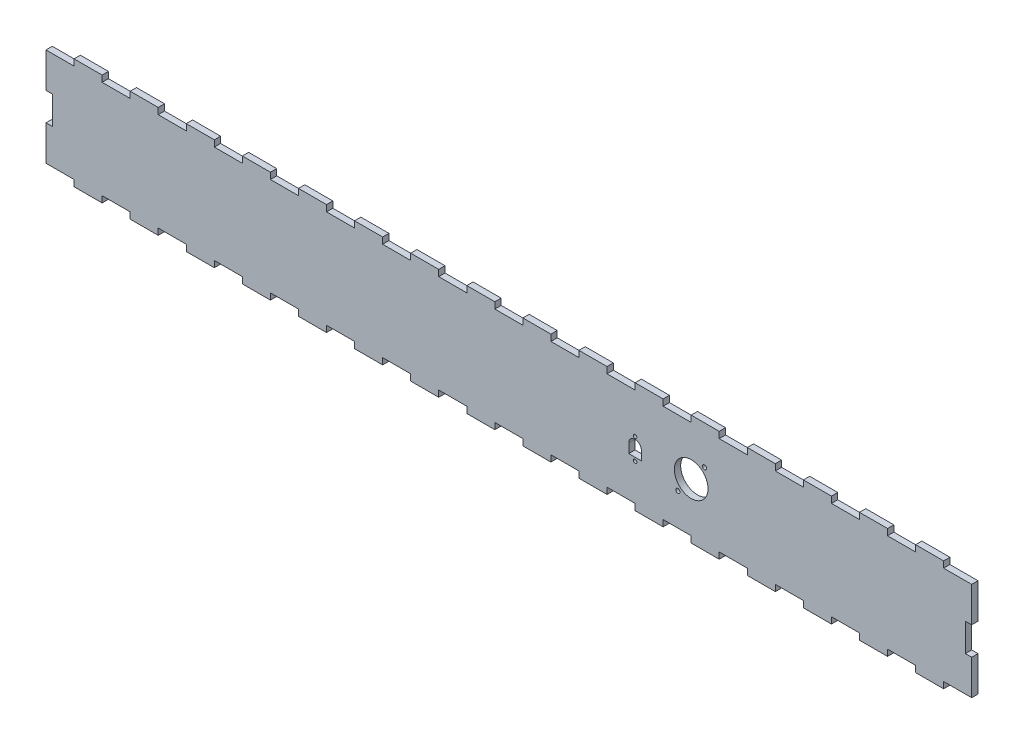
ISO-10303-21;
HEADER;
FILE_DESCRIPTION(('STEP AP214'),'2;1');
FILE_NAME('part.step','',(''),(''),'','','');
FILE_SCHEMA(('AUTOMOTIVE_DESIGN { 1 0 10303 214 1 1 1 1 }'));
ENDSEC;
DATA;
#1=APPLICATION_CONTEXT('core data for automotive mechanical design processes');
#2=APPLICATION_PROTOCOL_DEFINITION('international standard','automotive_design',2000,#1);
#3=PRODUCT_CONTEXT('',#1,'mechanical');
#4=PRODUCT('Part','Part','',(#3));
#5=PRODUCT_RELATED_PRODUCT_CATEGORY('part','',(#4));
#6=PRODUCT_DEFINITION_FORMATION('','',#4);
#7=PRODUCT_DEFINITION_CONTEXT('part definition',#1,'design');
#8=PRODUCT_DEFINITION('design','',#6,#7);
#9=PRODUCT_DEFINITION_SHAPE('','',#8);
#10=(LENGTH_UNIT() NAMED_UNIT(*) SI_UNIT(.MILLI.,.METRE.));
#11=(NAMED_UNIT(*) PLANE_ANGLE_UNIT() SI_UNIT($,.RADIAN.));
#12=(NAMED_UNIT(*) SI_UNIT($,.STERADIAN.) SOLID_ANGLE_UNIT());
#13=UNCERTAINTY_MEASURE_WITH_UNIT(LENGTH_MEASURE(1.E-05),#10,'distance_accuracy_value','');
#14=(GEOMETRIC_REPRESENTATION_CONTEXT(3) GLOBAL_UNCERTAINTY_ASSIGNED_CONTEXT((#13)) GLOBAL_UNIT_ASSIGNED_CONTEXT((#10,
#11,#12)) REPRESENTATION_CONTEXT('',''));
#15=CARTESIAN_POINT('',(0.,0.,0.));
#16=DIRECTION('',(0.,0.,1.));
#17=DIRECTION('',(1.,0.,0.));
#18=AXIS2_PLACEMENT_3D('',#15,#16,#17);
#19=CARTESIAN_POINT('',(603.642522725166,308.287944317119,672.570381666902));
#20=DIRECTION('',(-1.,0.,0.));
#21=DIRECTION('',(0.,0.,1.));
#22=AXIS2_PLACEMENT_3D('',#19,#20,#21);
#23=PLANE('',#22);
#24=DIRECTION('',(0.,1.,0.));
#25=VECTOR('',#24,1.);
#26=CARTESIAN_POINT('',(603.642522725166,308.287944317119,668.070381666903));
#27=LINE('',#26,#25);
#28=CARTESIAN_POINT('',(603.642522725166,308.287944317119,668.070381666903));
#29=VERTEX_POINT('',#28);
#30=CARTESIAN_POINT('',(603.642522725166,333.287944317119,668.070381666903));
#31=VERTEX_POINT('',#30);
#32=EDGE_CURVE('E925',#29,#31,#27,.T.);
#33=ORIENTED_EDGE('',*,*,#32,.T.);
#34=DIRECTION('',(0.,0.,1.));
#35=VECTOR('',#34,1.);
#36=CARTESIAN_POINT('',(603.642522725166,333.287944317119,668.070381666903));
#37=LINE('',#36,#35);
#38=CARTESIAN_POINT('',(603.642522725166,333.287944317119,672.570381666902));
#39=VERTEX_POINT('',#38);
#40=EDGE_CURVE('E2420',#31,#39,#37,.T.);
#41=ORIENTED_EDGE('',*,*,#40,.T.);
#42=DIRECTION('',(0.,1.,0.));
#43=VECTOR('',#42,1.);
#44=CARTESIAN_POINT('',(603.642522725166,308.287944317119,672.570381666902));
#45=LINE('',#44,#43);
#46=CARTESIAN_POINT('',(603.642522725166,308.287944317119,672.570381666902));
#47=VERTEX_POINT('',#46);
#48=EDGE_CURVE('E926',#47,#39,#45,.T.);
#49=ORIENTED_EDGE('',*,*,#48,.F.);
#50=DIRECTION('',(0.,0.,1.));
#51=VECTOR('',#50,1.);
#52=CARTESIAN_POINT('',(603.642522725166,308.287944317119,672.570381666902));
#53=LINE('',#52,#51);
#54=EDGE_CURVE('E1647',#29,#47,#53,.T.);
#55=ORIENTED_EDGE('',*,*,#54,.F.);
#56=EDGE_LOOP('',(#33,#41,#49,#55));
#57=FACE_BOUND('',#56,.T.);
#58=ADVANCED_FACE('F17',(#57),#23,.F.);
#59=CARTESIAN_POINT('',(-56.3574772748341,308.287944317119,672.570381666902));
#60=DIRECTION('',(1.,0.,0.));
#61=DIRECTION('',(0.,0.,-1.));
#62=AXIS2_PLACEMENT_3D('',#59,#60,#61);
#63=PLANE('',#62);
#64=DIRECTION('',(0.,1.,0.));
#65=VECTOR('',#64,1.);
#66=CARTESIAN_POINT('',(-56.3574772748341,308.287944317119,668.070381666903));
#67=LINE('',#66,#65);
#68=CARTESIAN_POINT('',(-56.3574772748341,353.287944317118,668.070381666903));
#69=VERTEX_POINT('',#68);
#70=CARTESIAN_POINT('',(-56.3574772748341,378.287944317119,668.070381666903));
#71=VERTEX_POINT('',#70);
#72=EDGE_CURVE('E27',#69,#71,#67,.T.);
#73=ORIENTED_EDGE('',*,*,#72,.F.);
#74=DIRECTION('',(0.,0.,1.));
#75=VECTOR('',#74,1.);
#76=CARTESIAN_POINT('',(-56.3574772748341,353.287944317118,668.070381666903));
#77=LINE('',#76,#75);
#78=CARTESIAN_POINT('',(-56.3574772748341,353.287944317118,672.570381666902));
#79=VERTEX_POINT('',#78);
#80=EDGE_CURVE('E1857',#69,#79,#77,.T.);
#81=ORIENTED_EDGE('',*,*,#80,.T.);
#82=DIRECTION('',(0.,1.,0.));
#83=VECTOR('',#82,1.);
#84=CARTESIAN_POINT('',(-56.3574772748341,308.287944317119,672.570381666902));
#85=LINE('',#84,#83);
#86=CARTESIAN_POINT('',(-56.3574772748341,378.287944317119,672.570381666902));
#87=VERTEX_POINT('',#86);
#88=EDGE_CURVE('E2401',#79,#87,#85,.T.);
#89=ORIENTED_EDGE('',*,*,#88,.T.);
#90=DIRECTION('',(0.,0.,-1.));
#91=VECTOR('',#90,1.);
#92=CARTESIAN_POINT('',(-56.3574772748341,378.287944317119,672.570381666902));
#93=LINE('',#92,#91);
#94=EDGE_CURVE('E1007',#87,#71,#93,.T.);
#95=ORIENTED_EDGE('',*,*,#94,.T.);
#96=EDGE_LOOP('',(#73,#81,#89,#95));
#97=FACE_BOUND('',#96,.T.);
#98=ADVANCED_FACE('F2229',(#97),#63,.F.);
#99=CARTESIAN_POINT('',(0.,308.287944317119,0.));
#100=DIRECTION('',(0.,-1.,0.));
#101=DIRECTION('',(0.,0.,-1.));
#102=AXIS2_PLACEMENT_3D('',#99,#100,#101);
#103=PLANE('',#102);
#104=DIRECTION('',(0.,0.,1.));
#105=VECTOR('',#104,1.);
#106=CARTESIAN_POINT('',(-36.3574772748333,308.287944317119,668.070381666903));
#107=LINE('',#106,#105);
#108=CARTESIAN_POINT('',(-36.3574772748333,308.287944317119,668.070381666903));
#109=VERTEX_POINT('',#108);
#110=CARTESIAN_POINT('',(-36.3574772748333,308.287944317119,672.570381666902));
#111=VERTEX_POINT('',#110);
#112=EDGE_CURVE('E1864',#109,#111,#107,.T.);
#113=ORIENTED_EDGE('',*,*,#112,.T.);
#114=DIRECTION('',(-1.,0.,0.));
#115=VECTOR('',#114,1.);
#116=CARTESIAN_POINT('',(-56.3574772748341,308.287944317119,672.570381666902));
#117=LINE('',#116,#115);
#118=CARTESIAN_POINT('',(-56.3574772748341,308.287944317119,672.570381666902));
#119=VERTEX_POINT('',#118);
#120=EDGE_CURVE('E1707',#111,#119,#117,.T.);
#121=ORIENTED_EDGE('',*,*,#120,.T.);
#122=DIRECTION('',(0.,0.,-1.));
#123=VECTOR('',#122,1.);
#124=CARTESIAN_POINT('',(-56.3574772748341,308.287944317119,672.570381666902));
#125=LINE('',#124,#123);
#126=CARTESIAN_POINT('',(-56.3574772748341,308.287944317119,668.070381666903));
#127=VERTEX_POINT('',#126);
#128=EDGE_CURVE('E937',#119,#127,#125,.T.);
#129=ORIENTED_EDGE('',*,*,#128,.T.);
#130=DIRECTION('',(1.,0.,0.));
#131=VECTOR('',#130,1.);
#132=CARTESIAN_POINT('',(-56.3574772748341,308.287944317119,668.070381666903));
#133=LINE('',#132,#131);
#134=EDGE_CURVE('E1654',#127,#109,#133,.T.);
#135=ORIENTED_EDGE('',*,*,#134,.T.);
#136=EDGE_LOOP('',(#113,#121,#129,#135));
#137=FACE_BOUND('',#136,.T.);
#138=ADVANCED_FACE('F2236',(#137),#103,.T.);
#139=DIRECTION('',(0.,0.,1.));
#140=VECTOR('',#139,1.);
#141=CARTESIAN_POINT('',(563.642522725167,308.287944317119,668.070381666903));
#142=LINE('',#141,#140);
#143=CARTESIAN_POINT('',(563.642522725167,308.287944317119,668.070381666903));
#144=VERTEX_POINT('',#143);
#145=CARTESIAN_POINT('',(563.642522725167,308.287944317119,672.570381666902));
#146=VERTEX_POINT('',#145);
#147=EDGE_CURVE('E1892',#144,#146,#142,.T.);
#148=ORIENTED_EDGE('',*,*,#147,.T.);
#149=CARTESIAN_POINT('',(543.642522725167,308.287944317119,672.570381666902));
#150=VERTEX_POINT('',#149);
#151=EDGE_CURVE('E1705',#146,#150,#117,.T.);
#152=ORIENTED_EDGE('',*,*,#151,.T.);
#153=DIRECTION('',(0.,0.,1.));
#154=VECTOR('',#153,1.);
#155=CARTESIAN_POINT('',(543.642522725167,308.287944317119,668.070381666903));
#156=LINE('',#155,#154);
#157=CARTESIAN_POINT('',(543.642522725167,308.287944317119,668.070381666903));
#158=VERTEX_POINT('',#157);
#159=EDGE_CURVE('E1923',#158,#150,#156,.T.);
#160=ORIENTED_EDGE('',*,*,#159,.F.);
#161=EDGE_CURVE('E1699',#158,#144,#133,.T.);
#162=ORIENTED_EDGE('',*,*,#161,.T.);
#163=EDGE_LOOP('',(#148,#152,#160,#162));
#164=FACE_BOUND('',#163,.T.);
#165=ADVANCED_FACE('F2469',(#164),#103,.T.);
#166=DIRECTION('',(0.,0.,1.));
#167=VECTOR('',#166,1.);
#168=CARTESIAN_POINT('',(523.642522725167,308.287944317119,668.070381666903));
#169=LINE('',#168,#167);
#170=CARTESIAN_POINT('',(523.642522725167,308.287944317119,668.070381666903));
#171=VERTEX_POINT('',#170);
#172=CARTESIAN_POINT('',(523.642522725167,308.287944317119,672.570381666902));
#173=VERTEX_POINT('',#172);
#174=EDGE_CURVE('E1920',#171,#173,#169,.T.);
#175=ORIENTED_EDGE('',*,*,#174,.T.);
#176=CARTESIAN_POINT('',(503.642522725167,308.287944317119,672.570381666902));
#177=VERTEX_POINT('',#176);
#178=EDGE_CURVE('E1704',#173,#177,#117,.T.);
#179=ORIENTED_EDGE('',*,*,#178,.T.);
#180=DIRECTION('',(0.,0.,1.));
#181=VECTOR('',#180,1.);
#182=CARTESIAN_POINT('',(503.642522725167,308.287944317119,668.070381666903));
#183=LINE('',#182,#181);
#184=CARTESIAN_POINT('',(503.642522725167,308.287944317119,668.070381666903));
#185=VERTEX_POINT('',#184);
#186=EDGE_CURVE('E1950',#185,#177,#183,.T.);
#187=ORIENTED_EDGE('',*,*,#186,.F.);
#188=EDGE_CURVE('E1696',#185,#171,#133,.T.);
#189=ORIENTED_EDGE('',*,*,#188,.T.);
#190=EDGE_LOOP('',(#175,#179,#187,#189));
#191=FACE_BOUND('',#190,.T.);
#192=ADVANCED_FACE('F2474',(#191),#103,.T.);
#193=DIRECTION('',(0.,0.,1.));
#194=VECTOR('',#193,1.);
#195=CARTESIAN_POINT('',(483.642522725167,308.287944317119,668.070381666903));
#196=LINE('',#195,#194);
#197=CARTESIAN_POINT('',(483.642522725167,308.287944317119,668.070381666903));
#198=VERTEX_POINT('',#197);
#199=CARTESIAN_POINT('',(483.642522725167,308.287944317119,672.570381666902));
#200=VERTEX_POINT('',#199);
#201=EDGE_CURVE('E1948',#198,#200,#196,.T.);
#202=ORIENTED_EDGE('',*,*,#201,.T.);
#203=CARTESIAN_POINT('',(463.642522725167,308.287944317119,672.570381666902));
#204=VERTEX_POINT('',#203);
#205=EDGE_CURVE('E1738',#200,#204,#117,.T.);
#206=ORIENTED_EDGE('',*,*,#205,.T.);
#207=DIRECTION('',(0.,0.,1.));
#208=VECTOR('',#207,1.);
#209=CARTESIAN_POINT('',(463.642522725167,308.287944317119,668.070381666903));
#210=LINE('',#209,#208);
#211=CARTESIAN_POINT('',(463.642522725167,308.287944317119,668.070381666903));
#212=VERTEX_POINT('',#211);
#213=EDGE_CURVE('E1977',#212,#204,#210,.T.);
#214=ORIENTED_EDGE('',*,*,#213,.F.);
#215=EDGE_CURVE('E1692',#212,#198,#133,.T.);
#216=ORIENTED_EDGE('',*,*,#215,.T.);
#217=EDGE_LOOP('',(#202,#206,#214,#216));
#218=FACE_BOUND('',#217,.T.);
#219=ADVANCED_FACE('F2480',(#218),#103,.T.);
#220=DIRECTION('',(0.,0.,1.));
#221=VECTOR('',#220,1.);
#222=CARTESIAN_POINT('',(443.642522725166,308.287944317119,668.070381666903));
#223=LINE('',#222,#221);
#224=CARTESIAN_POINT('',(443.642522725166,308.287944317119,668.070381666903));
#225=VERTEX_POINT('',#224);
#226=CARTESIAN_POINT('',(443.642522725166,308.287944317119,672.570381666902));
#227=VERTEX_POINT('',#226);
#228=EDGE_CURVE('E1975',#225,#227,#223,.T.);
#229=ORIENTED_EDGE('',*,*,#228,.T.);
#230=CARTESIAN_POINT('',(423.642522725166,308.287944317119,672.570381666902));
#231=VERTEX_POINT('',#230);
#232=EDGE_CURVE('E1736',#227,#231,#117,.T.);
#233=ORIENTED_EDGE('',*,*,#232,.T.);
#234=DIRECTION('',(0.,0.,1.));
#235=VECTOR('',#234,1.);
#236=CARTESIAN_POINT('',(423.642522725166,308.287944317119,668.070381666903));
#237=LINE('',#236,#235);
#238=CARTESIAN_POINT('',(423.642522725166,308.287944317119,668.070381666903));
#239=VERTEX_POINT('',#238);
#240=EDGE_CURVE('E2003',#239,#231,#237,.T.);
#241=ORIENTED_EDGE('',*,*,#240,.F.);
#242=EDGE_CURVE('E1688',#239,#225,#133,.T.);
#243=ORIENTED_EDGE('',*,*,#242,.T.);
#244=EDGE_LOOP('',(#229,#233,#241,#243));
#245=FACE_BOUND('',#244,.T.);
#246=ADVANCED_FACE('F2656',(#245),#103,.T.);
#247=DIRECTION('',(0.,0.,1.));
#248=VECTOR('',#247,1.);
#249=CARTESIAN_POINT('',(403.642522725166,308.287944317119,668.070381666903));
#250=LINE('',#249,#248);
#251=CARTESIAN_POINT('',(403.642522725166,308.287944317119,668.070381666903));
#252=VERTEX_POINT('',#251);
#253=CARTESIAN_POINT('',(403.642522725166,308.287944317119,672.570381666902));
#254=VERTEX_POINT('',#253);
#255=EDGE_CURVE('E2001',#252,#254,#250,.T.);
#256=ORIENTED_EDGE('',*,*,#255,.T.);
#257=CARTESIAN_POINT('',(383.642522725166,308.287944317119,672.570381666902));
#258=VERTEX_POINT('',#257);
#259=EDGE_CURVE('E1734',#254,#258,#117,.T.);
#260=ORIENTED_EDGE('',*,*,#259,.T.);
#261=DIRECTION('',(0.,0.,1.));
#262=VECTOR('',#261,1.);
#263=CARTESIAN_POINT('',(383.642522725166,308.287944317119,668.070381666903));
#264=LINE('',#263,#262);
#265=CARTESIAN_POINT('',(383.642522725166,308.287944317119,668.070381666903));
#266=VERTEX_POINT('',#265);
#267=EDGE_CURVE('E2029',#266,#258,#264,.T.);
#268=ORIENTED_EDGE('',*,*,#267,.F.);
#269=EDGE_CURVE('E1684',#266,#252,#133,.T.);
#270=ORIENTED_EDGE('',*,*,#269,.T.);
#271=EDGE_LOOP('',(#256,#260,#268,#270));
#272=FACE_BOUND('',#271,.T.);
#273=ADVANCED_FACE('F2643',(#272),#103,.T.);
#274=DIRECTION('',(0.,0.,1.));
#275=VECTOR('',#274,1.);
#276=CARTESIAN_POINT('',(363.642522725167,308.287944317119,668.070381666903));
#277=LINE('',#276,#275);
#278=CARTESIAN_POINT('',(363.642522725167,308.287944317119,668.070381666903));
#279=VERTEX_POINT('',#278);
#280=CARTESIAN_POINT('',(363.642522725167,308.287944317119,672.570381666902));
#281=VERTEX_POINT('',#280);
#282=EDGE_CURVE('E2027',#279,#281,#277,.T.);
#283=ORIENTED_EDGE('',*,*,#282,.T.);
#284=CARTESIAN_POINT('',(343.642522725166,308.287944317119,672.570381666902));
#285=VERTEX_POINT('',#284);
#286=EDGE_CURVE('E1732',#281,#285,#117,.T.);
#287=ORIENTED_EDGE('',*,*,#286,.T.);
#288=DIRECTION('',(0.,0.,1.));
#289=VECTOR('',#288,1.);
#290=CARTESIAN_POINT('',(343.642522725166,308.287944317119,668.070381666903));
#291=LINE('',#290,#289);
#292=CARTESIAN_POINT('',(343.642522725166,308.287944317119,668.070381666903));
#293=VERTEX_POINT('',#292);
#294=EDGE_CURVE('E2055',#293,#285,#291,.T.);
#295=ORIENTED_EDGE('',*,*,#294,.F.);
#296=EDGE_CURVE('E1680',#293,#279,#133,.T.);
#297=ORIENTED_EDGE('',*,*,#296,.T.);
#298=EDGE_LOOP('',(#283,#287,#295,#297));
#299=FACE_BOUND('',#298,.T.);
#300=ADVANCED_FACE('F2630',(#299),#103,.T.);
#301=DIRECTION('',(0.,0.,1.));
#302=VECTOR('',#301,1.);
#303=CARTESIAN_POINT('',(323.642522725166,308.287944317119,668.070381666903));
#304=LINE('',#303,#302);
#305=CARTESIAN_POINT('',(323.642522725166,308.287944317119,668.070381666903));
#306=VERTEX_POINT('',#305);
#307=CARTESIAN_POINT('',(323.642522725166,308.287944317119,672.570381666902));
#308=VERTEX_POINT('',#307);
#309=EDGE_CURVE('E2053',#306,#308,#304,.T.);
#310=ORIENTED_EDGE('',*,*,#309,.T.);
#311=CARTESIAN_POINT('',(303.642522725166,308.287944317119,672.570381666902));
#312=VERTEX_POINT('',#311);
#313=EDGE_CURVE('E1730',#308,#312,#117,.T.);
#314=ORIENTED_EDGE('',*,*,#313,.T.);
#315=DIRECTION('',(0.,0.,1.));
#316=VECTOR('',#315,1.);
#317=CARTESIAN_POINT('',(303.642522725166,308.287944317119,668.070381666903));
#318=LINE('',#317,#316);
#319=CARTESIAN_POINT('',(303.642522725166,308.287944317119,668.070381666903));
#320=VERTEX_POINT('',#319);
#321=EDGE_CURVE('E2081',#320,#312,#318,.T.);
#322=ORIENTED_EDGE('',*,*,#321,.F.);
#323=EDGE_CURVE('E1676',#320,#306,#133,.T.);
#324=ORIENTED_EDGE('',*,*,#323,.T.);
#325=EDGE_LOOP('',(#310,#314,#322,#324));
#326=FACE_BOUND('',#325,.T.);
#327=ADVANCED_FACE('F2617',(#326),#103,.T.);
#328=DIRECTION('',(0.,0.,1.));
#329=VECTOR('',#328,1.);
#330=CARTESIAN_POINT('',(283.642522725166,308.287944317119,668.070381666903));
#331=LINE('',#330,#329);
#332=CARTESIAN_POINT('',(283.642522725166,308.287944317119,668.070381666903));
#333=VERTEX_POINT('',#332);
#334=CARTESIAN_POINT('',(283.642522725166,308.287944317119,672.570381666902));
#335=VERTEX_POINT('',#334);
#336=EDGE_CURVE('E2079',#333,#335,#331,.T.);
#337=ORIENTED_EDGE('',*,*,#336,.T.);
#338=CARTESIAN_POINT('',(263.642522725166,308.287944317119,672.570381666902));
#339=VERTEX_POINT('',#338);
#340=EDGE_CURVE('E1728',#335,#339,#117,.T.);
#341=ORIENTED_EDGE('',*,*,#340,.T.);
#342=DIRECTION('',(0.,0.,1.));
#343=VECTOR('',#342,1.);
#344=CARTESIAN_POINT('',(263.642522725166,308.287944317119,668.070381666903));
#345=LINE('',#344,#343);
#346=CARTESIAN_POINT('',(263.642522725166,308.287944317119,668.070381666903));
#347=VERTEX_POINT('',#346);
#348=EDGE_CURVE('E2107',#347,#339,#345,.T.);
#349=ORIENTED_EDGE('',*,*,#348,.F.);
#350=EDGE_CURVE('E1672',#347,#333,#133,.T.);
#351=ORIENTED_EDGE('',*,*,#350,.T.);
#352=EDGE_LOOP('',(#337,#341,#349,#351));
#353=FACE_BOUND('',#352,.T.);
#354=ADVANCED_FACE('F2604',(#353),#103,.T.);
#355=DIRECTION('',(0.,0.,1.));
#356=VECTOR('',#355,1.);
#357=CARTESIAN_POINT('',(243.642522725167,308.287944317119,668.070381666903));
#358=LINE('',#357,#356);
#359=CARTESIAN_POINT('',(243.642522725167,308.287944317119,668.070381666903));
#360=VERTEX_POINT('',#359);
#361=CARTESIAN_POINT('',(243.642522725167,308.287944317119,672.570381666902));
#362=VERTEX_POINT('',#361);
#363=EDGE_CURVE('E2105',#360,#362,#358,.T.);
#364=ORIENTED_EDGE('',*,*,#363,.T.);
#365=CARTESIAN_POINT('',(223.642522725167,308.287944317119,672.570381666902));
#366=VERTEX_POINT('',#365);
#367=EDGE_CURVE('E1726',#362,#366,#117,.T.);
#368=ORIENTED_EDGE('',*,*,#367,.T.);
#369=DIRECTION('',(0.,0.,1.));
#370=VECTOR('',#369,1.);
#371=CARTESIAN_POINT('',(223.642522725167,308.287944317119,668.070381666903));
#372=LINE('',#371,#370);
#373=CARTESIAN_POINT('',(223.642522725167,308.287944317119,668.070381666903));
#374=VERTEX_POINT('',#373);
#375=EDGE_CURVE('E2133',#374,#366,#372,.T.);
#376=ORIENTED_EDGE('',*,*,#375,.F.);
#377=EDGE_CURVE('E1668',#374,#360,#133,.T.);
#378=ORIENTED_EDGE('',*,*,#377,.T.);
#379=EDGE_LOOP('',(#364,#368,#376,#378));
#380=FACE_BOUND('',#379,.T.);
#381=ADVANCED_FACE('F2565',(#380),#103,.T.);
#382=DIRECTION('',(0.,0.,1.));
#383=VECTOR('',#382,1.);
#384=CARTESIAN_POINT('',(203.642522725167,308.287944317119,668.070381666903));
#385=LINE('',#384,#383);
#386=CARTESIAN_POINT('',(203.642522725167,308.287944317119,668.070381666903));
#387=VERTEX_POINT('',#386);
#388=CARTESIAN_POINT('',(203.642522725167,308.287944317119,672.570381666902));
#389=VERTEX_POINT('',#388);
#390=EDGE_CURVE('E2131',#387,#389,#385,.T.);
#391=ORIENTED_EDGE('',*,*,#390,.T.);
#392=CARTESIAN_POINT('',(183.642522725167,308.287944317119,672.570381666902));
#393=VERTEX_POINT('',#392);
#394=EDGE_CURVE('E1724',#389,#393,#117,.T.);
#395=ORIENTED_EDGE('',*,*,#394,.T.);
#396=DIRECTION('',(0.,0.,1.));
#397=VECTOR('',#396,1.);
#398=CARTESIAN_POINT('',(183.642522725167,308.287944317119,668.070381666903));
#399=LINE('',#398,#397);
#400=CARTESIAN_POINT('',(183.642522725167,308.287944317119,668.070381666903));
#401=VERTEX_POINT('',#400);
#402=EDGE_CURVE('E2159',#401,#393,#399,.T.);
#403=ORIENTED_EDGE('',*,*,#402,.F.);
#404=EDGE_CURVE('E1664',#401,#387,#133,.T.);
#405=ORIENTED_EDGE('',*,*,#404,.T.);
#406=EDGE_LOOP('',(#391,#395,#403,#405));
#407=FACE_BOUND('',#406,.T.);
#408=ADVANCED_FACE('F2560',(#407),#103,.T.);
#409=DIRECTION('',(0.,0.,1.));
#410=VECTOR('',#409,1.);
#411=CARTESIAN_POINT('',(163.642522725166,308.287944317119,668.070381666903));
#412=LINE('',#411,#410);
#413=CARTESIAN_POINT('',(163.642522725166,308.287944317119,668.070381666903));
#414=VERTEX_POINT('',#413);
#415=CARTESIAN_POINT('',(163.642522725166,308.287944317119,672.570381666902));
#416=VERTEX_POINT('',#415);
#417=EDGE_CURVE('E2157',#414,#416,#412,.T.);
#418=ORIENTED_EDGE('',*,*,#417,.T.);
#419=CARTESIAN_POINT('',(143.642522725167,308.287944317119,672.570381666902));
#420=VERTEX_POINT('',#419);
#421=EDGE_CURVE('E1722',#416,#420,#117,.T.);
#422=ORIENTED_EDGE('',*,*,#421,.T.);
#423=DIRECTION('',(0.,0.,1.));
#424=VECTOR('',#423,1.);
#425=CARTESIAN_POINT('',(143.642522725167,308.287944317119,668.070381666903));
#426=LINE('',#425,#424);
#427=CARTESIAN_POINT('',(143.642522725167,308.287944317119,668.070381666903));
#428=VERTEX_POINT('',#427);
#429=EDGE_CURVE('E2185',#428,#420,#426,.T.);
#430=ORIENTED_EDGE('',*,*,#429,.F.);
#431=EDGE_CURVE('E1660',#428,#414,#133,.T.);
#432=ORIENTED_EDGE('',*,*,#431,.T.);
#433=EDGE_LOOP('',(#418,#422,#430,#432));
#434=FACE_BOUND('',#433,.T.);
#435=ADVANCED_FACE('F2555',(#434),#103,.T.);
#436=DIRECTION('',(0.,0.,1.));
#437=VECTOR('',#436,1.);
#438=CARTESIAN_POINT('',(123.642522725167,308.287944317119,668.070381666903));
#439=LINE('',#438,#437);
#440=CARTESIAN_POINT('',(123.642522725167,308.287944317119,668.070381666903));
#441=VERTEX_POINT('',#440);
#442=CARTESIAN_POINT('',(123.642522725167,308.287944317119,672.570381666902));
#443=VERTEX_POINT('',#442);
#444=EDGE_CURVE('E2183',#441,#443,#439,.T.);
#445=ORIENTED_EDGE('',*,*,#444,.T.);
#446=CARTESIAN_POINT('',(103.642522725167,308.287944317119,672.570381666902));
#447=VERTEX_POINT('',#446);
#448=EDGE_CURVE('E1720',#443,#447,#117,.T.);
#449=ORIENTED_EDGE('',*,*,#448,.T.);
#450=DIRECTION('',(0.,0.,1.));
#451=VECTOR('',#450,1.);
#452=CARTESIAN_POINT('',(103.642522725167,308.287944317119,668.070381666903));
#453=LINE('',#452,#451);
#454=CARTESIAN_POINT('',(103.642522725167,308.287944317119,668.070381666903));
#455=VERTEX_POINT('',#454);
#456=EDGE_CURVE('E2209',#455,#447,#453,.T.);
#457=ORIENTED_EDGE('',*,*,#456,.F.);
#458=EDGE_CURVE('E1640',#455,#441,#133,.T.);
#459=ORIENTED_EDGE('',*,*,#458,.T.);
#460=EDGE_LOOP('',(#445,#449,#457,#459));
#461=FACE_BOUND('',#460,.T.);
#462=ADVANCED_FACE('F2521',(#461),#103,.T.);
#463=DIRECTION('',(0.,0.,1.));
#464=VECTOR('',#463,1.);
#465=CARTESIAN_POINT('',(83.6425227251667,308.287944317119,668.070381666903));
#466=LINE('',#465,#464);
#467=CARTESIAN_POINT('',(83.6425227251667,308.287944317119,668.070381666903));
#468=VERTEX_POINT('',#467);
#469=CARTESIAN_POINT('',(83.6425227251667,308.287944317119,672.570381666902));
#470=VERTEX_POINT('',#469);
#471=EDGE_CURVE('E2207',#468,#470,#466,.T.);
#472=ORIENTED_EDGE('',*,*,#471,.T.);
#473=CARTESIAN_POINT('',(63.6425227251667,308.287944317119,672.570381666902));
#474=VERTEX_POINT('',#473);
#475=EDGE_CURVE('E1718',#470,#474,#117,.T.);
#476=ORIENTED_EDGE('',*,*,#475,.T.);
#477=DIRECTION('',(0.,0.,1.));
#478=VECTOR('',#477,1.);
#479=CARTESIAN_POINT('',(63.6425227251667,308.287944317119,668.070381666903));
#480=LINE('',#479,#478);
#481=CARTESIAN_POINT('',(63.6425227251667,308.287944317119,668.070381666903));
#482=VERTEX_POINT('',#481);
#483=EDGE_CURVE('E1803',#482,#474,#480,.T.);
#484=ORIENTED_EDGE('',*,*,#483,.F.);
#485=EDGE_CURVE('E1637',#482,#468,#133,.T.);
#486=ORIENTED_EDGE('',*,*,#485,.T.);
#487=EDGE_LOOP('',(#472,#476,#484,#486));
#488=FACE_BOUND('',#487,.T.);
#489=ADVANCED_FACE('F2548',(#488),#103,.T.);
#490=DIRECTION('',(0.,0.,1.));
#491=VECTOR('',#490,1.);
#492=CARTESIAN_POINT('',(43.6425227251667,308.287944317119,668.070381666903));
#493=LINE('',#492,#491);
#494=CARTESIAN_POINT('',(43.6425227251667,308.287944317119,668.070381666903));
#495=VERTEX_POINT('',#494);
#496=CARTESIAN_POINT('',(43.6425227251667,308.287944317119,672.570381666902));
#497=VERTEX_POINT('',#496);
#498=EDGE_CURVE('E1792',#495,#497,#493,.T.);
#499=ORIENTED_EDGE('',*,*,#498,.T.);
#500=CARTESIAN_POINT('',(23.6425227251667,308.287944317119,672.570381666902));
#501=VERTEX_POINT('',#500);
#502=EDGE_CURVE('E1641',#497,#501,#117,.T.);
#503=ORIENTED_EDGE('',*,*,#502,.T.);
#504=DIRECTION('',(0.,0.,1.));
#505=VECTOR('',#504,1.);
#506=CARTESIAN_POINT('',(23.6425227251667,308.287944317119,668.070381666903));
#507=LINE('',#506,#505);
#508=CARTESIAN_POINT('',(23.6425227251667,308.287944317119,668.070381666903));
#509=VERTEX_POINT('',#508);
#510=EDGE_CURVE('E1612',#509,#501,#507,.T.);
#511=ORIENTED_EDGE('',*,*,#510,.F.);
#512=EDGE_CURVE('E1639',#509,#495,#133,.T.);
#513=ORIENTED_EDGE('',*,*,#512,.T.);
#514=EDGE_LOOP('',(#499,#503,#511,#513));
#515=FACE_BOUND('',#514,.T.);
#516=ADVANCED_FACE('F1791',(#515),#103,.T.);
#517=DIRECTION('',(0.,0.,1.));
#518=VECTOR('',#517,1.);
#519=CARTESIAN_POINT('',(-16.3574772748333,308.287944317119,668.070381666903));
#520=LINE('',#519,#518);
#521=CARTESIAN_POINT('',(-16.3574772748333,308.287944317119,668.070381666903));
#522=VERTEX_POINT('',#521);
#523=CARTESIAN_POINT('',(-16.3574772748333,308.287944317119,672.570381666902));
#524=VERTEX_POINT('',#523);
#525=EDGE_CURVE('E1866',#522,#524,#520,.T.);
#526=ORIENTED_EDGE('',*,*,#525,.F.);
#527=CARTESIAN_POINT('',(3.64252272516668,308.287944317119,668.070381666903));
#528=VERTEX_POINT('',#527);
#529=EDGE_CURVE('E21',#522,#528,#133,.T.);
#530=ORIENTED_EDGE('',*,*,#529,.T.);
#531=DIRECTION('',(0.,0.,1.));
#532=VECTOR('',#531,1.);
#533=CARTESIAN_POINT('',(3.64252272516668,308.287944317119,668.070381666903));
#534=LINE('',#533,#532);
#535=CARTESIAN_POINT('',(3.64252272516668,308.287944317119,672.570381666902));
#536=VERTEX_POINT('',#535);
#537=EDGE_CURVE('E1622',#528,#536,#534,.T.);
#538=ORIENTED_EDGE('',*,*,#537,.T.);
#539=EDGE_CURVE('E1712',#536,#524,#117,.T.);
#540=ORIENTED_EDGE('',*,*,#539,.T.);
#541=EDGE_LOOP('',(#526,#530,#538,#540));
#542=FACE_BOUND('',#541,.T.);
#543=ADVANCED_FACE('F2377',(#542),#103,.T.);
#544=CARTESIAN_POINT('',(0.,378.287944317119,0.));
#545=DIRECTION('',(0.,-1.,0.));
#546=DIRECTION('',(0.,0.,-1.));
#547=AXIS2_PLACEMENT_3D('',#544,#545,#546);
#548=PLANE('',#547);
#549=DIRECTION('',(-1.,0.,0.));
#550=VECTOR('',#549,1.);
#551=CARTESIAN_POINT('',(-56.3574772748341,378.287944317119,672.570381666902));
#552=LINE('',#551,#550);
#553=CARTESIAN_POINT('',(563.642522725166,378.287944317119,672.570381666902));
#554=VERTEX_POINT('',#553);
#555=CARTESIAN_POINT('',(543.642522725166,378.287944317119,672.570381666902));
#556=VERTEX_POINT('',#555);
#557=EDGE_CURVE('E938',#554,#556,#552,.T.);
#558=ORIENTED_EDGE('',*,*,#557,.F.);
#559=DIRECTION('',(0.,0.,1.));
#560=VECTOR('',#559,1.);
#561=CARTESIAN_POINT('',(563.642522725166,378.287944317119,668.070381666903));
#562=LINE('',#561,#560);
#563=CARTESIAN_POINT('',(563.642522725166,378.287944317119,668.070381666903));
#564=VERTEX_POINT('',#563);
#565=EDGE_CURVE('E1067',#564,#554,#562,.T.);
#566=ORIENTED_EDGE('',*,*,#565,.F.);
#567=DIRECTION('',(1.,0.,0.));
#568=VECTOR('',#567,1.);
#569=CARTESIAN_POINT('',(-56.3574772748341,378.287944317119,668.070381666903));
#570=LINE('',#569,#568);
#571=CARTESIAN_POINT('',(543.642522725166,378.287944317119,668.070381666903));
#572=VERTEX_POINT('',#571);
#573=EDGE_CURVE('E1006',#572,#564,#570,.T.);
#574=ORIENTED_EDGE('',*,*,#573,.F.);
#575=DIRECTION('',(0.,0.,1.));
#576=VECTOR('',#575,1.);
#577=CARTESIAN_POINT('',(543.642522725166,378.287944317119,668.070381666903));
#578=LINE('',#577,#576);
#579=EDGE_CURVE('E1065',#572,#556,#578,.T.);
#580=ORIENTED_EDGE('',*,*,#579,.T.);
#581=EDGE_LOOP('',(#558,#566,#574,#580));
#582=FACE_BOUND('',#581,.T.);
#583=ADVANCED_FACE('F1064',(#582),#548,.F.);
#584=CARTESIAN_POINT('',(523.642522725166,378.287944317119,672.570381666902));
#585=VERTEX_POINT('',#584);
#586=CARTESIAN_POINT('',(503.642522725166,378.287944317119,672.570381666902));
#587=VERTEX_POINT('',#586);
#588=EDGE_CURVE('E1004',#585,#587,#552,.T.);
#589=ORIENTED_EDGE('',*,*,#588,.F.);
#590=DIRECTION('',(0.,0.,1.));
#591=VECTOR('',#590,1.);
#592=CARTESIAN_POINT('',(523.642522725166,378.287944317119,668.070381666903));
#593=LINE('',#592,#591);
#594=CARTESIAN_POINT('',(523.642522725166,378.287944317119,668.070381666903));
#595=VERTEX_POINT('',#594);
#596=EDGE_CURVE('E1096',#595,#585,#593,.T.);
#597=ORIENTED_EDGE('',*,*,#596,.F.);
#598=CARTESIAN_POINT('',(503.642522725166,378.287944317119,668.070381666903));
#599=VERTEX_POINT('',#598);
#600=EDGE_CURVE('E1045',#599,#595,#570,.T.);
#601=ORIENTED_EDGE('',*,*,#600,.F.);
#602=DIRECTION('',(0.,0.,1.));
#603=VECTOR('',#602,1.);
#604=CARTESIAN_POINT('',(503.642522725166,378.287944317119,668.070381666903));
#605=LINE('',#604,#603);
#606=EDGE_CURVE('E1114',#599,#587,#605,.T.);
#607=ORIENTED_EDGE('',*,*,#606,.T.);
#608=EDGE_LOOP('',(#589,#597,#601,#607));
#609=FACE_BOUND('',#608,.T.);
#610=ADVANCED_FACE('F1586',(#609),#548,.F.);
#611=CARTESIAN_POINT('',(483.642522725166,378.287944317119,672.570381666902));
#612=VERTEX_POINT('',#611);
#613=CARTESIAN_POINT('',(463.642522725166,378.287944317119,672.570381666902));
#614=VERTEX_POINT('',#613);
#615=EDGE_CURVE('E1001',#612,#614,#552,.T.);
#616=ORIENTED_EDGE('',*,*,#615,.F.);
#617=DIRECTION('',(0.,0.,1.));
#618=VECTOR('',#617,1.);
#619=CARTESIAN_POINT('',(483.642522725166,378.287944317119,668.070381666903));
#620=LINE('',#619,#618);
#621=CARTESIAN_POINT('',(483.642522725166,378.287944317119,668.070381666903));
#622=VERTEX_POINT('',#621);
#623=EDGE_CURVE('E1121',#622,#612,#620,.T.);
#624=ORIENTED_EDGE('',*,*,#623,.F.);
#625=CARTESIAN_POINT('',(463.642522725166,378.287944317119,668.070381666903));
#626=VERTEX_POINT('',#625);
#627=EDGE_CURVE('E1044',#626,#622,#570,.T.);
#628=ORIENTED_EDGE('',*,*,#627,.F.);
#629=DIRECTION('',(0.,0.,1.));
#630=VECTOR('',#629,1.);
#631=CARTESIAN_POINT('',(463.642522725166,378.287944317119,668.070381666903));
#632=LINE('',#631,#630);
#633=EDGE_CURVE('E1140',#626,#614,#632,.T.);
#634=ORIENTED_EDGE('',*,*,#633,.T.);
#635=EDGE_LOOP('',(#616,#624,#628,#634));
#636=FACE_BOUND('',#635,.T.);
#637=ADVANCED_FACE('F1570',(#636),#548,.F.);
#638=CARTESIAN_POINT('',(443.642522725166,378.287944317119,672.570381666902));
#639=VERTEX_POINT('',#638);
#640=CARTESIAN_POINT('',(423.642522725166,378.287944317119,672.570381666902));
#641=VERTEX_POINT('',#640);
#642=EDGE_CURVE('E998',#639,#641,#552,.T.);
#643=ORIENTED_EDGE('',*,*,#642,.F.);
#644=DIRECTION('',(0.,0.,1.));
#645=VECTOR('',#644,1.);
#646=CARTESIAN_POINT('',(443.642522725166,378.287944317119,668.070381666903));
#647=LINE('',#646,#645);
#648=CARTESIAN_POINT('',(443.642522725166,378.287944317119,668.070381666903));
#649=VERTEX_POINT('',#648);
#650=EDGE_CURVE('E1147',#649,#639,#647,.T.);
#651=ORIENTED_EDGE('',*,*,#650,.F.);
#652=CARTESIAN_POINT('',(423.642522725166,378.287944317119,668.070381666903));
#653=VERTEX_POINT('',#652);
#654=EDGE_CURVE('E1042',#653,#649,#570,.T.);
#655=ORIENTED_EDGE('',*,*,#654,.F.);
#656=DIRECTION('',(0.,0.,1.));
#657=VECTOR('',#656,1.);
#658=CARTESIAN_POINT('',(423.642522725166,378.287944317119,668.070381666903));
#659=LINE('',#658,#657);
#660=EDGE_CURVE('E1166',#653,#641,#659,.T.);
#661=ORIENTED_EDGE('',*,*,#660,.T.);
#662=EDGE_LOOP('',(#643,#651,#655,#661));
#663=FACE_BOUND('',#662,.T.);
#664=ADVANCED_FACE('F1556',(#663),#548,.F.);
#665=CARTESIAN_POINT('',(403.642522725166,378.287944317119,672.570381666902));
#666=VERTEX_POINT('',#665);
#667=CARTESIAN_POINT('',(383.642522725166,378.287944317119,672.570381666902));
#668=VERTEX_POINT('',#667);
#669=EDGE_CURVE('E994',#666,#668,#552,.T.);
#670=ORIENTED_EDGE('',*,*,#669,.F.);
#671=DIRECTION('',(0.,0.,1.));
#672=VECTOR('',#671,1.);
#673=CARTESIAN_POINT('',(403.642522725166,378.287944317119,668.070381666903));
#674=LINE('',#673,#672);
#675=CARTESIAN_POINT('',(403.642522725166,378.287944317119,668.070381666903));
#676=VERTEX_POINT('',#675);
#677=EDGE_CURVE('E1173',#676,#666,#674,.T.);
#678=ORIENTED_EDGE('',*,*,#677,.F.);
#679=CARTESIAN_POINT('',(383.642522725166,378.287944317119,668.070381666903));
#680=VERTEX_POINT('',#679);
#681=EDGE_CURVE('E1040',#680,#676,#570,.T.);
#682=ORIENTED_EDGE('',*,*,#681,.F.);
#683=DIRECTION('',(0.,0.,1.));
#684=VECTOR('',#683,1.);
#685=CARTESIAN_POINT('',(383.642522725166,378.287944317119,668.070381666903));
#686=LINE('',#685,#684);
#687=EDGE_CURVE('E1192',#680,#668,#686,.T.);
#688=ORIENTED_EDGE('',*,*,#687,.T.);
#689=EDGE_LOOP('',(#670,#678,#682,#688));
#690=FACE_BOUND('',#689,.T.);
#691=ADVANCED_FACE('F3601',(#690),#548,.F.);
#692=CARTESIAN_POINT('',(363.642522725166,378.287944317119,672.570381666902));
#693=VERTEX_POINT('',#692);
#694=CARTESIAN_POINT('',(343.642522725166,378.287944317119,672.570381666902));
#695=VERTEX_POINT('',#694);
#696=EDGE_CURVE('E990',#693,#695,#552,.T.);
#697=ORIENTED_EDGE('',*,*,#696,.F.);
#698=DIRECTION('',(0.,0.,1.));
#699=VECTOR('',#698,1.);
#700=CARTESIAN_POINT('',(363.642522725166,378.287944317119,668.070381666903));
#701=LINE('',#700,#699);
#702=CARTESIAN_POINT('',(363.642522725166,378.287944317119,668.070381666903));
#703=VERTEX_POINT('',#702);
#704=EDGE_CURVE('E1199',#703,#693,#701,.T.);
#705=ORIENTED_EDGE('',*,*,#704,.F.);
#706=CARTESIAN_POINT('',(343.642522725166,378.287944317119,668.070381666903));
#707=VERTEX_POINT('',#706);
#708=EDGE_CURVE('E1038',#707,#703,#570,.T.);
#709=ORIENTED_EDGE('',*,*,#708,.F.);
#710=DIRECTION('',(0.,0.,1.));
#711=VECTOR('',#710,1.);
#712=CARTESIAN_POINT('',(343.642522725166,378.287944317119,668.070381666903));
#713=LINE('',#712,#711);
#714=EDGE_CURVE('E1218',#707,#695,#713,.T.);
#715=ORIENTED_EDGE('',*,*,#714,.T.);
#716=EDGE_LOOP('',(#697,#705,#709,#715));
#717=FACE_BOUND('',#716,.T.);
#718=ADVANCED_FACE('F3609',(#717),#548,.F.);
#719=CARTESIAN_POINT('',(323.642522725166,378.287944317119,672.570381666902));
#720=VERTEX_POINT('',#719);
#721=CARTESIAN_POINT('',(303.642522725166,378.287944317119,672.570381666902));
#722=VERTEX_POINT('',#721);
#723=EDGE_CURVE('E986',#720,#722,#552,.T.);
#724=ORIENTED_EDGE('',*,*,#723,.F.);
#725=DIRECTION('',(0.,0.,1.));
#726=VECTOR('',#725,1.);
#727=CARTESIAN_POINT('',(323.642522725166,378.287944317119,668.070381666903));
#728=LINE('',#727,#726);
#729=CARTESIAN_POINT('',(323.642522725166,378.287944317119,668.070381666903));
#730=VERTEX_POINT('',#729);
#731=EDGE_CURVE('E1225',#730,#720,#728,.T.);
#732=ORIENTED_EDGE('',*,*,#731,.F.);
#733=CARTESIAN_POINT('',(303.642522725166,378.287944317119,668.070381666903));
#734=VERTEX_POINT('',#733);
#735=EDGE_CURVE('E1036',#734,#730,#570,.T.);
#736=ORIENTED_EDGE('',*,*,#735,.F.);
#737=DIRECTION('',(0.,0.,1.));
#738=VECTOR('',#737,1.);
#739=CARTESIAN_POINT('',(303.642522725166,378.287944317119,668.070381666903));
#740=LINE('',#739,#738);
#741=EDGE_CURVE('E1244',#734,#722,#740,.T.);
#742=ORIENTED_EDGE('',*,*,#741,.T.);
#743=EDGE_LOOP('',(#724,#732,#736,#742));
#744=FACE_BOUND('',#743,.T.);
#745=ADVANCED_FACE('F3618',(#744),#548,.F.);
#746=CARTESIAN_POINT('',(283.642522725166,378.287944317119,672.570381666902));
#747=VERTEX_POINT('',#746);
#748=CARTESIAN_POINT('',(263.642522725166,378.287944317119,672.570381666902));
#749=VERTEX_POINT('',#748);
#750=EDGE_CURVE('E982',#747,#749,#552,.T.);
#751=ORIENTED_EDGE('',*,*,#750,.F.);
#752=DIRECTION('',(0.,0.,1.));
#753=VECTOR('',#752,1.);
#754=CARTESIAN_POINT('',(283.642522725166,378.287944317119,668.070381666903));
#755=LINE('',#754,#753);
#756=CARTESIAN_POINT('',(283.642522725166,378.287944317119,668.070381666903));
#757=VERTEX_POINT('',#756);
#758=EDGE_CURVE('E1251',#757,#747,#755,.T.);
#759=ORIENTED_EDGE('',*,*,#758,.F.);
#760=CARTESIAN_POINT('',(263.642522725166,378.287944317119,668.070381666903));
#761=VERTEX_POINT('',#760);
#762=EDGE_CURVE('E1034',#761,#757,#570,.T.);
#763=ORIENTED_EDGE('',*,*,#762,.F.);
#764=DIRECTION('',(0.,0.,1.));
#765=VECTOR('',#764,1.);
#766=CARTESIAN_POINT('',(263.642522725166,378.287944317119,668.070381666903));
#767=LINE('',#766,#765);
#768=EDGE_CURVE('E1270',#761,#749,#767,.T.);
#769=ORIENTED_EDGE('',*,*,#768,.T.);
#770=EDGE_LOOP('',(#751,#759,#763,#769));
#771=FACE_BOUND('',#770,.T.);
#772=ADVANCED_FACE('F3627',(#771),#548,.F.);
#773=CARTESIAN_POINT('',(243.642522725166,378.287944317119,672.570381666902));
#774=VERTEX_POINT('',#773);
#775=CARTESIAN_POINT('',(223.642522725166,378.287944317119,672.570381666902));
#776=VERTEX_POINT('',#775);
#777=EDGE_CURVE('E978',#774,#776,#552,.T.);
#778=ORIENTED_EDGE('',*,*,#777,.F.);
#779=DIRECTION('',(0.,0.,1.));
#780=VECTOR('',#779,1.);
#781=CARTESIAN_POINT('',(243.642522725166,378.287944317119,668.070381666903));
#782=LINE('',#781,#780);
#783=CARTESIAN_POINT('',(243.642522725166,378.287944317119,668.070381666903));
#784=VERTEX_POINT('',#783);
#785=EDGE_CURVE('E1277',#784,#774,#782,.T.);
#786=ORIENTED_EDGE('',*,*,#785,.F.);
#787=CARTESIAN_POINT('',(223.642522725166,378.287944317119,668.070381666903));
#788=VERTEX_POINT('',#787);
#789=EDGE_CURVE('E1032',#788,#784,#570,.T.);
#790=ORIENTED_EDGE('',*,*,#789,.F.);
#791=DIRECTION('',(0.,0.,1.));
#792=VECTOR('',#791,1.);
#793=CARTESIAN_POINT('',(223.642522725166,378.287944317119,668.070381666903));
#794=LINE('',#793,#792);
#795=EDGE_CURVE('E1296',#788,#776,#794,.T.);
#796=ORIENTED_EDGE('',*,*,#795,.T.);
#797=EDGE_LOOP('',(#778,#786,#790,#796));
#798=FACE_BOUND('',#797,.T.);
#799=ADVANCED_FACE('F3636',(#798),#548,.F.);
#800=CARTESIAN_POINT('',(203.642522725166,378.287944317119,672.570381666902));
#801=VERTEX_POINT('',#800);
#802=CARTESIAN_POINT('',(183.642522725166,378.287944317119,672.570381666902));
#803=VERTEX_POINT('',#802);
#804=EDGE_CURVE('E974',#801,#803,#552,.T.);
#805=ORIENTED_EDGE('',*,*,#804,.F.);
#806=DIRECTION('',(0.,0.,1.));
#807=VECTOR('',#806,1.);
#808=CARTESIAN_POINT('',(203.642522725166,378.287944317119,668.070381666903));
#809=LINE('',#808,#807);
#810=CARTESIAN_POINT('',(203.642522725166,378.287944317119,668.070381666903));
#811=VERTEX_POINT('',#810);
#812=EDGE_CURVE('E1303',#811,#801,#809,.T.);
#813=ORIENTED_EDGE('',*,*,#812,.F.);
#814=CARTESIAN_POINT('',(183.642522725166,378.287944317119,668.070381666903));
#815=VERTEX_POINT('',#814);
#816=EDGE_CURVE('E1030',#815,#811,#570,.T.);
#817=ORIENTED_EDGE('',*,*,#816,.F.);
#818=DIRECTION('',(0.,0.,1.));
#819=VECTOR('',#818,1.);
#820=CARTESIAN_POINT('',(183.642522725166,378.287944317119,668.070381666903));
#821=LINE('',#820,#819);
#822=EDGE_CURVE('E1322',#815,#803,#821,.T.);
#823=ORIENTED_EDGE('',*,*,#822,.T.);
#824=EDGE_LOOP('',(#805,#813,#817,#823));
#825=FACE_BOUND('',#824,.T.);
#826=ADVANCED_FACE('F3645',(#825),#548,.F.);
#827=CARTESIAN_POINT('',(163.642522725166,378.287944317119,672.570381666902));
#828=VERTEX_POINT('',#827);
#829=CARTESIAN_POINT('',(143.642522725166,378.287944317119,672.570381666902));
#830=VERTEX_POINT('',#829);
#831=EDGE_CURVE('E970',#828,#830,#552,.T.);
#832=ORIENTED_EDGE('',*,*,#831,.F.);
#833=DIRECTION('',(0.,0.,1.));
#834=VECTOR('',#833,1.);
#835=CARTESIAN_POINT('',(163.642522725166,378.287944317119,668.070381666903));
#836=LINE('',#835,#834);
#837=CARTESIAN_POINT('',(163.642522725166,378.287944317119,668.070381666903));
#838=VERTEX_POINT('',#837);
#839=EDGE_CURVE('E1329',#838,#828,#836,.T.);
#840=ORIENTED_EDGE('',*,*,#839,.F.);
#841=CARTESIAN_POINT('',(143.642522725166,378.287944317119,668.070381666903));
#842=VERTEX_POINT('',#841);
#843=EDGE_CURVE('E1028',#842,#838,#570,.T.);
#844=ORIENTED_EDGE('',*,*,#843,.F.);
#845=DIRECTION('',(0.,0.,1.));
#846=VECTOR('',#845,1.);
#847=CARTESIAN_POINT('',(143.642522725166,378.287944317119,668.070381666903));
#848=LINE('',#847,#846);
#849=EDGE_CURVE('E1348',#842,#830,#848,.T.);
#850=ORIENTED_EDGE('',*,*,#849,.T.);
#851=EDGE_LOOP('',(#832,#840,#844,#850));
#852=FACE_BOUND('',#851,.T.);
#853=ADVANCED_FACE('F3654',(#852),#548,.F.);
#854=CARTESIAN_POINT('',(123.642522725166,378.287944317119,672.570381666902));
#855=VERTEX_POINT('',#854);
#856=CARTESIAN_POINT('',(103.642522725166,378.287944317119,672.570381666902));
#857=VERTEX_POINT('',#856);
#858=EDGE_CURVE('E966',#855,#857,#552,.T.);
#859=ORIENTED_EDGE('',*,*,#858,.F.);
#860=DIRECTION('',(0.,0.,1.));
#861=VECTOR('',#860,1.);
#862=CARTESIAN_POINT('',(123.642522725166,378.287944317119,668.070381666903));
#863=LINE('',#862,#861);
#864=CARTESIAN_POINT('',(123.642522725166,378.287944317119,668.070381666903));
#865=VERTEX_POINT('',#864);
#866=EDGE_CURVE('E1355',#865,#855,#863,.T.);
#867=ORIENTED_EDGE('',*,*,#866,.F.);
#868=CARTESIAN_POINT('',(103.642522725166,378.287944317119,668.070381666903));
#869=VERTEX_POINT('',#868);
#870=EDGE_CURVE('E1026',#869,#865,#570,.T.);
#871=ORIENTED_EDGE('',*,*,#870,.F.);
#872=DIRECTION('',(0.,0.,1.));
#873=VECTOR('',#872,1.);
#874=CARTESIAN_POINT('',(103.642522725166,378.287944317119,668.070381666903));
#875=LINE('',#874,#873);
#876=EDGE_CURVE('E1374',#869,#857,#875,.T.);
#877=ORIENTED_EDGE('',*,*,#876,.T.);
#878=EDGE_LOOP('',(#859,#867,#871,#877));
#879=FACE_BOUND('',#878,.T.);
#880=ADVANCED_FACE('F3663',(#879),#548,.F.);
#881=CARTESIAN_POINT('',(83.6425227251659,378.287944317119,672.570381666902));
#882=VERTEX_POINT('',#881);
#883=CARTESIAN_POINT('',(63.6425227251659,378.287944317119,672.570381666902));
#884=VERTEX_POINT('',#883);
#885=EDGE_CURVE('E962',#882,#884,#552,.T.);
#886=ORIENTED_EDGE('',*,*,#885,.F.);
#887=DIRECTION('',(0.,0.,1.));
#888=VECTOR('',#887,1.);
#889=CARTESIAN_POINT('',(83.6425227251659,378.287944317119,668.070381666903));
#890=LINE('',#889,#888);
#891=CARTESIAN_POINT('',(83.6425227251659,378.287944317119,668.070381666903));
#892=VERTEX_POINT('',#891);
#893=EDGE_CURVE('E1381',#892,#882,#890,.T.);
#894=ORIENTED_EDGE('',*,*,#893,.F.);
#895=CARTESIAN_POINT('',(63.6425227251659,378.287944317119,668.070381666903));
#896=VERTEX_POINT('',#895);
#897=EDGE_CURVE('E1024',#896,#892,#570,.T.);
#898=ORIENTED_EDGE('',*,*,#897,.F.);
#899=DIRECTION('',(0.,0.,1.));
#900=VECTOR('',#899,1.);
#901=CARTESIAN_POINT('',(63.6425227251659,378.287944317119,668.070381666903));
#902=LINE('',#901,#900);
#903=EDGE_CURVE('E1400',#896,#884,#902,.T.);
#904=ORIENTED_EDGE('',*,*,#903,.T.);
#905=EDGE_LOOP('',(#886,#894,#898,#904));
#906=FACE_BOUND('',#905,.T.);
#907=ADVANCED_FACE('F2396',(#906),#548,.F.);
#908=CARTESIAN_POINT('',(43.6425227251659,378.287944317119,672.570381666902));
#909=VERTEX_POINT('',#908);
#910=CARTESIAN_POINT('',(23.6425227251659,378.287944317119,672.570381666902));
#911=VERTEX_POINT('',#910);
#912=EDGE_CURVE('E958',#909,#911,#552,.T.);
#913=ORIENTED_EDGE('',*,*,#912,.F.);
#914=DIRECTION('',(0.,0.,1.));
#915=VECTOR('',#914,1.);
#916=CARTESIAN_POINT('',(43.642522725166,378.287944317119,668.070381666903));
#917=LINE('',#916,#915);
#918=CARTESIAN_POINT('',(43.642522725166,378.287944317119,668.070381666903));
#919=VERTEX_POINT('',#918);
#920=EDGE_CURVE('E1407',#919,#909,#917,.T.);
#921=ORIENTED_EDGE('',*,*,#920,.F.);
#922=CARTESIAN_POINT('',(23.6425227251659,378.287944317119,668.070381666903));
#923=VERTEX_POINT('',#922);
#924=EDGE_CURVE('E1021',#923,#919,#570,.T.);
#925=ORIENTED_EDGE('',*,*,#924,.F.);
#926=DIRECTION('',(0.,0.,1.));
#927=VECTOR('',#926,1.);
#928=CARTESIAN_POINT('',(23.6425227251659,378.287944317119,668.070381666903));
#929=LINE('',#928,#927);
#930=EDGE_CURVE('E1426',#923,#911,#929,.T.);
#931=ORIENTED_EDGE('',*,*,#930,.T.);
#932=EDGE_LOOP('',(#913,#921,#925,#931));
#933=FACE_BOUND('',#932,.T.);
#934=ADVANCED_FACE('F2390',(#933),#548,.F.);
#935=CARTESIAN_POINT('',(3.6425227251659,378.287944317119,672.570381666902));
#936=VERTEX_POINT('',#935);
#937=CARTESIAN_POINT('',(-16.3574772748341,378.287944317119,672.570381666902));
#938=VERTEX_POINT('',#937);
#939=EDGE_CURVE('E953',#936,#938,#552,.T.);
#940=ORIENTED_EDGE('',*,*,#939,.F.);
#941=DIRECTION('',(0.,0.,1.));
#942=VECTOR('',#941,1.);
#943=CARTESIAN_POINT('',(3.64252272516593,378.287944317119,668.070381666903));
#944=LINE('',#943,#942);
#945=CARTESIAN_POINT('',(3.64252272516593,378.287944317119,668.070381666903));
#946=VERTEX_POINT('',#945);
#947=EDGE_CURVE('E1433',#946,#936,#944,.T.);
#948=ORIENTED_EDGE('',*,*,#947,.F.);
#949=CARTESIAN_POINT('',(-16.3574772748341,378.287944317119,668.070381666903));
#950=VERTEX_POINT('',#949);
#951=EDGE_CURVE('E1015',#950,#946,#570,.T.);
#952=ORIENTED_EDGE('',*,*,#951,.F.);
#953=DIRECTION('',(0.,0.,1.));
#954=VECTOR('',#953,1.);
#955=CARTESIAN_POINT('',(-16.3574772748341,378.287944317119,668.070381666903));
#956=LINE('',#955,#954);
#957=EDGE_CURVE('E1458',#950,#938,#956,.T.);
#958=ORIENTED_EDGE('',*,*,#957,.T.);
#959=EDGE_LOOP('',(#940,#948,#952,#958));
#960=FACE_BOUND('',#959,.T.);
#961=ADVANCED_FACE('F2385',(#960),#548,.F.);
#962=DIRECTION('',(0.,0.,1.));
#963=VECTOR('',#962,1.);
#964=CARTESIAN_POINT('',(-36.3574772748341,378.287944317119,668.070381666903));
#965=LINE('',#964,#963);
#966=CARTESIAN_POINT('',(-36.3574772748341,378.287944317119,668.070381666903));
#967=VERTEX_POINT('',#966);
#968=CARTESIAN_POINT('',(-36.3574772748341,378.287944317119,672.570381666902));
#969=VERTEX_POINT('',#968);
#970=EDGE_CURVE('E1446',#967,#969,#965,.T.);
#971=ORIENTED_EDGE('',*,*,#970,.F.);
#972=EDGE_CURVE('E1019',#71,#967,#570,.T.);
#973=ORIENTED_EDGE('',*,*,#972,.F.);
#974=ORIENTED_EDGE('',*,*,#94,.F.);
#975=EDGE_CURVE('E939',#969,#87,#552,.T.);
#976=ORIENTED_EDGE('',*,*,#975,.F.);
#977=EDGE_LOOP('',(#971,#973,#974,#976));
#978=FACE_BOUND('',#977,.T.);
#979=ADVANCED_FACE('F1498',(#978),#548,.F.);
#980=CARTESIAN_POINT('',(-56.3574772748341,333.287944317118,672.570381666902));
#981=VERTEX_POINT('',#980);
#982=EDGE_CURVE('E945',#119,#981,#85,.T.);
#983=ORIENTED_EDGE('',*,*,#982,.T.);
#984=DIRECTION('',(0.,0.,1.));
#985=VECTOR('',#984,1.);
#986=CARTESIAN_POINT('',(-56.3574772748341,333.287944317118,668.070381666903));
#987=LINE('',#986,#985);
#988=CARTESIAN_POINT('',(-56.3574772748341,333.287944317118,668.070381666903));
#989=VERTEX_POINT('',#988);
#990=EDGE_CURVE('E43',#989,#981,#987,.T.);
#991=ORIENTED_EDGE('',*,*,#990,.F.);
#992=EDGE_CURVE('E11',#127,#989,#67,.T.);
#993=ORIENTED_EDGE('',*,*,#992,.F.);
#994=ORIENTED_EDGE('',*,*,#128,.F.);
#995=EDGE_LOOP('',(#983,#991,#993,#994));
#996=FACE_BOUND('',#995,.T.);
#997=ADVANCED_FACE('F19',(#996),#63,.F.);
#998=CARTESIAN_POINT('',(-56.3574772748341,308.287944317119,668.070381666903));
#999=DIRECTION('',(0.,0.,1.));
#1000=DIRECTION('',(1.,0.,0.));
#1001=AXIS2_PLACEMENT_3D('',#998,#999,#1000);
#1002=PLANE('',#1001);
#1003=CARTESIAN_POINT('',(363.642522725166,343.287944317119,668.070381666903));
#1004=DIRECTION('',(0.,0.,1.));
#1005=DIRECTION('',(1.,0.,0.));
#1006=AXIS2_PLACEMENT_3D('',#1003,#1004,#1005);
#1007=CIRCLE('',#1006,4.5);
#1008=CARTESIAN_POINT('',(359.142522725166,343.287944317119,668.070381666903));
#1009=VERTEX_POINT('',#1008);
#1010=CARTESIAN_POINT('',(368.142522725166,343.287944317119,668.070381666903));
#1011=VERTEX_POINT('',#1010);
#1012=EDGE_CURVE('E2258',#1009,#1011,#1007,.F.);
#1013=ORIENTED_EDGE('',*,*,#1012,.F.);
#1014=DIRECTION('',(0.,1.,0.));
#1015=VECTOR('',#1014,1.);
#1016=CARTESIAN_POINT('',(359.142522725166,336.787944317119,668.070381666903));
#1017=LINE('',#1016,#1015);
#1018=CARTESIAN_POINT('',(359.142522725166,336.787944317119,668.070381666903));
#1019=VERTEX_POINT('',#1018);
#1020=EDGE_CURVE('E2322',#1019,#1009,#1017,.T.);
#1021=ORIENTED_EDGE('',*,*,#1020,.F.);
#1022=DIRECTION('',(-1.,0.,0.));
#1023=VECTOR('',#1022,1.);
#1024=CARTESIAN_POINT('',(359.142522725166,336.787944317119,668.070381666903));
#1025=LINE('',#1024,#1023);
#1026=CARTESIAN_POINT('',(368.142522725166,336.787944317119,668.070381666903));
#1027=VERTEX_POINT('',#1026);
#1028=EDGE_CURVE('E2299',#1027,#1019,#1025,.T.);
#1029=ORIENTED_EDGE('',*,*,#1028,.F.);
#1030=DIRECTION('',(0.,-1.,0.));
#1031=VECTOR('',#1030,1.);
#1032=CARTESIAN_POINT('',(368.142522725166,336.787944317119,668.070381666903));
#1033=LINE('',#1032,#1031);
#1034=EDGE_CURVE('E1455',#1011,#1027,#1033,.T.);
#1035=ORIENTED_EDGE('',*,*,#1034,.F.);
#1036=EDGE_LOOP('',(#1013,#1021,#1029,#1035));
#1037=FACE_BOUND('',#1036,.T.);
#1038=CARTESIAN_POINT('',(363.642522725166,334.287944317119,668.070381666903));
#1039=DIRECTION('',(0.,0.,1.));
#1040=DIRECTION('',(1.,0.,0.));
#1041=AXIS2_PLACEMENT_3D('',#1038,#1039,#1040);
#1042=CIRCLE('',#1041,1.24999999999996);
#1043=CARTESIAN_POINT('',(364.892522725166,334.287944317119,668.070381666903));
#1044=VERTEX_POINT('',#1043);
#1045=EDGE_CURVE('E2262',#1044,#1044,#1042,.F.);
#1046=ORIENTED_EDGE('',*,*,#1045,.F.);
#1047=EDGE_LOOP('',(#1046));
#1048=FACE_BOUND('',#1047,.T.);
#1049=CARTESIAN_POINT('',(363.642522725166,349.587944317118,668.070381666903));
#1050=DIRECTION('',(0.,0.,1.));
#1051=DIRECTION('',(1.,0.,0.));
#1052=AXIS2_PLACEMENT_3D('',#1049,#1050,#1051);
#1053=CIRCLE('',#1052,1.24999999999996);
#1054=CARTESIAN_POINT('',(364.892522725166,349.587944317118,668.070381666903));
#1055=VERTEX_POINT('',#1054);
#1056=EDGE_CURVE('E2266',#1055,#1055,#1053,.F.);
#1057=ORIENTED_EDGE('',*,*,#1056,.F.);
#1058=EDGE_LOOP('',(#1057));
#1059=FACE_BOUND('',#1058,.T.);
#1060=CARTESIAN_POINT('',(394.142522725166,331.287944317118,668.070381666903));
#1061=DIRECTION('',(0.,0.,1.));
#1062=DIRECTION('',(1.,0.,0.));
#1063=AXIS2_PLACEMENT_3D('',#1060,#1061,#1062);
#1064=CIRCLE('',#1063,1.50000000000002);
#1065=CARTESIAN_POINT('',(395.642522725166,331.287944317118,668.070381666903));
#1066=VERTEX_POINT('',#1065);
#1067=EDGE_CURVE('E2270',#1066,#1066,#1064,.F.);
#1068=ORIENTED_EDGE('',*,*,#1067,.F.);
#1069=EDGE_LOOP('',(#1068));
#1070=FACE_BOUND('',#1069,.T.);
#1071=CARTESIAN_POINT('',(413.142522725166,355.287944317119,668.070381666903));
#1072=DIRECTION('',(0.,0.,1.));
#1073=DIRECTION('',(1.,0.,0.));
#1074=AXIS2_PLACEMENT_3D('',#1071,#1072,#1073);
#1075=CIRCLE('',#1074,1.50000000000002);
#1076=CARTESIAN_POINT('',(414.642522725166,355.287944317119,668.070381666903));
#1077=VERTEX_POINT('',#1076);
#1078=EDGE_CURVE('E2274',#1077,#1077,#1075,.F.);
#1079=ORIENTED_EDGE('',*,*,#1078,.F.);
#1080=EDGE_LOOP('',(#1079));
#1081=FACE_BOUND('',#1080,.T.);
#1082=CARTESIAN_POINT('',(403.642522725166,343.287944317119,668.070381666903));
#1083=DIRECTION('',(0.,0.,1.));
#1084=DIRECTION('',(1.,0.,0.));
#1085=AXIS2_PLACEMENT_3D('',#1082,#1083,#1084);
#1086=CIRCLE('',#1085,12.);
#1087=CARTESIAN_POINT('',(415.642522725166,343.287944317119,668.070381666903));
#1088=VERTEX_POINT('',#1087);
#1089=EDGE_CURVE('E2277',#1088,#1088,#1086,.F.);
#1090=ORIENTED_EDGE('',*,*,#1089,.F.);
#1091=EDGE_LOOP('',(#1090));
#1092=FACE_BOUND('',#1091,.T.);
#1093=DIRECTION('',(0.,-1.,0.));
#1094=VECTOR('',#1093,1.);
#1095=CARTESIAN_POINT('',(599.142522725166,353.287944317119,668.070381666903));
#1096=LINE('',#1095,#1094);
#1097=CARTESIAN_POINT('',(599.142522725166,353.287944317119,668.070381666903));
#1098=VERTEX_POINT('',#1097);
#1099=CARTESIAN_POINT('',(599.142522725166,333.287944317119,668.070381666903));
#1100=VERTEX_POINT('',#1099);
#1101=EDGE_CURVE('E908',#1098,#1100,#1096,.T.);
#1102=ORIENTED_EDGE('',*,*,#1101,.T.);
#1103=DIRECTION('',(1.,0.,0.));
#1104=VECTOR('',#1103,1.);
#1105=CARTESIAN_POINT('',(603.642522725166,333.287944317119,668.070381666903));
#1106=LINE('',#1105,#1104);
#1107=EDGE_CURVE('E918',#1100,#31,#1106,.T.);
#1108=ORIENTED_EDGE('',*,*,#1107,.T.);
#1109=ORIENTED_EDGE('',*,*,#32,.F.);
#1110=CARTESIAN_POINT('',(583.642522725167,308.287944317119,668.070381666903));
#1111=VERTEX_POINT('',#1110);
#1112=EDGE_CURVE('E1702',#1111,#29,#133,.T.);
#1113=ORIENTED_EDGE('',*,*,#1112,.F.);
#1114=DIRECTION('',(0.,1.,0.));
#1115=VECTOR('',#1114,1.);
#1116=CARTESIAN_POINT('',(583.642522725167,303.787944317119,668.070381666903));
#1117=LINE('',#1116,#1115);
#1118=CARTESIAN_POINT('',(583.642522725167,303.787944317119,668.070381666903));
#1119=VERTEX_POINT('',#1118);
#1120=EDGE_CURVE('E1874',#1119,#1111,#1117,.T.);
#1121=ORIENTED_EDGE('',*,*,#1120,.F.);
#1122=DIRECTION('',(1.,0.,0.));
#1123=VECTOR('',#1122,1.);
#1124=CARTESIAN_POINT('',(563.642522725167,303.787944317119,668.070381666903));
#1125=LINE('',#1124,#1123);
#1126=CARTESIAN_POINT('',(563.642522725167,303.787944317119,668.070381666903));
#1127=VERTEX_POINT('',#1126);
#1128=EDGE_CURVE('E1871',#1127,#1119,#1125,.T.);
#1129=ORIENTED_EDGE('',*,*,#1128,.F.);
#1130=DIRECTION('',(0.,-1.,0.));
#1131=VECTOR('',#1130,1.);
#1132=CARTESIAN_POINT('',(563.642522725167,303.787944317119,668.070381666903));
#1133=LINE('',#1132,#1131);
#1134=EDGE_CURVE('E1878',#144,#1127,#1133,.T.);
#1135=ORIENTED_EDGE('',*,*,#1134,.F.);
#1136=ORIENTED_EDGE('',*,*,#161,.F.);
#1137=DIRECTION('',(0.,1.,0.));
#1138=VECTOR('',#1137,1.);
#1139=CARTESIAN_POINT('',(543.642522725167,303.787944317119,668.070381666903));
#1140=LINE('',#1139,#1138);
#1141=CARTESIAN_POINT('',(543.642522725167,303.787944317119,668.070381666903));
#1142=VERTEX_POINT('',#1141);
#1143=EDGE_CURVE('E1902',#1142,#158,#1140,.T.);
#1144=ORIENTED_EDGE('',*,*,#1143,.F.);
#1145=DIRECTION('',(1.,0.,0.));
#1146=VECTOR('',#1145,1.);
#1147=CARTESIAN_POINT('',(523.642522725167,303.787944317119,668.070381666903));
#1148=LINE('',#1147,#1146);
#1149=CARTESIAN_POINT('',(523.642522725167,303.787944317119,668.070381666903));
#1150=VERTEX_POINT('',#1149);
#1151=EDGE_CURVE('E1899',#1150,#1142,#1148,.T.);
#1152=ORIENTED_EDGE('',*,*,#1151,.F.);
#1153=DIRECTION('',(0.,-1.,0.));
#1154=VECTOR('',#1153,1.);
#1155=CARTESIAN_POINT('',(523.642522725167,303.787944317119,668.070381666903));
#1156=LINE('',#1155,#1154);
#1157=EDGE_CURVE('E1906',#171,#1150,#1156,.T.);
#1158=ORIENTED_EDGE('',*,*,#1157,.F.);
#1159=ORIENTED_EDGE('',*,*,#188,.F.);
#1160=DIRECTION('',(0.,1.,0.));
#1161=VECTOR('',#1160,1.);
#1162=CARTESIAN_POINT('',(503.642522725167,303.787944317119,668.070381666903));
#1163=LINE('',#1162,#1161);
#1164=CARTESIAN_POINT('',(503.642522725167,303.787944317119,668.070381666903));
#1165=VERTEX_POINT('',#1164);
#1166=EDGE_CURVE('E1930',#1165,#185,#1163,.T.);
#1167=ORIENTED_EDGE('',*,*,#1166,.F.);
#1168=DIRECTION('',(1.,0.,0.));
#1169=VECTOR('',#1168,1.);
#1170=CARTESIAN_POINT('',(483.642522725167,303.787944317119,668.070381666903));
#1171=LINE('',#1170,#1169);
#1172=CARTESIAN_POINT('',(483.642522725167,303.787944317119,668.070381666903));
#1173=VERTEX_POINT('',#1172);
#1174=EDGE_CURVE('E1927',#1173,#1165,#1171,.T.);
#1175=ORIENTED_EDGE('',*,*,#1174,.F.);
#1176=DIRECTION('',(0.,-1.,0.));
#1177=VECTOR('',#1176,1.);
#1178=CARTESIAN_POINT('',(483.642522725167,303.787944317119,668.070381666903));
#1179=LINE('',#1178,#1177);
#1180=EDGE_CURVE('E1934',#198,#1173,#1179,.T.);
#1181=ORIENTED_EDGE('',*,*,#1180,.F.);
#1182=ORIENTED_EDGE('',*,*,#215,.F.);
#1183=DIRECTION('',(0.,1.,0.));
#1184=VECTOR('',#1183,1.);
#1185=CARTESIAN_POINT('',(463.642522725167,303.787944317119,668.070381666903));
#1186=LINE('',#1185,#1184);
#1187=CARTESIAN_POINT('',(463.642522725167,303.787944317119,668.070381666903));
#1188=VERTEX_POINT('',#1187);
#1189=EDGE_CURVE('E1957',#1188,#212,#1186,.T.);
#1190=ORIENTED_EDGE('',*,*,#1189,.F.);
#1191=DIRECTION('',(1.,0.,0.));
#1192=VECTOR('',#1191,1.);
#1193=CARTESIAN_POINT('',(443.642522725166,303.787944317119,668.070381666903));
#1194=LINE('',#1193,#1192);
#1195=CARTESIAN_POINT('',(443.642522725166,303.787944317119,668.070381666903));
#1196=VERTEX_POINT('',#1195);
#1197=EDGE_CURVE('E1954',#1196,#1188,#1194,.T.);
#1198=ORIENTED_EDGE('',*,*,#1197,.F.);
#1199=DIRECTION('',(0.,-1.,0.));
#1200=VECTOR('',#1199,1.);
#1201=CARTESIAN_POINT('',(443.642522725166,303.787944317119,668.070381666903));
#1202=LINE('',#1201,#1200);
#1203=EDGE_CURVE('E1961',#225,#1196,#1202,.T.);
#1204=ORIENTED_EDGE('',*,*,#1203,.F.);
#1205=ORIENTED_EDGE('',*,*,#242,.F.);
#1206=DIRECTION('',(0.,1.,0.));
#1207=VECTOR('',#1206,1.);
#1208=CARTESIAN_POINT('',(423.642522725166,303.787944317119,668.070381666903));
#1209=LINE('',#1208,#1207);
#1210=CARTESIAN_POINT('',(423.642522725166,303.787944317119,668.070381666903));
#1211=VERTEX_POINT('',#1210);
#1212=EDGE_CURVE('E1983',#1211,#239,#1209,.T.);
#1213=ORIENTED_EDGE('',*,*,#1212,.F.);
#1214=DIRECTION('',(1.,0.,0.));
#1215=VECTOR('',#1214,1.);
#1216=CARTESIAN_POINT('',(403.642522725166,303.787944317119,668.070381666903));
#1217=LINE('',#1216,#1215);
#1218=CARTESIAN_POINT('',(403.642522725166,303.787944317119,668.070381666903));
#1219=VERTEX_POINT('',#1218);
#1220=EDGE_CURVE('E1980',#1219,#1211,#1217,.T.);
#1221=ORIENTED_EDGE('',*,*,#1220,.F.);
#1222=DIRECTION('',(0.,-1.,0.));
#1223=VECTOR('',#1222,1.);
#1224=CARTESIAN_POINT('',(403.642522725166,303.787944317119,668.070381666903));
#1225=LINE('',#1224,#1223);
#1226=EDGE_CURVE('E1987',#252,#1219,#1225,.T.);
#1227=ORIENTED_EDGE('',*,*,#1226,.F.);
#1228=ORIENTED_EDGE('',*,*,#269,.F.);
#1229=DIRECTION('',(0.,1.,0.));
#1230=VECTOR('',#1229,1.);
#1231=CARTESIAN_POINT('',(383.642522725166,303.787944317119,668.070381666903));
#1232=LINE('',#1231,#1230);
#1233=CARTESIAN_POINT('',(383.642522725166,303.787944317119,668.070381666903));
#1234=VERTEX_POINT('',#1233);
#1235=EDGE_CURVE('E2009',#1234,#266,#1232,.T.);
#1236=ORIENTED_EDGE('',*,*,#1235,.F.);
#1237=DIRECTION('',(1.,0.,0.));
#1238=VECTOR('',#1237,1.);
#1239=CARTESIAN_POINT('',(363.642522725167,303.787944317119,668.070381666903));
#1240=LINE('',#1239,#1238);
#1241=CARTESIAN_POINT('',(363.642522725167,303.787944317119,668.070381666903));
#1242=VERTEX_POINT('',#1241);
#1243=EDGE_CURVE('E2006',#1242,#1234,#1240,.T.);
#1244=ORIENTED_EDGE('',*,*,#1243,.F.);
#1245=DIRECTION('',(0.,-1.,0.));
#1246=VECTOR('',#1245,1.);
#1247=CARTESIAN_POINT('',(363.642522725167,303.787944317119,668.070381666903));
#1248=LINE('',#1247,#1246);
#1249=EDGE_CURVE('E2013',#279,#1242,#1248,.T.);
#1250=ORIENTED_EDGE('',*,*,#1249,.F.);
#1251=ORIENTED_EDGE('',*,*,#296,.F.);
#1252=DIRECTION('',(0.,1.,0.));
#1253=VECTOR('',#1252,1.);
#1254=CARTESIAN_POINT('',(343.642522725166,303.787944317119,668.070381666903));
#1255=LINE('',#1254,#1253);
#1256=CARTESIAN_POINT('',(343.642522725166,303.787944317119,668.070381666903));
#1257=VERTEX_POINT('',#1256);
#1258=EDGE_CURVE('E2035',#1257,#293,#1255,.T.);
#1259=ORIENTED_EDGE('',*,*,#1258,.F.);
#1260=DIRECTION('',(1.,0.,0.));
#1261=VECTOR('',#1260,1.);
#1262=CARTESIAN_POINT('',(323.642522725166,303.787944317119,668.070381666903));
#1263=LINE('',#1262,#1261);
#1264=CARTESIAN_POINT('',(323.642522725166,303.787944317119,668.070381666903));
#1265=VERTEX_POINT('',#1264);
#1266=EDGE_CURVE('E2032',#1265,#1257,#1263,.T.);
#1267=ORIENTED_EDGE('',*,*,#1266,.F.);
#1268=DIRECTION('',(0.,-1.,0.));
#1269=VECTOR('',#1268,1.);
#1270=CARTESIAN_POINT('',(323.642522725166,303.787944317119,668.070381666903));
#1271=LINE('',#1270,#1269);
#1272=EDGE_CURVE('E2039',#306,#1265,#1271,.T.);
#1273=ORIENTED_EDGE('',*,*,#1272,.F.);
#1274=ORIENTED_EDGE('',*,*,#323,.F.);
#1275=DIRECTION('',(0.,1.,0.));
#1276=VECTOR('',#1275,1.);
#1277=CARTESIAN_POINT('',(303.642522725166,303.787944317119,668.070381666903));
#1278=LINE('',#1277,#1276);
#1279=CARTESIAN_POINT('',(303.642522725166,303.787944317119,668.070381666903));
#1280=VERTEX_POINT('',#1279);
#1281=EDGE_CURVE('E2061',#1280,#320,#1278,.T.);
#1282=ORIENTED_EDGE('',*,*,#1281,.F.);
#1283=DIRECTION('',(1.,0.,0.));
#1284=VECTOR('',#1283,1.);
#1285=CARTESIAN_POINT('',(283.642522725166,303.787944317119,668.070381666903));
#1286=LINE('',#1285,#1284);
#1287=CARTESIAN_POINT('',(283.642522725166,303.787944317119,668.070381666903));
#1288=VERTEX_POINT('',#1287);
#1289=EDGE_CURVE('E2058',#1288,#1280,#1286,.T.);
#1290=ORIENTED_EDGE('',*,*,#1289,.F.);
#1291=DIRECTION('',(0.,-1.,0.));
#1292=VECTOR('',#1291,1.);
#1293=CARTESIAN_POINT('',(283.642522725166,303.787944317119,668.070381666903));
#1294=LINE('',#1293,#1292);
#1295=EDGE_CURVE('E2065',#333,#1288,#1294,.T.);
#1296=ORIENTED_EDGE('',*,*,#1295,.F.);
#1297=ORIENTED_EDGE('',*,*,#350,.F.);
#1298=DIRECTION('',(0.,1.,0.));
#1299=VECTOR('',#1298,1.);
#1300=CARTESIAN_POINT('',(263.642522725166,303.787944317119,668.070381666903));
#1301=LINE('',#1300,#1299);
#1302=CARTESIAN_POINT('',(263.642522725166,303.787944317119,668.070381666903));
#1303=VERTEX_POINT('',#1302);
#1304=EDGE_CURVE('E2087',#1303,#347,#1301,.T.);
#1305=ORIENTED_EDGE('',*,*,#1304,.F.);
#1306=DIRECTION('',(1.,0.,0.));
#1307=VECTOR('',#1306,1.);
#1308=CARTESIAN_POINT('',(243.642522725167,303.787944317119,668.070381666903));
#1309=LINE('',#1308,#1307);
#1310=CARTESIAN_POINT('',(243.642522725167,303.787944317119,668.070381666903));
#1311=VERTEX_POINT('',#1310);
#1312=EDGE_CURVE('E2084',#1311,#1303,#1309,.T.);
#1313=ORIENTED_EDGE('',*,*,#1312,.F.);
#1314=DIRECTION('',(0.,-1.,0.));
#1315=VECTOR('',#1314,1.);
#1316=CARTESIAN_POINT('',(243.642522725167,303.787944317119,668.070381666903));
#1317=LINE('',#1316,#1315);
#1318=EDGE_CURVE('E2091',#360,#1311,#1317,.T.);
#1319=ORIENTED_EDGE('',*,*,#1318,.F.);
#1320=ORIENTED_EDGE('',*,*,#377,.F.);
#1321=DIRECTION('',(0.,1.,0.));
#1322=VECTOR('',#1321,1.);
#1323=CARTESIAN_POINT('',(223.642522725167,303.787944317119,668.070381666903));
#1324=LINE('',#1323,#1322);
#1325=CARTESIAN_POINT('',(223.642522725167,303.787944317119,668.070381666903));
#1326=VERTEX_POINT('',#1325);
#1327=EDGE_CURVE('E2113',#1326,#374,#1324,.T.);
#1328=ORIENTED_EDGE('',*,*,#1327,.F.);
#1329=DIRECTION('',(1.,0.,0.));
#1330=VECTOR('',#1329,1.);
#1331=CARTESIAN_POINT('',(203.642522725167,303.787944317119,668.070381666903));
#1332=LINE('',#1331,#1330);
#1333=CARTESIAN_POINT('',(203.642522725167,303.787944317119,668.070381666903));
#1334=VERTEX_POINT('',#1333);
#1335=EDGE_CURVE('E2110',#1334,#1326,#1332,.T.);
#1336=ORIENTED_EDGE('',*,*,#1335,.F.);
#1337=DIRECTION('',(0.,-1.,0.));
#1338=VECTOR('',#1337,1.);
#1339=CARTESIAN_POINT('',(203.642522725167,303.787944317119,668.070381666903));
#1340=LINE('',#1339,#1338);
#1341=EDGE_CURVE('E2117',#387,#1334,#1340,.T.);
#1342=ORIENTED_EDGE('',*,*,#1341,.F.);
#1343=ORIENTED_EDGE('',*,*,#404,.F.);
#1344=DIRECTION('',(0.,1.,0.));
#1345=VECTOR('',#1344,1.);
#1346=CARTESIAN_POINT('',(183.642522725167,303.787944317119,668.070381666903));
#1347=LINE('',#1346,#1345);
#1348=CARTESIAN_POINT('',(183.642522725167,303.787944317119,668.070381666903));
#1349=VERTEX_POINT('',#1348);
#1350=EDGE_CURVE('E2139',#1349,#401,#1347,.T.);
#1351=ORIENTED_EDGE('',*,*,#1350,.F.);
#1352=DIRECTION('',(1.,0.,0.));
#1353=VECTOR('',#1352,1.);
#1354=CARTESIAN_POINT('',(163.642522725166,303.787944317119,668.070381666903));
#1355=LINE('',#1354,#1353);
#1356=CARTESIAN_POINT('',(163.642522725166,303.787944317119,668.070381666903));
#1357=VERTEX_POINT('',#1356);
#1358=EDGE_CURVE('E2136',#1357,#1349,#1355,.T.);
#1359=ORIENTED_EDGE('',*,*,#1358,.F.);
#1360=DIRECTION('',(0.,-1.,0.));
#1361=VECTOR('',#1360,1.);
#1362=CARTESIAN_POINT('',(163.642522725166,303.787944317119,668.070381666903));
#1363=LINE('',#1362,#1361);
#1364=EDGE_CURVE('E2143',#414,#1357,#1363,.T.);
#1365=ORIENTED_EDGE('',*,*,#1364,.F.);
#1366=ORIENTED_EDGE('',*,*,#431,.F.);
#1367=DIRECTION('',(0.,1.,0.));
#1368=VECTOR('',#1367,1.);
#1369=CARTESIAN_POINT('',(143.642522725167,303.787944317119,668.070381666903));
#1370=LINE('',#1369,#1368);
#1371=CARTESIAN_POINT('',(143.642522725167,303.787944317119,668.070381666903));
#1372=VERTEX_POINT('',#1371);
#1373=EDGE_CURVE('E2165',#1372,#428,#1370,.T.);
#1374=ORIENTED_EDGE('',*,*,#1373,.F.);
#1375=DIRECTION('',(1.,0.,0.));
#1376=VECTOR('',#1375,1.);
#1377=CARTESIAN_POINT('',(123.642522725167,303.787944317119,668.070381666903));
#1378=LINE('',#1377,#1376);
#1379=CARTESIAN_POINT('',(123.642522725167,303.787944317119,668.070381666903));
#1380=VERTEX_POINT('',#1379);
#1381=EDGE_CURVE('E2162',#1380,#1372,#1378,.T.);
#1382=ORIENTED_EDGE('',*,*,#1381,.F.);
#1383=DIRECTION('',(0.,-1.,0.));
#1384=VECTOR('',#1383,1.);
#1385=CARTESIAN_POINT('',(123.642522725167,303.787944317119,668.070381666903));
#1386=LINE('',#1385,#1384);
#1387=EDGE_CURVE('E2169',#441,#1380,#1386,.T.);
#1388=ORIENTED_EDGE('',*,*,#1387,.F.);
#1389=ORIENTED_EDGE('',*,*,#458,.F.);
#1390=DIRECTION('',(0.,1.,0.));
#1391=VECTOR('',#1390,1.);
#1392=CARTESIAN_POINT('',(103.642522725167,303.787944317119,668.070381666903));
#1393=LINE('',#1392,#1391);
#1394=CARTESIAN_POINT('',(103.642522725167,303.787944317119,668.070381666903));
#1395=VERTEX_POINT('',#1394);
#1396=EDGE_CURVE('E2191',#1395,#455,#1393,.T.);
#1397=ORIENTED_EDGE('',*,*,#1396,.F.);
#1398=DIRECTION('',(1.,0.,0.));
#1399=VECTOR('',#1398,1.);
#1400=CARTESIAN_POINT('',(83.6425227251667,303.787944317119,668.070381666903));
#1401=LINE('',#1400,#1399);
#1402=CARTESIAN_POINT('',(83.6425227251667,303.787944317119,668.070381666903));
#1403=VERTEX_POINT('',#1402);
#1404=EDGE_CURVE('E2188',#1403,#1395,#1401,.T.);
#1405=ORIENTED_EDGE('',*,*,#1404,.F.);
#1406=DIRECTION('',(0.,-1.,0.));
#1407=VECTOR('',#1406,1.);
#1408=CARTESIAN_POINT('',(83.6425227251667,303.787944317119,668.070381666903));
#1409=LINE('',#1408,#1407);
#1410=EDGE_CURVE('E2195',#468,#1403,#1409,.T.);
#1411=ORIENTED_EDGE('',*,*,#1410,.F.);
#1412=ORIENTED_EDGE('',*,*,#485,.F.);
#1413=DIRECTION('',(0.,1.,0.));
#1414=VECTOR('',#1413,1.);
#1415=CARTESIAN_POINT('',(63.6425227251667,303.787944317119,668.070381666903));
#1416=LINE('',#1415,#1414);
#1417=CARTESIAN_POINT('',(63.6425227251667,303.787944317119,668.070381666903));
#1418=VERTEX_POINT('',#1417);
#1419=EDGE_CURVE('E1810',#1418,#482,#1416,.T.);
#1420=ORIENTED_EDGE('',*,*,#1419,.F.);
#1421=DIRECTION('',(1.,0.,0.));
#1422=VECTOR('',#1421,1.);
#1423=CARTESIAN_POINT('',(43.6425227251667,303.787944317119,668.070381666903));
#1424=LINE('',#1423,#1422);
#1425=CARTESIAN_POINT('',(43.6425227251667,303.787944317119,668.070381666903));
#1426=VERTEX_POINT('',#1425);
#1427=EDGE_CURVE('E1808',#1426,#1418,#1424,.T.);
#1428=ORIENTED_EDGE('',*,*,#1427,.F.);
#1429=DIRECTION('',(0.,-1.,0.));
#1430=VECTOR('',#1429,1.);
#1431=CARTESIAN_POINT('',(43.6425227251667,303.787944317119,668.070381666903));
#1432=LINE('',#1431,#1430);
#1433=EDGE_CURVE('E1799',#495,#1426,#1432,.T.);
#1434=ORIENTED_EDGE('',*,*,#1433,.F.);
#1435=ORIENTED_EDGE('',*,*,#512,.F.);
#1436=DIRECTION('',(0.,1.,0.));
#1437=VECTOR('',#1436,1.);
#1438=CARTESIAN_POINT('',(23.6425227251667,303.787944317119,668.070381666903));
#1439=LINE('',#1438,#1437);
#1440=CARTESIAN_POINT('',(23.6425227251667,303.787944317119,668.070381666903));
#1441=VERTEX_POINT('',#1440);
#1442=EDGE_CURVE('E1625',#1441,#509,#1439,.T.);
#1443=ORIENTED_EDGE('',*,*,#1442,.F.);
#1444=DIRECTION('',(1.,0.,0.));
#1445=VECTOR('',#1444,1.);
#1446=CARTESIAN_POINT('',(3.64252272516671,303.787944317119,668.070381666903));
#1447=LINE('',#1446,#1445);
#1448=CARTESIAN_POINT('',(3.64252272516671,303.787944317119,668.070381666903));
#1449=VERTEX_POINT('',#1448);
#1450=EDGE_CURVE('E1627',#1449,#1441,#1447,.T.);
#1451=ORIENTED_EDGE('',*,*,#1450,.F.);
#1452=DIRECTION('',(0.,-1.,0.));
#1453=VECTOR('',#1452,1.);
#1454=CARTESIAN_POINT('',(3.64252272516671,303.787944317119,668.070381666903));
#1455=LINE('',#1454,#1453);
#1456=EDGE_CURVE('E1613',#528,#1449,#1455,.T.);
#1457=ORIENTED_EDGE('',*,*,#1456,.F.);
#1458=ORIENTED_EDGE('',*,*,#529,.F.);
#1459=DIRECTION('',(0.,1.,0.));
#1460=VECTOR('',#1459,1.);
#1461=CARTESIAN_POINT('',(-16.3574772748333,303.787944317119,668.070381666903));
#1462=LINE('',#1461,#1460);
#1463=CARTESIAN_POINT('',(-16.3574772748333,303.787944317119,668.070381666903));
#1464=VERTEX_POINT('',#1463);
#1465=EDGE_CURVE('E2458',#1464,#522,#1462,.T.);
#1466=ORIENTED_EDGE('',*,*,#1465,.F.);
#1467=DIRECTION('',(1.,0.,0.));
#1468=VECTOR('',#1467,1.);
#1469=CARTESIAN_POINT('',(-36.3574772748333,303.787944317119,668.070381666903));
#1470=LINE('',#1469,#1468);
#1471=CARTESIAN_POINT('',(-36.3574772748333,303.787944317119,668.070381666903));
#1472=VERTEX_POINT('',#1471);
#1473=EDGE_CURVE('E1855',#1472,#1464,#1470,.T.);
#1474=ORIENTED_EDGE('',*,*,#1473,.F.);
#1475=DIRECTION('',(0.,-1.,0.));
#1476=VECTOR('',#1475,1.);
#1477=CARTESIAN_POINT('',(-36.3574772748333,303.787944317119,668.070381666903));
#1478=LINE('',#1477,#1476);
#1479=EDGE_CURVE('E1870',#109,#1472,#1478,.T.);
#1480=ORIENTED_EDGE('',*,*,#1479,.F.);
#1481=ORIENTED_EDGE('',*,*,#134,.F.);
#1482=ORIENTED_EDGE('',*,*,#992,.T.);
#1483=DIRECTION('',(1.,0.,0.));
#1484=VECTOR('',#1483,1.);
#1485=CARTESIAN_POINT('',(-56.3574772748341,333.287944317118,668.070381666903));
#1486=LINE('',#1485,#1484);
#1487=CARTESIAN_POINT('',(-51.8574772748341,333.287944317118,668.070381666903));
#1488=VERTEX_POINT('',#1487);
#1489=EDGE_CURVE('E2436',#989,#1488,#1486,.T.);
#1490=ORIENTED_EDGE('',*,*,#1489,.T.);
#1491=DIRECTION('',(0.,1.,0.));
#1492=VECTOR('',#1491,1.);
#1493=CARTESIAN_POINT('',(-51.8574772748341,353.287944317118,668.070381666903));
#1494=LINE('',#1493,#1492);
#1495=CARTESIAN_POINT('',(-51.8574772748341,353.287944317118,668.070381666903));
#1496=VERTEX_POINT('',#1495);
#1497=EDGE_CURVE('E2439',#1488,#1496,#1494,.T.);
#1498=ORIENTED_EDGE('',*,*,#1497,.T.);
#1499=DIRECTION('',(-1.,0.,0.));
#1500=VECTOR('',#1499,1.);
#1501=CARTESIAN_POINT('',(-56.3574772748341,353.287944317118,668.070381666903));
#1502=LINE('',#1501,#1500);
#1503=EDGE_CURVE('E2443',#1496,#69,#1502,.T.);
#1504=ORIENTED_EDGE('',*,*,#1503,.T.);
#1505=ORIENTED_EDGE('',*,*,#72,.T.);
#1506=ORIENTED_EDGE('',*,*,#972,.T.);
#1507=DIRECTION('',(0.,-1.,0.));
#1508=VECTOR('',#1507,1.);
#1509=CARTESIAN_POINT('',(-36.3574772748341,378.287944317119,668.070381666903));
#1510=LINE('',#1509,#1508);
#1511=CARTESIAN_POINT('',(-36.3574772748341,382.787944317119,668.070381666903));
#1512=VERTEX_POINT('',#1511);
#1513=EDGE_CURVE('E1451',#1512,#967,#1510,.T.);
#1514=ORIENTED_EDGE('',*,*,#1513,.F.);
#1515=DIRECTION('',(-1.,0.,0.));
#1516=VECTOR('',#1515,1.);
#1517=CARTESIAN_POINT('',(-36.3574772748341,382.787944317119,668.070381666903));
#1518=LINE('',#1517,#1516);
#1519=CARTESIAN_POINT('',(-16.3574772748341,382.787944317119,668.070381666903));
#1520=VERTEX_POINT('',#1519);
#1521=EDGE_CURVE('E1443',#1520,#1512,#1518,.T.);
#1522=ORIENTED_EDGE('',*,*,#1521,.F.);
#1523=DIRECTION('',(0.,1.,0.));
#1524=VECTOR('',#1523,1.);
#1525=CARTESIAN_POINT('',(-16.3574772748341,378.287944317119,668.070381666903));
#1526=LINE('',#1525,#1524);
#1527=EDGE_CURVE('E1447',#950,#1520,#1526,.T.);
#1528=ORIENTED_EDGE('',*,*,#1527,.F.);
#1529=ORIENTED_EDGE('',*,*,#951,.T.);
#1530=DIRECTION('',(0.,-1.,0.));
#1531=VECTOR('',#1530,1.);
#1532=CARTESIAN_POINT('',(3.64252272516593,378.287944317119,668.070381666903));
#1533=LINE('',#1532,#1531);
#1534=CARTESIAN_POINT('',(3.6425227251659,382.787944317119,668.070381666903));
#1535=VERTEX_POINT('',#1534);
#1536=EDGE_CURVE('E1424',#1535,#946,#1533,.T.);
#1537=ORIENTED_EDGE('',*,*,#1536,.F.);
#1538=DIRECTION('',(-1.,0.,0.));
#1539=VECTOR('',#1538,1.);
#1540=CARTESIAN_POINT('',(3.6425227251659,382.787944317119,668.070381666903));
#1541=LINE('',#1540,#1539);
#1542=CARTESIAN_POINT('',(23.6425227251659,382.787944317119,668.070381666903));
#1543=VERTEX_POINT('',#1542);
#1544=EDGE_CURVE('E1420',#1543,#1535,#1541,.T.);
#1545=ORIENTED_EDGE('',*,*,#1544,.F.);
#1546=DIRECTION('',(0.,1.,0.));
#1547=VECTOR('',#1546,1.);
#1548=CARTESIAN_POINT('',(23.6425227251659,378.287944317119,668.070381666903));
#1549=LINE('',#1548,#1547);
#1550=EDGE_CURVE('E1417',#923,#1543,#1549,.T.);
#1551=ORIENTED_EDGE('',*,*,#1550,.F.);
#1552=ORIENTED_EDGE('',*,*,#924,.T.);
#1553=DIRECTION('',(0.,-1.,0.));
#1554=VECTOR('',#1553,1.);
#1555=CARTESIAN_POINT('',(43.642522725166,378.287944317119,668.070381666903));
#1556=LINE('',#1555,#1554);
#1557=CARTESIAN_POINT('',(43.6425227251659,382.787944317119,668.070381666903));
#1558=VERTEX_POINT('',#1557);
#1559=EDGE_CURVE('E1398',#1558,#919,#1556,.T.);
#1560=ORIENTED_EDGE('',*,*,#1559,.F.);
#1561=DIRECTION('',(-1.,0.,0.));
#1562=VECTOR('',#1561,1.);
#1563=CARTESIAN_POINT('',(43.6425227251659,382.787944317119,668.070381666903));
#1564=LINE('',#1563,#1562);
#1565=CARTESIAN_POINT('',(63.6425227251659,382.787944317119,668.070381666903));
#1566=VERTEX_POINT('',#1565);
#1567=EDGE_CURVE('E1394',#1566,#1558,#1564,.T.);
#1568=ORIENTED_EDGE('',*,*,#1567,.F.);
#1569=DIRECTION('',(0.,1.,0.));
#1570=VECTOR('',#1569,1.);
#1571=CARTESIAN_POINT('',(63.6425227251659,378.287944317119,668.070381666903));
#1572=LINE('',#1571,#1570);
#1573=EDGE_CURVE('E1391',#896,#1566,#1572,.T.);
#1574=ORIENTED_EDGE('',*,*,#1573,.F.);
#1575=ORIENTED_EDGE('',*,*,#897,.T.);
#1576=DIRECTION('',(0.,-1.,0.));
#1577=VECTOR('',#1576,1.);
#1578=CARTESIAN_POINT('',(83.6425227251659,378.287944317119,668.070381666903));
#1579=LINE('',#1578,#1577);
#1580=CARTESIAN_POINT('',(83.6425227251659,382.787944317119,668.070381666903));
#1581=VERTEX_POINT('',#1580);
#1582=EDGE_CURVE('E1372',#1581,#892,#1579,.T.);
#1583=ORIENTED_EDGE('',*,*,#1582,.F.);
#1584=DIRECTION('',(-1.,0.,0.));
#1585=VECTOR('',#1584,1.);
#1586=CARTESIAN_POINT('',(83.6425227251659,382.787944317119,668.070381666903));
#1587=LINE('',#1586,#1585);
#1588=CARTESIAN_POINT('',(103.642522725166,382.787944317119,668.070381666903));
#1589=VERTEX_POINT('',#1588);
#1590=EDGE_CURVE('E1368',#1589,#1581,#1587,.T.);
#1591=ORIENTED_EDGE('',*,*,#1590,.F.);
#1592=DIRECTION('',(0.,1.,0.));
#1593=VECTOR('',#1592,1.);
#1594=CARTESIAN_POINT('',(103.642522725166,378.287944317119,668.070381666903));
#1595=LINE('',#1594,#1593);
#1596=EDGE_CURVE('E1365',#869,#1589,#1595,.T.);
#1597=ORIENTED_EDGE('',*,*,#1596,.F.);
#1598=ORIENTED_EDGE('',*,*,#870,.T.);
#1599=DIRECTION('',(0.,-1.,0.));
#1600=VECTOR('',#1599,1.);
#1601=CARTESIAN_POINT('',(123.642522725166,378.287944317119,668.070381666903));
#1602=LINE('',#1601,#1600);
#1603=CARTESIAN_POINT('',(123.642522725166,382.787944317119,668.070381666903));
#1604=VERTEX_POINT('',#1603);
#1605=EDGE_CURVE('E1346',#1604,#865,#1602,.T.);
#1606=ORIENTED_EDGE('',*,*,#1605,.F.);
#1607=DIRECTION('',(-1.,0.,0.));
#1608=VECTOR('',#1607,1.);
#1609=CARTESIAN_POINT('',(123.642522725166,382.787944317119,668.070381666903));
#1610=LINE('',#1609,#1608);
#1611=CARTESIAN_POINT('',(143.642522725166,382.787944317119,668.070381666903));
#1612=VERTEX_POINT('',#1611);
#1613=EDGE_CURVE('E1342',#1612,#1604,#1610,.T.);
#1614=ORIENTED_EDGE('',*,*,#1613,.F.);
#1615=DIRECTION('',(0.,1.,0.));
#1616=VECTOR('',#1615,1.);
#1617=CARTESIAN_POINT('',(143.642522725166,378.287944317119,668.070381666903));
#1618=LINE('',#1617,#1616);
#1619=EDGE_CURVE('E1339',#842,#1612,#1618,.T.);
#1620=ORIENTED_EDGE('',*,*,#1619,.F.);
#1621=ORIENTED_EDGE('',*,*,#843,.T.);
#1622=DIRECTION('',(0.,-1.,0.));
#1623=VECTOR('',#1622,1.);
#1624=CARTESIAN_POINT('',(163.642522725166,378.287944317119,668.070381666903));
#1625=LINE('',#1624,#1623);
#1626=CARTESIAN_POINT('',(163.642522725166,382.787944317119,668.070381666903));
#1627=VERTEX_POINT('',#1626);
#1628=EDGE_CURVE('E1320',#1627,#838,#1625,.T.);
#1629=ORIENTED_EDGE('',*,*,#1628,.F.);
#1630=DIRECTION('',(-1.,0.,0.));
#1631=VECTOR('',#1630,1.);
#1632=CARTESIAN_POINT('',(163.642522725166,382.787944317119,668.070381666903));
#1633=LINE('',#1632,#1631);
#1634=CARTESIAN_POINT('',(183.642522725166,382.787944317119,668.070381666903));
#1635=VERTEX_POINT('',#1634);
#1636=EDGE_CURVE('E1316',#1635,#1627,#1633,.T.);
#1637=ORIENTED_EDGE('',*,*,#1636,.F.);
#1638=DIRECTION('',(0.,1.,0.));
#1639=VECTOR('',#1638,1.);
#1640=CARTESIAN_POINT('',(183.642522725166,378.287944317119,668.070381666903));
#1641=LINE('',#1640,#1639);
#1642=EDGE_CURVE('E1313',#815,#1635,#1641,.T.);
#1643=ORIENTED_EDGE('',*,*,#1642,.F.);
#1644=ORIENTED_EDGE('',*,*,#816,.T.);
#1645=DIRECTION('',(0.,-1.,0.));
#1646=VECTOR('',#1645,1.);
#1647=CARTESIAN_POINT('',(203.642522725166,378.287944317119,668.070381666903));
#1648=LINE('',#1647,#1646);
#1649=CARTESIAN_POINT('',(203.642522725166,382.787944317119,668.070381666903));
#1650=VERTEX_POINT('',#1649);
#1651=EDGE_CURVE('E1294',#1650,#811,#1648,.T.);
#1652=ORIENTED_EDGE('',*,*,#1651,.F.);
#1653=DIRECTION('',(-1.,0.,0.));
#1654=VECTOR('',#1653,1.);
#1655=CARTESIAN_POINT('',(203.642522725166,382.787944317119,668.070381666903));
#1656=LINE('',#1655,#1654);
#1657=CARTESIAN_POINT('',(223.642522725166,382.787944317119,668.070381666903));
#1658=VERTEX_POINT('',#1657);
#1659=EDGE_CURVE('E1290',#1658,#1650,#1656,.T.);
#1660=ORIENTED_EDGE('',*,*,#1659,.F.);
#1661=DIRECTION('',(0.,1.,0.));
#1662=VECTOR('',#1661,1.);
#1663=CARTESIAN_POINT('',(223.642522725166,378.287944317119,668.070381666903));
#1664=LINE('',#1663,#1662);
#1665=EDGE_CURVE('E1287',#788,#1658,#1664,.T.);
#1666=ORIENTED_EDGE('',*,*,#1665,.F.);
#1667=ORIENTED_EDGE('',*,*,#789,.T.);
#1668=DIRECTION('',(0.,-1.,0.));
#1669=VECTOR('',#1668,1.);
#1670=CARTESIAN_POINT('',(243.642522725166,378.287944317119,668.070381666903));
#1671=LINE('',#1670,#1669);
#1672=CARTESIAN_POINT('',(243.642522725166,382.787944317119,668.070381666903));
#1673=VERTEX_POINT('',#1672);
#1674=EDGE_CURVE('E1268',#1673,#784,#1671,.T.);
#1675=ORIENTED_EDGE('',*,*,#1674,.F.);
#1676=DIRECTION('',(-1.,0.,0.));
#1677=VECTOR('',#1676,1.);
#1678=CARTESIAN_POINT('',(243.642522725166,382.787944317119,668.070381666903));
#1679=LINE('',#1678,#1677);
#1680=CARTESIAN_POINT('',(263.642522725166,382.787944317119,668.070381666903));
#1681=VERTEX_POINT('',#1680);
#1682=EDGE_CURVE('E1264',#1681,#1673,#1679,.T.);
#1683=ORIENTED_EDGE('',*,*,#1682,.F.);
#1684=DIRECTION('',(0.,1.,0.));
#1685=VECTOR('',#1684,1.);
#1686=CARTESIAN_POINT('',(263.642522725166,378.287944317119,668.070381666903));
#1687=LINE('',#1686,#1685);
#1688=EDGE_CURVE('E1261',#761,#1681,#1687,.T.);
#1689=ORIENTED_EDGE('',*,*,#1688,.F.);
#1690=ORIENTED_EDGE('',*,*,#762,.T.);
#1691=DIRECTION('',(0.,-1.,0.));
#1692=VECTOR('',#1691,1.);
#1693=CARTESIAN_POINT('',(283.642522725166,378.287944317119,668.070381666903));
#1694=LINE('',#1693,#1692);
#1695=CARTESIAN_POINT('',(283.642522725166,382.787944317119,668.070381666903));
#1696=VERTEX_POINT('',#1695);
#1697=EDGE_CURVE('E1242',#1696,#757,#1694,.T.);
#1698=ORIENTED_EDGE('',*,*,#1697,.F.);
#1699=DIRECTION('',(-1.,0.,0.));
#1700=VECTOR('',#1699,1.);
#1701=CARTESIAN_POINT('',(283.642522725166,382.787944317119,668.070381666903));
#1702=LINE('',#1701,#1700);
#1703=CARTESIAN_POINT('',(303.642522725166,382.787944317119,668.070381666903));
#1704=VERTEX_POINT('',#1703);
#1705=EDGE_CURVE('E1238',#1704,#1696,#1702,.T.);
#1706=ORIENTED_EDGE('',*,*,#1705,.F.);
#1707=DIRECTION('',(0.,1.,0.));
#1708=VECTOR('',#1707,1.);
#1709=CARTESIAN_POINT('',(303.642522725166,378.287944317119,668.070381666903));
#1710=LINE('',#1709,#1708);
#1711=EDGE_CURVE('E1235',#734,#1704,#1710,.T.);
#1712=ORIENTED_EDGE('',*,*,#1711,.F.);
#1713=ORIENTED_EDGE('',*,*,#735,.T.);
#1714=DIRECTION('',(0.,-1.,0.));
#1715=VECTOR('',#1714,1.);
#1716=CARTESIAN_POINT('',(323.642522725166,378.287944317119,668.070381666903));
#1717=LINE('',#1716,#1715);
#1718=CARTESIAN_POINT('',(323.642522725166,382.787944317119,668.070381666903));
#1719=VERTEX_POINT('',#1718);
#1720=EDGE_CURVE('E1216',#1719,#730,#1717,.T.);
#1721=ORIENTED_EDGE('',*,*,#1720,.F.);
#1722=DIRECTION('',(-1.,0.,0.));
#1723=VECTOR('',#1722,1.);
#1724=CARTESIAN_POINT('',(323.642522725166,382.787944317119,668.070381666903));
#1725=LINE('',#1724,#1723);
#1726=CARTESIAN_POINT('',(343.642522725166,382.787944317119,668.070381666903));
#1727=VERTEX_POINT('',#1726);
#1728=EDGE_CURVE('E1212',#1727,#1719,#1725,.T.);
#1729=ORIENTED_EDGE('',*,*,#1728,.F.);
#1730=DIRECTION('',(0.,1.,0.));
#1731=VECTOR('',#1730,1.);
#1732=CARTESIAN_POINT('',(343.642522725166,378.287944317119,668.070381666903));
#1733=LINE('',#1732,#1731);
#1734=EDGE_CURVE('E1209',#707,#1727,#1733,.T.);
#1735=ORIENTED_EDGE('',*,*,#1734,.F.);
#1736=ORIENTED_EDGE('',*,*,#708,.T.);
#1737=DIRECTION('',(0.,-1.,0.));
#1738=VECTOR('',#1737,1.);
#1739=CARTESIAN_POINT('',(363.642522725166,378.287944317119,668.070381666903));
#1740=LINE('',#1739,#1738);
#1741=CARTESIAN_POINT('',(363.642522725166,382.787944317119,668.070381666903));
#1742=VERTEX_POINT('',#1741);
#1743=EDGE_CURVE('E1190',#1742,#703,#1740,.T.);
#1744=ORIENTED_EDGE('',*,*,#1743,.F.);
#1745=DIRECTION('',(-1.,0.,0.));
#1746=VECTOR('',#1745,1.);
#1747=CARTESIAN_POINT('',(363.642522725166,382.787944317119,668.070381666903));
#1748=LINE('',#1747,#1746);
#1749=CARTESIAN_POINT('',(383.642522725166,382.787944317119,668.070381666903));
#1750=VERTEX_POINT('',#1749);
#1751=EDGE_CURVE('E1186',#1750,#1742,#1748,.T.);
#1752=ORIENTED_EDGE('',*,*,#1751,.F.);
#1753=DIRECTION('',(0.,1.,0.));
#1754=VECTOR('',#1753,1.);
#1755=CARTESIAN_POINT('',(383.642522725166,378.287944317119,668.070381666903));
#1756=LINE('',#1755,#1754);
#1757=EDGE_CURVE('E1183',#680,#1750,#1756,.T.);
#1758=ORIENTED_EDGE('',*,*,#1757,.F.);
#1759=ORIENTED_EDGE('',*,*,#681,.T.);
#1760=DIRECTION('',(0.,-1.,0.));
#1761=VECTOR('',#1760,1.);
#1762=CARTESIAN_POINT('',(403.642522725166,378.287944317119,668.070381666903));
#1763=LINE('',#1762,#1761);
#1764=CARTESIAN_POINT('',(403.642522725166,382.787944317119,668.070381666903));
#1765=VERTEX_POINT('',#1764);
#1766=EDGE_CURVE('E1164',#1765,#676,#1763,.T.);
#1767=ORIENTED_EDGE('',*,*,#1766,.F.);
#1768=DIRECTION('',(-1.,0.,0.));
#1769=VECTOR('',#1768,1.);
#1770=CARTESIAN_POINT('',(403.642522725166,382.787944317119,668.070381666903));
#1771=LINE('',#1770,#1769);
#1772=CARTESIAN_POINT('',(423.642522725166,382.787944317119,668.070381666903));
#1773=VERTEX_POINT('',#1772);
#1774=EDGE_CURVE('E1160',#1773,#1765,#1771,.T.);
#1775=ORIENTED_EDGE('',*,*,#1774,.F.);
#1776=DIRECTION('',(0.,1.,0.));
#1777=VECTOR('',#1776,1.);
#1778=CARTESIAN_POINT('',(423.642522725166,378.287944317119,668.070381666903));
#1779=LINE('',#1778,#1777);
#1780=EDGE_CURVE('E1157',#653,#1773,#1779,.T.);
#1781=ORIENTED_EDGE('',*,*,#1780,.F.);
#1782=ORIENTED_EDGE('',*,*,#654,.T.);
#1783=DIRECTION('',(0.,-1.,0.));
#1784=VECTOR('',#1783,1.);
#1785=CARTESIAN_POINT('',(443.642522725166,378.287944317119,668.070381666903));
#1786=LINE('',#1785,#1784);
#1787=CARTESIAN_POINT('',(443.642522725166,382.787944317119,668.070381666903));
#1788=VERTEX_POINT('',#1787);
#1789=EDGE_CURVE('E1138',#1788,#649,#1786,.T.);
#1790=ORIENTED_EDGE('',*,*,#1789,.F.);
#1791=DIRECTION('',(-1.,0.,0.));
#1792=VECTOR('',#1791,1.);
#1793=CARTESIAN_POINT('',(443.642522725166,382.787944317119,668.070381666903));
#1794=LINE('',#1793,#1792);
#1795=CARTESIAN_POINT('',(463.642522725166,382.787944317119,668.070381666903));
#1796=VERTEX_POINT('',#1795);
#1797=EDGE_CURVE('E1134',#1796,#1788,#1794,.T.);
#1798=ORIENTED_EDGE('',*,*,#1797,.F.);
#1799=DIRECTION('',(0.,1.,0.));
#1800=VECTOR('',#1799,1.);
#1801=CARTESIAN_POINT('',(463.642522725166,378.287944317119,668.070381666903));
#1802=LINE('',#1801,#1800);
#1803=EDGE_CURVE('E1131',#626,#1796,#1802,.T.);
#1804=ORIENTED_EDGE('',*,*,#1803,.F.);
#1805=ORIENTED_EDGE('',*,*,#627,.T.);
#1806=DIRECTION('',(0.,-1.,0.));
#1807=VECTOR('',#1806,1.);
#1808=CARTESIAN_POINT('',(483.642522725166,378.287944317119,668.070381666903));
#1809=LINE('',#1808,#1807);
#1810=CARTESIAN_POINT('',(483.642522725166,382.787944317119,668.070381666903));
#1811=VERTEX_POINT('',#1810);
#1812=EDGE_CURVE('E1112',#1811,#622,#1809,.T.);
#1813=ORIENTED_EDGE('',*,*,#1812,.F.);
#1814=DIRECTION('',(-1.,0.,0.));
#1815=VECTOR('',#1814,1.);
#1816=CARTESIAN_POINT('',(483.642522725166,382.787944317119,668.070381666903));
#1817=LINE('',#1816,#1815);
#1818=CARTESIAN_POINT('',(503.642522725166,382.787944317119,668.070381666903));
#1819=VERTEX_POINT('',#1818);
#1820=EDGE_CURVE('E1108',#1819,#1811,#1817,.T.);
#1821=ORIENTED_EDGE('',*,*,#1820,.F.);
#1822=DIRECTION('',(0.,1.,0.));
#1823=VECTOR('',#1822,1.);
#1824=CARTESIAN_POINT('',(503.642522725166,378.287944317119,668.070381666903));
#1825=LINE('',#1824,#1823);
#1826=EDGE_CURVE('E1105',#599,#1819,#1825,.T.);
#1827=ORIENTED_EDGE('',*,*,#1826,.F.);
#1828=ORIENTED_EDGE('',*,*,#600,.T.);
#1829=DIRECTION('',(0.,-1.,0.));
#1830=VECTOR('',#1829,1.);
#1831=CARTESIAN_POINT('',(523.642522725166,378.287944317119,668.070381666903));
#1832=LINE('',#1831,#1830);
#1833=CARTESIAN_POINT('',(523.642522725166,382.787944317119,668.070381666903));
#1834=VERTEX_POINT('',#1833);
#1835=EDGE_CURVE('E1091',#1834,#595,#1832,.T.);
#1836=ORIENTED_EDGE('',*,*,#1835,.F.);
#1837=DIRECTION('',(-1.,0.,0.));
#1838=VECTOR('',#1837,1.);
#1839=CARTESIAN_POINT('',(523.642522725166,382.787944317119,668.070381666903));
#1840=LINE('',#1839,#1838);
#1841=CARTESIAN_POINT('',(543.642522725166,382.787944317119,668.070381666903));
#1842=VERTEX_POINT('',#1841);
#1843=EDGE_CURVE('E1087',#1842,#1834,#1840,.T.);
#1844=ORIENTED_EDGE('',*,*,#1843,.F.);
#1845=DIRECTION('',(0.,1.,0.));
#1846=VECTOR('',#1845,1.);
#1847=CARTESIAN_POINT('',(543.642522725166,378.287944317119,668.070381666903));
#1848=LINE('',#1847,#1846);
#1849=EDGE_CURVE('E1059',#572,#1842,#1848,.T.);
#1850=ORIENTED_EDGE('',*,*,#1849,.F.);
#1851=ORIENTED_EDGE('',*,*,#573,.T.);
#1852=DIRECTION('',(0.,-1.,0.));
#1853=VECTOR('',#1852,1.);
#1854=CARTESIAN_POINT('',(563.642522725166,378.287944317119,668.070381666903));
#1855=LINE('',#1854,#1853);
#1856=CARTESIAN_POINT('',(563.642522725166,382.787944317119,668.070381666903));
#1857=VERTEX_POINT('',#1856);
#1858=EDGE_CURVE('E1056',#1857,#564,#1855,.T.);
#1859=ORIENTED_EDGE('',*,*,#1858,.F.);
#1860=DIRECTION('',(-1.,0.,0.));
#1861=VECTOR('',#1860,1.);
#1862=CARTESIAN_POINT('',(563.642522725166,382.787944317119,668.070381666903));
#1863=LINE('',#1862,#1861);
#1864=CARTESIAN_POINT('',(583.642522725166,382.787944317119,668.070381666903));
#1865=VERTEX_POINT('',#1864);
#1866=EDGE_CURVE('E1601',#1865,#1857,#1863,.T.);
#1867=ORIENTED_EDGE('',*,*,#1866,.F.);
#1868=DIRECTION('',(0.,1.,0.));
#1869=VECTOR('',#1868,1.);
#1870=CARTESIAN_POINT('',(583.642522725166,378.287944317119,668.070381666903));
#1871=LINE('',#1870,#1869);
#1872=CARTESIAN_POINT('',(583.642522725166,378.287944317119,668.070381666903));
#1873=VERTEX_POINT('',#1872);
#1874=EDGE_CURVE('E1599',#1873,#1865,#1871,.T.);
#1875=ORIENTED_EDGE('',*,*,#1874,.F.);
#1876=CARTESIAN_POINT('',(603.642522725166,378.287944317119,668.070381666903));
#1877=VERTEX_POINT('',#1876);
#1878=EDGE_CURVE('E923',#1873,#1877,#570,.T.);
#1879=ORIENTED_EDGE('',*,*,#1878,.T.);
#1880=CARTESIAN_POINT('',(603.642522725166,353.287944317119,668.070381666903));
#1881=VERTEX_POINT('',#1880);
#1882=EDGE_CURVE('E915',#1881,#1877,#27,.T.);
#1883=ORIENTED_EDGE('',*,*,#1882,.F.);
#1884=DIRECTION('',(-1.,0.,0.));
#1885=VECTOR('',#1884,1.);
#1886=CARTESIAN_POINT('',(603.642522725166,353.287944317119,668.070381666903));
#1887=LINE('',#1886,#1885);
#1888=EDGE_CURVE('E901',#1881,#1098,#1887,.T.);
#1889=ORIENTED_EDGE('',*,*,#1888,.T.);
#1890=EDGE_LOOP('',(#1102,#1108,#1109,#1113,#1121,#1129,#1135,#1136,#1144,#1152,#1158,#1159,
#1167,#1175,#1181,#1182,#1190,#1198,#1204,#1205,#1213,#1221,#1227,#1228,#1236,#1244,#1250,#1251,
#1259,#1267,#1273,#1274,#1282,#1290,#1296,#1297,#1305,#1313,#1319,#1320,#1328,#1336,#1342,#1343,
#1351,#1359,#1365,#1366,#1374,#1382,#1388,#1389,#1397,#1405,#1411,#1412,#1420,#1428,#1434,#1435,
#1443,#1451,#1457,#1458,#1466,#1474,#1480,#1481,#1482,#1490,#1498,#1504,#1505,#1506,#1514,#1522,
#1528,#1529,#1537,#1545,#1551,#1552,#1560,#1568,#1574,#1575,#1583,#1591,#1597,#1598,#1606,#1614,
#1620,#1621,#1629,#1637,#1643,#1644,#1652,#1660,#1666,#1667,#1675,#1683,#1689,#1690,#1698,#1706,
#1712,#1713,#1721,#1729,#1735,#1736,#1744,#1752,#1758,#1759,#1767,#1775,#1781,#1782,#1790,#1798,
#1804,#1805,#1813,#1821,#1827,#1828,#1836,#1844,#1850,#1851,#1859,#1867,#1875,#1879,#1883,#1889));
#1891=FACE_BOUND('',#1890,.T.);
#1892=ADVANCED_FACE('F920',(#1037,#1048,#1059,#1070,#1081,#1092,#1891),#1002,.F.);
#1893=CARTESIAN_POINT('',(603.642522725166,353.287944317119,672.570381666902));
#1894=VERTEX_POINT('',#1893);
#1895=CARTESIAN_POINT('',(603.642522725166,378.287944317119,672.570381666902));
#1896=VERTEX_POINT('',#1895);
#1897=EDGE_CURVE('E917',#1894,#1896,#45,.T.);
#1898=ORIENTED_EDGE('',*,*,#1897,.F.);
#1899=DIRECTION('',(0.,0.,1.));
#1900=VECTOR('',#1899,1.);
#1901=CARTESIAN_POINT('',(603.642522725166,353.287944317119,668.070381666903));
#1902=LINE('',#1901,#1900);
#1903=EDGE_CURVE('E35',#1881,#1894,#1902,.T.);
#1904=ORIENTED_EDGE('',*,*,#1903,.F.);
#1905=ORIENTED_EDGE('',*,*,#1882,.T.);
#1906=DIRECTION('',(0.,0.,1.));
#1907=VECTOR('',#1906,1.);
#1908=CARTESIAN_POINT('',(603.642522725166,378.287944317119,672.570381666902));
#1909=LINE('',#1908,#1907);
#1910=EDGE_CURVE('E943',#1877,#1896,#1909,.T.);
#1911=ORIENTED_EDGE('',*,*,#1910,.T.);
#1912=EDGE_LOOP('',(#1898,#1904,#1905,#1911));
#1913=FACE_BOUND('',#1912,.T.);
#1914=ADVANCED_FACE('F913',(#1913),#23,.F.);
#1915=CARTESIAN_POINT('',(-56.3574772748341,308.287944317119,672.570381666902));
#1916=DIRECTION('',(0.,0.,-1.));
#1917=DIRECTION('',(-1.,0.,0.));
#1918=AXIS2_PLACEMENT_3D('',#1915,#1916,#1917);
#1919=PLANE('',#1918);
#1920=DIRECTION('',(1.,0.,0.));
#1921=VECTOR('',#1920,1.);
#1922=CARTESIAN_POINT('',(359.142522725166,336.787944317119,672.570381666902));
#1923=LINE('',#1922,#1921);
#1924=CARTESIAN_POINT('',(359.142522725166,336.787944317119,672.570381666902));
#1925=VERTEX_POINT('',#1924);
#1926=CARTESIAN_POINT('',(368.142522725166,336.787944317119,672.570381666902));
#1927=VERTEX_POINT('',#1926);
#1928=EDGE_CURVE('E2317',#1925,#1927,#1923,.T.);
#1929=ORIENTED_EDGE('',*,*,#1928,.F.);
#1930=DIRECTION('',(0.,-1.,0.));
#1931=VECTOR('',#1930,1.);
#1932=CARTESIAN_POINT('',(359.142522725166,336.787944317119,672.570381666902));
#1933=LINE('',#1932,#1931);
#1934=CARTESIAN_POINT('',(359.142522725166,343.287944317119,672.570381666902));
#1935=VERTEX_POINT('',#1934);
#1936=EDGE_CURVE('E2320',#1935,#1925,#1933,.T.);
#1937=ORIENTED_EDGE('',*,*,#1936,.F.);
#1938=CARTESIAN_POINT('',(363.642522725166,343.287944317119,672.570381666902));
#1939=DIRECTION('',(0.,0.,1.));
#1940=DIRECTION('',(1.,0.,0.));
#1941=AXIS2_PLACEMENT_3D('',#1938,#1939,#1940);
#1942=CIRCLE('',#1941,4.5);
#1943=CARTESIAN_POINT('',(368.142522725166,343.287944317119,672.570381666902));
#1944=VERTEX_POINT('',#1943);
#1945=EDGE_CURVE('E2307',#1944,#1935,#1942,.T.);
#1946=ORIENTED_EDGE('',*,*,#1945,.F.);
#1947=DIRECTION('',(0.,1.,0.));
#1948=VECTOR('',#1947,1.);
#1949=CARTESIAN_POINT('',(368.142522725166,336.787944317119,672.570381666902));
#1950=LINE('',#1949,#1948);
#1951=EDGE_CURVE('E2314',#1927,#1944,#1950,.T.);
#1952=ORIENTED_EDGE('',*,*,#1951,.F.);
#1953=EDGE_LOOP('',(#1929,#1937,#1946,#1952));
#1954=FACE_BOUND('',#1953,.T.);
#1955=CARTESIAN_POINT('',(363.642522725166,334.287944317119,672.570381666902));
#1956=DIRECTION('',(0.,0.,1.));
#1957=DIRECTION('',(1.,0.,0.));
#1958=AXIS2_PLACEMENT_3D('',#1955,#1956,#1957);
#1959=CIRCLE('',#1958,1.24999999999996);
#1960=CARTESIAN_POINT('',(364.892522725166,334.287944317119,672.570381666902));
#1961=VERTEX_POINT('',#1960);
#1962=EDGE_CURVE('E2296',#1961,#1961,#1959,.T.);
#1963=ORIENTED_EDGE('',*,*,#1962,.F.);
#1964=EDGE_LOOP('',(#1963));
#1965=FACE_BOUND('',#1964,.T.);
#1966=CARTESIAN_POINT('',(363.642522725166,349.587944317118,672.570381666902));
#1967=DIRECTION('',(0.,0.,1.));
#1968=DIRECTION('',(1.,0.,0.));
#1969=AXIS2_PLACEMENT_3D('',#1966,#1967,#1968);
#1970=CIRCLE('',#1969,1.24999999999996);
#1971=CARTESIAN_POINT('',(364.892522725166,349.587944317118,672.570381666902));
#1972=VERTEX_POINT('',#1971);
#1973=EDGE_CURVE('E2292',#1972,#1972,#1970,.T.);
#1974=ORIENTED_EDGE('',*,*,#1973,.F.);
#1975=EDGE_LOOP('',(#1974));
#1976=FACE_BOUND('',#1975,.T.);
#1977=CARTESIAN_POINT('',(394.142522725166,331.287944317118,672.570381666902));
#1978=DIRECTION('',(0.,0.,1.));
#1979=DIRECTION('',(1.,0.,0.));
#1980=AXIS2_PLACEMENT_3D('',#1977,#1978,#1979);
#1981=CIRCLE('',#1980,1.50000000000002);
#1982=CARTESIAN_POINT('',(395.642522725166,331.287944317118,672.570381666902));
#1983=VERTEX_POINT('',#1982);
#1984=EDGE_CURVE('E2288',#1983,#1983,#1981,.T.);
#1985=ORIENTED_EDGE('',*,*,#1984,.F.);
#1986=EDGE_LOOP('',(#1985));
#1987=FACE_BOUND('',#1986,.T.);
#1988=CARTESIAN_POINT('',(413.142522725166,355.287944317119,672.570381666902));
#1989=DIRECTION('',(0.,0.,1.));
#1990=DIRECTION('',(1.,0.,0.));
#1991=AXIS2_PLACEMENT_3D('',#1988,#1989,#1990);
#1992=CIRCLE('',#1991,1.50000000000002);
#1993=CARTESIAN_POINT('',(414.642522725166,355.287944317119,672.570381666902));
#1994=VERTEX_POINT('',#1993);
#1995=EDGE_CURVE('E2284',#1994,#1994,#1992,.T.);
#1996=ORIENTED_EDGE('',*,*,#1995,.F.);
#1997=EDGE_LOOP('',(#1996));
#1998=FACE_BOUND('',#1997,.T.);
#1999=CARTESIAN_POINT('',(403.642522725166,343.287944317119,672.570381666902));
#2000=DIRECTION('',(0.,0.,1.));
#2001=DIRECTION('',(1.,0.,0.));
#2002=AXIS2_PLACEMENT_3D('',#1999,#2000,#2001);
#2003=CIRCLE('',#2002,12.);
#2004=CARTESIAN_POINT('',(415.642522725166,343.287944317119,672.570381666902));
#2005=VERTEX_POINT('',#2004);
#2006=EDGE_CURVE('E2279',#2005,#2005,#2003,.T.);
#2007=ORIENTED_EDGE('',*,*,#2006,.F.);
#2008=EDGE_LOOP('',(#2007));
#2009=FACE_BOUND('',#2008,.T.);
#2010=ORIENTED_EDGE('',*,*,#48,.T.);
#2011=DIRECTION('',(1.,0.,0.));
#2012=VECTOR('',#2011,1.);
#2013=CARTESIAN_POINT('',(603.642522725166,333.287944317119,672.570381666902));
#2014=LINE('',#2013,#2012);
#2015=CARTESIAN_POINT('',(599.142522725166,333.287944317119,672.570381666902));
#2016=VERTEX_POINT('',#2015);
#2017=EDGE_CURVE('E909',#2016,#39,#2014,.T.);
#2018=ORIENTED_EDGE('',*,*,#2017,.F.);
#2019=DIRECTION('',(0.,-1.,0.));
#2020=VECTOR('',#2019,1.);
#2021=CARTESIAN_POINT('',(599.142522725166,353.287944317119,672.570381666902));
#2022=LINE('',#2021,#2020);
#2023=CARTESIAN_POINT('',(599.142522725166,353.287944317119,672.570381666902));
#2024=VERTEX_POINT('',#2023);
#2025=EDGE_CURVE('E2424',#2024,#2016,#2022,.T.);
#2026=ORIENTED_EDGE('',*,*,#2025,.F.);
#2027=DIRECTION('',(-1.,0.,0.));
#2028=VECTOR('',#2027,1.);
#2029=CARTESIAN_POINT('',(603.642522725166,353.287944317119,672.570381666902));
#2030=LINE('',#2029,#2028);
#2031=EDGE_CURVE('E2427',#1894,#2024,#2030,.T.);
#2032=ORIENTED_EDGE('',*,*,#2031,.F.);
#2033=ORIENTED_EDGE('',*,*,#1897,.T.);
#2034=CARTESIAN_POINT('',(583.642522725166,378.287944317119,672.570381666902));
#2035=VERTEX_POINT('',#2034);
#2036=EDGE_CURVE('E933',#1896,#2035,#552,.T.);
#2037=ORIENTED_EDGE('',*,*,#2036,.T.);
#2038=DIRECTION('',(0.,1.,0.));
#2039=VECTOR('',#2038,1.);
#2040=CARTESIAN_POINT('',(583.642522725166,378.287944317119,672.570381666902));
#2041=LINE('',#2040,#2039);
#2042=CARTESIAN_POINT('',(583.642522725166,382.787944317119,672.570381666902));
#2043=VERTEX_POINT('',#2042);
#2044=EDGE_CURVE('E1603',#2035,#2043,#2041,.T.);
#2045=ORIENTED_EDGE('',*,*,#2044,.T.);
#2046=DIRECTION('',(-1.,0.,0.));
#2047=VECTOR('',#2046,1.);
#2048=CARTESIAN_POINT('',(563.642522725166,382.787944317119,672.570381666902));
#2049=LINE('',#2048,#2047);
#2050=CARTESIAN_POINT('',(563.642522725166,382.787944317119,672.570381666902));
#2051=VERTEX_POINT('',#2050);
#2052=EDGE_CURVE('E1598',#2043,#2051,#2049,.T.);
#2053=ORIENTED_EDGE('',*,*,#2052,.T.);
#2054=DIRECTION('',(0.,-1.,0.));
#2055=VECTOR('',#2054,1.);
#2056=CARTESIAN_POINT('',(563.642522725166,378.287944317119,672.570381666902));
#2057=LINE('',#2056,#2055);
#2058=EDGE_CURVE('E1079',#2051,#554,#2057,.T.);
#2059=ORIENTED_EDGE('',*,*,#2058,.T.);
#2060=ORIENTED_EDGE('',*,*,#557,.T.);
#2061=DIRECTION('',(0.,1.,0.));
#2062=VECTOR('',#2061,1.);
#2063=CARTESIAN_POINT('',(543.642522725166,378.287944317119,672.570381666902));
#2064=LINE('',#2063,#2062);
#2065=CARTESIAN_POINT('',(543.642522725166,382.787944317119,672.570381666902));
#2066=VERTEX_POINT('',#2065);
#2067=EDGE_CURVE('E1070',#556,#2066,#2064,.T.);
#2068=ORIENTED_EDGE('',*,*,#2067,.T.);
#2069=DIRECTION('',(-1.,0.,0.));
#2070=VECTOR('',#2069,1.);
#2071=CARTESIAN_POINT('',(523.642522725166,382.787944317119,672.570381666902));
#2072=LINE('',#2071,#2070);
#2073=CARTESIAN_POINT('',(523.642522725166,382.787944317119,672.570381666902));
#2074=VERTEX_POINT('',#2073);
#2075=EDGE_CURVE('E1074',#2066,#2074,#2072,.T.);
#2076=ORIENTED_EDGE('',*,*,#2075,.T.);
#2077=DIRECTION('',(0.,-1.,0.));
#2078=VECTOR('',#2077,1.);
#2079=CARTESIAN_POINT('',(523.642522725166,378.287944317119,672.570381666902));
#2080=LINE('',#2079,#2078);
#2081=EDGE_CURVE('E1088',#2074,#585,#2080,.T.);
#2082=ORIENTED_EDGE('',*,*,#2081,.T.);
#2083=ORIENTED_EDGE('',*,*,#588,.T.);
#2084=DIRECTION('',(0.,1.,0.));
#2085=VECTOR('',#2084,1.);
#2086=CARTESIAN_POINT('',(503.642522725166,378.287944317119,672.570381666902));
#2087=LINE('',#2086,#2085);
#2088=CARTESIAN_POINT('',(503.642522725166,382.787944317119,672.570381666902));
#2089=VERTEX_POINT('',#2088);
#2090=EDGE_CURVE('E1099',#587,#2089,#2087,.T.);
#2091=ORIENTED_EDGE('',*,*,#2090,.T.);
#2092=DIRECTION('',(-1.,0.,0.));
#2093=VECTOR('',#2092,1.);
#2094=CARTESIAN_POINT('',(483.642522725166,382.787944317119,672.570381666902));
#2095=LINE('',#2094,#2093);
#2096=CARTESIAN_POINT('',(483.642522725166,382.787944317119,672.570381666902));
#2097=VERTEX_POINT('',#2096);
#2098=EDGE_CURVE('E1117',#2089,#2097,#2095,.T.);
#2099=ORIENTED_EDGE('',*,*,#2098,.T.);
#2100=DIRECTION('',(0.,-1.,0.));
#2101=VECTOR('',#2100,1.);
#2102=CARTESIAN_POINT('',(483.642522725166,378.287944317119,672.570381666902));
#2103=LINE('',#2102,#2101);
#2104=EDGE_CURVE('E1109',#2097,#612,#2103,.T.);
#2105=ORIENTED_EDGE('',*,*,#2104,.T.);
#2106=ORIENTED_EDGE('',*,*,#615,.T.);
#2107=DIRECTION('',(0.,1.,0.));
#2108=VECTOR('',#2107,1.);
#2109=CARTESIAN_POINT('',(463.642522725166,378.287944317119,672.570381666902));
#2110=LINE('',#2109,#2108);
#2111=CARTESIAN_POINT('',(463.642522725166,382.787944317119,672.570381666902));
#2112=VERTEX_POINT('',#2111);
#2113=EDGE_CURVE('E1124',#614,#2112,#2110,.T.);
#2114=ORIENTED_EDGE('',*,*,#2113,.T.);
#2115=DIRECTION('',(-1.,0.,0.));
#2116=VECTOR('',#2115,1.);
#2117=CARTESIAN_POINT('',(443.642522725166,382.787944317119,672.570381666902));
#2118=LINE('',#2117,#2116);
#2119=CARTESIAN_POINT('',(443.642522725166,382.787944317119,672.570381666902));
#2120=VERTEX_POINT('',#2119);
#2121=EDGE_CURVE('E1143',#2112,#2120,#2118,.T.);
#2122=ORIENTED_EDGE('',*,*,#2121,.T.);
#2123=DIRECTION('',(0.,-1.,0.));
#2124=VECTOR('',#2123,1.);
#2125=CARTESIAN_POINT('',(443.642522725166,378.287944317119,672.570381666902));
#2126=LINE('',#2125,#2124);
#2127=EDGE_CURVE('E1135',#2120,#639,#2126,.T.);
#2128=ORIENTED_EDGE('',*,*,#2127,.T.);
#2129=ORIENTED_EDGE('',*,*,#642,.T.);
#2130=DIRECTION('',(0.,1.,0.));
#2131=VECTOR('',#2130,1.);
#2132=CARTESIAN_POINT('',(423.642522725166,378.287944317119,672.570381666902));
#2133=LINE('',#2132,#2131);
#2134=CARTESIAN_POINT('',(423.642522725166,382.787944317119,672.570381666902));
#2135=VERTEX_POINT('',#2134);
#2136=EDGE_CURVE('E1150',#641,#2135,#2133,.T.);
#2137=ORIENTED_EDGE('',*,*,#2136,.T.);
#2138=DIRECTION('',(-1.,0.,0.));
#2139=VECTOR('',#2138,1.);
#2140=CARTESIAN_POINT('',(403.642522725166,382.787944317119,672.570381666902));
#2141=LINE('',#2140,#2139);
#2142=CARTESIAN_POINT('',(403.642522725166,382.787944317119,672.570381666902));
#2143=VERTEX_POINT('',#2142);
#2144=EDGE_CURVE('E1169',#2135,#2143,#2141,.T.);
#2145=ORIENTED_EDGE('',*,*,#2144,.T.);
#2146=DIRECTION('',(0.,-1.,0.));
#2147=VECTOR('',#2146,1.);
#2148=CARTESIAN_POINT('',(403.642522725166,378.287944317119,672.570381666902));
#2149=LINE('',#2148,#2147);
#2150=EDGE_CURVE('E1161',#2143,#666,#2149,.T.);
#2151=ORIENTED_EDGE('',*,*,#2150,.T.);
#2152=ORIENTED_EDGE('',*,*,#669,.T.);
#2153=DIRECTION('',(0.,1.,0.));
#2154=VECTOR('',#2153,1.);
#2155=CARTESIAN_POINT('',(383.642522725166,378.287944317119,672.570381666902));
#2156=LINE('',#2155,#2154);
#2157=CARTESIAN_POINT('',(383.642522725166,382.787944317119,672.570381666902));
#2158=VERTEX_POINT('',#2157);
#2159=EDGE_CURVE('E1176',#668,#2158,#2156,.T.);
#2160=ORIENTED_EDGE('',*,*,#2159,.T.);
#2161=DIRECTION('',(-1.,0.,0.));
#2162=VECTOR('',#2161,1.);
#2163=CARTESIAN_POINT('',(363.642522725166,382.787944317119,672.570381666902));
#2164=LINE('',#2163,#2162);
#2165=CARTESIAN_POINT('',(363.642522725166,382.787944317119,672.570381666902));
#2166=VERTEX_POINT('',#2165);
#2167=EDGE_CURVE('E1195',#2158,#2166,#2164,.T.);
#2168=ORIENTED_EDGE('',*,*,#2167,.T.);
#2169=DIRECTION('',(0.,-1.,0.));
#2170=VECTOR('',#2169,1.);
#2171=CARTESIAN_POINT('',(363.642522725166,378.287944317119,672.570381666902));
#2172=LINE('',#2171,#2170);
#2173=EDGE_CURVE('E1187',#2166,#693,#2172,.T.);
#2174=ORIENTED_EDGE('',*,*,#2173,.T.);
#2175=ORIENTED_EDGE('',*,*,#696,.T.);
#2176=DIRECTION('',(0.,1.,0.));
#2177=VECTOR('',#2176,1.);
#2178=CARTESIAN_POINT('',(343.642522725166,378.287944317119,672.570381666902));
#2179=LINE('',#2178,#2177);
#2180=CARTESIAN_POINT('',(343.642522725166,382.787944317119,672.570381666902));
#2181=VERTEX_POINT('',#2180);
#2182=EDGE_CURVE('E1202',#695,#2181,#2179,.T.);
#2183=ORIENTED_EDGE('',*,*,#2182,.T.);
#2184=DIRECTION('',(-1.,0.,0.));
#2185=VECTOR('',#2184,1.);
#2186=CARTESIAN_POINT('',(323.642522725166,382.787944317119,672.570381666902));
#2187=LINE('',#2186,#2185);
#2188=CARTESIAN_POINT('',(323.642522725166,382.787944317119,672.570381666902));
#2189=VERTEX_POINT('',#2188);
#2190=EDGE_CURVE('E1221',#2181,#2189,#2187,.T.);
#2191=ORIENTED_EDGE('',*,*,#2190,.T.);
#2192=DIRECTION('',(0.,-1.,0.));
#2193=VECTOR('',#2192,1.);
#2194=CARTESIAN_POINT('',(323.642522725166,378.287944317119,672.570381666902));
#2195=LINE('',#2194,#2193);
#2196=EDGE_CURVE('E1213',#2189,#720,#2195,.T.);
#2197=ORIENTED_EDGE('',*,*,#2196,.T.);
#2198=ORIENTED_EDGE('',*,*,#723,.T.);
#2199=DIRECTION('',(0.,1.,0.));
#2200=VECTOR('',#2199,1.);
#2201=CARTESIAN_POINT('',(303.642522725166,378.287944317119,672.570381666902));
#2202=LINE('',#2201,#2200);
#2203=CARTESIAN_POINT('',(303.642522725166,382.787944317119,672.570381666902));
#2204=VERTEX_POINT('',#2203);
#2205=EDGE_CURVE('E1228',#722,#2204,#2202,.T.);
#2206=ORIENTED_EDGE('',*,*,#2205,.T.);
#2207=DIRECTION('',(-1.,0.,0.));
#2208=VECTOR('',#2207,1.);
#2209=CARTESIAN_POINT('',(283.642522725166,382.787944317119,672.570381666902));
#2210=LINE('',#2209,#2208);
#2211=CARTESIAN_POINT('',(283.642522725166,382.787944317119,672.570381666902));
#2212=VERTEX_POINT('',#2211);
#2213=EDGE_CURVE('E1247',#2204,#2212,#2210,.T.);
#2214=ORIENTED_EDGE('',*,*,#2213,.T.);
#2215=DIRECTION('',(0.,-1.,0.));
#2216=VECTOR('',#2215,1.);
#2217=CARTESIAN_POINT('',(283.642522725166,378.287944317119,672.570381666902));
#2218=LINE('',#2217,#2216);
#2219=EDGE_CURVE('E1239',#2212,#747,#2218,.T.);
#2220=ORIENTED_EDGE('',*,*,#2219,.T.);
#2221=ORIENTED_EDGE('',*,*,#750,.T.);
#2222=DIRECTION('',(0.,1.,0.));
#2223=VECTOR('',#2222,1.);
#2224=CARTESIAN_POINT('',(263.642522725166,378.287944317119,672.570381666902));
#2225=LINE('',#2224,#2223);
#2226=CARTESIAN_POINT('',(263.642522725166,382.787944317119,672.570381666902));
#2227=VERTEX_POINT('',#2226);
#2228=EDGE_CURVE('E1254',#749,#2227,#2225,.T.);
#2229=ORIENTED_EDGE('',*,*,#2228,.T.);
#2230=DIRECTION('',(-1.,0.,0.));
#2231=VECTOR('',#2230,1.);
#2232=CARTESIAN_POINT('',(243.642522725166,382.787944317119,672.570381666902));
#2233=LINE('',#2232,#2231);
#2234=CARTESIAN_POINT('',(243.642522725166,382.787944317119,672.570381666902));
#2235=VERTEX_POINT('',#2234);
#2236=EDGE_CURVE('E1273',#2227,#2235,#2233,.T.);
#2237=ORIENTED_EDGE('',*,*,#2236,.T.);
#2238=DIRECTION('',(0.,-1.,0.));
#2239=VECTOR('',#2238,1.);
#2240=CARTESIAN_POINT('',(243.642522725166,378.287944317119,672.570381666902));
#2241=LINE('',#2240,#2239);
#2242=EDGE_CURVE('E1265',#2235,#774,#2241,.T.);
#2243=ORIENTED_EDGE('',*,*,#2242,.T.);
#2244=ORIENTED_EDGE('',*,*,#777,.T.);
#2245=DIRECTION('',(0.,1.,0.));
#2246=VECTOR('',#2245,1.);
#2247=CARTESIAN_POINT('',(223.642522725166,378.287944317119,672.570381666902));
#2248=LINE('',#2247,#2246);
#2249=CARTESIAN_POINT('',(223.642522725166,382.787944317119,672.570381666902));
#2250=VERTEX_POINT('',#2249);
#2251=EDGE_CURVE('E1280',#776,#2250,#2248,.T.);
#2252=ORIENTED_EDGE('',*,*,#2251,.T.);
#2253=DIRECTION('',(-1.,0.,0.));
#2254=VECTOR('',#2253,1.);
#2255=CARTESIAN_POINT('',(203.642522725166,382.787944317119,672.570381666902));
#2256=LINE('',#2255,#2254);
#2257=CARTESIAN_POINT('',(203.642522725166,382.787944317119,672.570381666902));
#2258=VERTEX_POINT('',#2257);
#2259=EDGE_CURVE('E1299',#2250,#2258,#2256,.T.);
#2260=ORIENTED_EDGE('',*,*,#2259,.T.);
#2261=DIRECTION('',(0.,-1.,0.));
#2262=VECTOR('',#2261,1.);
#2263=CARTESIAN_POINT('',(203.642522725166,378.287944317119,672.570381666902));
#2264=LINE('',#2263,#2262);
#2265=EDGE_CURVE('E1291',#2258,#801,#2264,.T.);
#2266=ORIENTED_EDGE('',*,*,#2265,.T.);
#2267=ORIENTED_EDGE('',*,*,#804,.T.);
#2268=DIRECTION('',(0.,1.,0.));
#2269=VECTOR('',#2268,1.);
#2270=CARTESIAN_POINT('',(183.642522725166,378.287944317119,672.570381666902));
#2271=LINE('',#2270,#2269);
#2272=CARTESIAN_POINT('',(183.642522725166,382.787944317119,672.570381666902));
#2273=VERTEX_POINT('',#2272);
#2274=EDGE_CURVE('E1306',#803,#2273,#2271,.T.);
#2275=ORIENTED_EDGE('',*,*,#2274,.T.);
#2276=DIRECTION('',(-1.,0.,0.));
#2277=VECTOR('',#2276,1.);
#2278=CARTESIAN_POINT('',(163.642522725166,382.787944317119,672.570381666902));
#2279=LINE('',#2278,#2277);
#2280=CARTESIAN_POINT('',(163.642522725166,382.787944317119,672.570381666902));
#2281=VERTEX_POINT('',#2280);
#2282=EDGE_CURVE('E1325',#2273,#2281,#2279,.T.);
#2283=ORIENTED_EDGE('',*,*,#2282,.T.);
#2284=DIRECTION('',(0.,-1.,0.));
#2285=VECTOR('',#2284,1.);
#2286=CARTESIAN_POINT('',(163.642522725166,378.287944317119,672.570381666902));
#2287=LINE('',#2286,#2285);
#2288=EDGE_CURVE('E1317',#2281,#828,#2287,.T.);
#2289=ORIENTED_EDGE('',*,*,#2288,.T.);
#2290=ORIENTED_EDGE('',*,*,#831,.T.);
#2291=DIRECTION('',(0.,1.,0.));
#2292=VECTOR('',#2291,1.);
#2293=CARTESIAN_POINT('',(143.642522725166,378.287944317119,672.570381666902));
#2294=LINE('',#2293,#2292);
#2295=CARTESIAN_POINT('',(143.642522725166,382.787944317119,672.570381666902));
#2296=VERTEX_POINT('',#2295);
#2297=EDGE_CURVE('E1332',#830,#2296,#2294,.T.);
#2298=ORIENTED_EDGE('',*,*,#2297,.T.);
#2299=DIRECTION('',(-1.,0.,0.));
#2300=VECTOR('',#2299,1.);
#2301=CARTESIAN_POINT('',(123.642522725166,382.787944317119,672.570381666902));
#2302=LINE('',#2301,#2300);
#2303=CARTESIAN_POINT('',(123.642522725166,382.787944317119,672.570381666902));
#2304=VERTEX_POINT('',#2303);
#2305=EDGE_CURVE('E1351',#2296,#2304,#2302,.T.);
#2306=ORIENTED_EDGE('',*,*,#2305,.T.);
#2307=DIRECTION('',(0.,-1.,0.));
#2308=VECTOR('',#2307,1.);
#2309=CARTESIAN_POINT('',(123.642522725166,378.287944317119,672.570381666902));
#2310=LINE('',#2309,#2308);
#2311=EDGE_CURVE('E1343',#2304,#855,#2310,.T.);
#2312=ORIENTED_EDGE('',*,*,#2311,.T.);
#2313=ORIENTED_EDGE('',*,*,#858,.T.);
#2314=DIRECTION('',(0.,1.,0.));
#2315=VECTOR('',#2314,1.);
#2316=CARTESIAN_POINT('',(103.642522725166,378.287944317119,672.570381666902));
#2317=LINE('',#2316,#2315);
#2318=CARTESIAN_POINT('',(103.642522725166,382.787944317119,672.570381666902));
#2319=VERTEX_POINT('',#2318);
#2320=EDGE_CURVE('E1358',#857,#2319,#2317,.T.);
#2321=ORIENTED_EDGE('',*,*,#2320,.T.);
#2322=DIRECTION('',(-1.,0.,0.));
#2323=VECTOR('',#2322,1.);
#2324=CARTESIAN_POINT('',(83.6425227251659,382.787944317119,672.570381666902));
#2325=LINE('',#2324,#2323);
#2326=CARTESIAN_POINT('',(83.6425227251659,382.787944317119,672.570381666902));
#2327=VERTEX_POINT('',#2326);
#2328=EDGE_CURVE('E1377',#2319,#2327,#2325,.T.);
#2329=ORIENTED_EDGE('',*,*,#2328,.T.);
#2330=DIRECTION('',(0.,-1.,0.));
#2331=VECTOR('',#2330,1.);
#2332=CARTESIAN_POINT('',(83.6425227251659,378.287944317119,672.570381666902));
#2333=LINE('',#2332,#2331);
#2334=EDGE_CURVE('E1369',#2327,#882,#2333,.T.);
#2335=ORIENTED_EDGE('',*,*,#2334,.T.);
#2336=ORIENTED_EDGE('',*,*,#885,.T.);
#2337=DIRECTION('',(0.,1.,0.));
#2338=VECTOR('',#2337,1.);
#2339=CARTESIAN_POINT('',(63.6425227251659,378.287944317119,672.570381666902));
#2340=LINE('',#2339,#2338);
#2341=CARTESIAN_POINT('',(63.6425227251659,382.787944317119,672.570381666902));
#2342=VERTEX_POINT('',#2341);
#2343=EDGE_CURVE('E1384',#884,#2342,#2340,.T.);
#2344=ORIENTED_EDGE('',*,*,#2343,.T.);
#2345=DIRECTION('',(-1.,0.,0.));
#2346=VECTOR('',#2345,1.);
#2347=CARTESIAN_POINT('',(43.6425227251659,382.787944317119,672.570381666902));
#2348=LINE('',#2347,#2346);
#2349=CARTESIAN_POINT('',(43.6425227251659,382.787944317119,672.570381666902));
#2350=VERTEX_POINT('',#2349);
#2351=EDGE_CURVE('E1403',#2342,#2350,#2348,.T.);
#2352=ORIENTED_EDGE('',*,*,#2351,.T.);
#2353=DIRECTION('',(0.,-1.,0.));
#2354=VECTOR('',#2353,1.);
#2355=CARTESIAN_POINT('',(43.642522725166,378.287944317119,672.570381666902));
#2356=LINE('',#2355,#2354);
#2357=EDGE_CURVE('E1395',#2350,#909,#2356,.T.);
#2358=ORIENTED_EDGE('',*,*,#2357,.T.);
#2359=ORIENTED_EDGE('',*,*,#912,.T.);
#2360=DIRECTION('',(0.,1.,0.));
#2361=VECTOR('',#2360,1.);
#2362=CARTESIAN_POINT('',(23.6425227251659,378.287944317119,672.570381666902));
#2363=LINE('',#2362,#2361);
#2364=CARTESIAN_POINT('',(23.6425227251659,382.787944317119,672.570381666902));
#2365=VERTEX_POINT('',#2364);
#2366=EDGE_CURVE('E1410',#911,#2365,#2363,.T.);
#2367=ORIENTED_EDGE('',*,*,#2366,.T.);
#2368=DIRECTION('',(-1.,0.,0.));
#2369=VECTOR('',#2368,1.);
#2370=CARTESIAN_POINT('',(3.6425227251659,382.787944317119,672.570381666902));
#2371=LINE('',#2370,#2369);
#2372=CARTESIAN_POINT('',(3.6425227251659,382.787944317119,672.570381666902));
#2373=VERTEX_POINT('',#2372);
#2374=EDGE_CURVE('E1429',#2365,#2373,#2371,.T.);
#2375=ORIENTED_EDGE('',*,*,#2374,.T.);
#2376=DIRECTION('',(0.,-1.,0.));
#2377=VECTOR('',#2376,1.);
#2378=CARTESIAN_POINT('',(3.64252272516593,378.287944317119,672.570381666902));
#2379=LINE('',#2378,#2377);
#2380=EDGE_CURVE('E1421',#2373,#936,#2379,.T.);
#2381=ORIENTED_EDGE('',*,*,#2380,.T.);
#2382=ORIENTED_EDGE('',*,*,#939,.T.);
#2383=DIRECTION('',(0.,1.,0.));
#2384=VECTOR('',#2383,1.);
#2385=CARTESIAN_POINT('',(-16.3574772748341,378.287944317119,672.570381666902));
#2386=LINE('',#2385,#2384);
#2387=CARTESIAN_POINT('',(-16.3574772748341,382.787944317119,672.570381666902));
#2388=VERTEX_POINT('',#2387);
#2389=EDGE_CURVE('E1452',#938,#2388,#2386,.T.);
#2390=ORIENTED_EDGE('',*,*,#2389,.T.);
#2391=DIRECTION('',(-1.,0.,0.));
#2392=VECTOR('',#2391,1.);
#2393=CARTESIAN_POINT('',(-36.3574772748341,382.787944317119,672.570381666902));
#2394=LINE('',#2393,#2392);
#2395=CARTESIAN_POINT('',(-36.3574772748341,382.787944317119,672.570381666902));
#2396=VERTEX_POINT('',#2395);
#2397=EDGE_CURVE('E1448',#2388,#2396,#2394,.T.);
#2398=ORIENTED_EDGE('',*,*,#2397,.T.);
#2399=DIRECTION('',(0.,-1.,0.));
#2400=VECTOR('',#2399,1.);
#2401=CARTESIAN_POINT('',(-36.3574772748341,378.287944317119,672.570381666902));
#2402=LINE('',#2401,#2400);
#2403=EDGE_CURVE('E1436',#2396,#969,#2402,.T.);
#2404=ORIENTED_EDGE('',*,*,#2403,.T.);
#2405=ORIENTED_EDGE('',*,*,#975,.T.);
#2406=ORIENTED_EDGE('',*,*,#88,.F.);
#2407=DIRECTION('',(-1.,0.,0.));
#2408=VECTOR('',#2407,1.);
#2409=CARTESIAN_POINT('',(-56.3574772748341,353.287944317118,672.570381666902));
#2410=LINE('',#2409,#2408);
#2411=CARTESIAN_POINT('',(-51.8574772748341,353.287944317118,672.570381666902));
#2412=VERTEX_POINT('',#2411);
#2413=EDGE_CURVE('E2440',#2412,#79,#2410,.T.);
#2414=ORIENTED_EDGE('',*,*,#2413,.F.);
#2415=DIRECTION('',(0.,1.,0.));
#2416=VECTOR('',#2415,1.);
#2417=CARTESIAN_POINT('',(-51.8574772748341,353.287944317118,672.570381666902));
#2418=LINE('',#2417,#2416);
#2419=CARTESIAN_POINT('',(-51.8574772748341,333.287944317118,672.570381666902));
#2420=VERTEX_POINT('',#2419);
#2421=EDGE_CURVE('E2446',#2420,#2412,#2418,.T.);
#2422=ORIENTED_EDGE('',*,*,#2421,.F.);
#2423=DIRECTION('',(1.,0.,0.));
#2424=VECTOR('',#2423,1.);
#2425=CARTESIAN_POINT('',(-56.3574772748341,333.287944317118,672.570381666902));
#2426=LINE('',#2425,#2424);
#2427=EDGE_CURVE('E2432',#981,#2420,#2426,.T.);
#2428=ORIENTED_EDGE('',*,*,#2427,.F.);
#2429=ORIENTED_EDGE('',*,*,#982,.F.);
#2430=ORIENTED_EDGE('',*,*,#120,.F.);
#2431=DIRECTION('',(0.,-1.,0.));
#2432=VECTOR('',#2431,1.);
#2433=CARTESIAN_POINT('',(-36.3574772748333,303.787944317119,672.570381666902));
#2434=LINE('',#2433,#2432);
#2435=CARTESIAN_POINT('',(-36.3574772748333,303.787944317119,672.570381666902));
#2436=VERTEX_POINT('',#2435);
#2437=EDGE_CURVE('E1853',#111,#2436,#2434,.T.);
#2438=ORIENTED_EDGE('',*,*,#2437,.T.);
#2439=DIRECTION('',(1.,0.,0.));
#2440=VECTOR('',#2439,1.);
#2441=CARTESIAN_POINT('',(-36.3574772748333,303.787944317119,672.570381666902));
#2442=LINE('',#2441,#2440);
#2443=CARTESIAN_POINT('',(-16.3574772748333,303.787944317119,672.570381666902));
#2444=VERTEX_POINT('',#2443);
#2445=EDGE_CURVE('E1851',#2436,#2444,#2442,.T.);
#2446=ORIENTED_EDGE('',*,*,#2445,.T.);
#2447=DIRECTION('',(0.,1.,0.));
#2448=VECTOR('',#2447,1.);
#2449=CARTESIAN_POINT('',(-16.3574772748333,303.787944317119,672.570381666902));
#2450=LINE('',#2449,#2448);
#2451=EDGE_CURVE('E1848',#2444,#524,#2450,.T.);
#2452=ORIENTED_EDGE('',*,*,#2451,.T.);
#2453=ORIENTED_EDGE('',*,*,#539,.F.);
#2454=DIRECTION('',(0.,-1.,0.));
#2455=VECTOR('',#2454,1.);
#2456=CARTESIAN_POINT('',(3.64252272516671,303.787944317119,672.570381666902));
#2457=LINE('',#2456,#2455);
#2458=CARTESIAN_POINT('',(3.64252272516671,303.787944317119,672.570381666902));
#2459=VERTEX_POINT('',#2458);
#2460=EDGE_CURVE('E1633',#536,#2459,#2457,.T.);
#2461=ORIENTED_EDGE('',*,*,#2460,.T.);
#2462=DIRECTION('',(1.,0.,0.));
#2463=VECTOR('',#2462,1.);
#2464=CARTESIAN_POINT('',(3.64252272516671,303.787944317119,672.570381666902));
#2465=LINE('',#2464,#2463);
#2466=CARTESIAN_POINT('',(23.6425227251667,303.787944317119,672.570381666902));
#2467=VERTEX_POINT('',#2466);
#2468=EDGE_CURVE('E1634',#2459,#2467,#2465,.T.);
#2469=ORIENTED_EDGE('',*,*,#2468,.T.);
#2470=DIRECTION('',(0.,1.,0.));
#2471=VECTOR('',#2470,1.);
#2472=CARTESIAN_POINT('',(23.6425227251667,303.787944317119,672.570381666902));
#2473=LINE('',#2472,#2471);
#2474=EDGE_CURVE('E1630',#2467,#501,#2473,.T.);
#2475=ORIENTED_EDGE('',*,*,#2474,.T.);
#2476=ORIENTED_EDGE('',*,*,#502,.F.);
#2477=DIRECTION('',(0.,-1.,0.));
#2478=VECTOR('',#2477,1.);
#2479=CARTESIAN_POINT('',(43.6425227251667,303.787944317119,672.570381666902));
#2480=LINE('',#2479,#2478);
#2481=CARTESIAN_POINT('',(43.6425227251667,303.787944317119,672.570381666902));
#2482=VERTEX_POINT('',#2481);
#2483=EDGE_CURVE('E1801',#497,#2482,#2480,.T.);
#2484=ORIENTED_EDGE('',*,*,#2483,.T.);
#2485=DIRECTION('',(1.,0.,0.));
#2486=VECTOR('',#2485,1.);
#2487=CARTESIAN_POINT('',(43.6425227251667,303.787944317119,672.570381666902));
#2488=LINE('',#2487,#2486);
#2489=CARTESIAN_POINT('',(63.6425227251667,303.787944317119,672.570381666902));
#2490=VERTEX_POINT('',#2489);
#2491=EDGE_CURVE('E1817',#2482,#2490,#2488,.T.);
#2492=ORIENTED_EDGE('',*,*,#2491,.T.);
#2493=DIRECTION('',(0.,1.,0.));
#2494=VECTOR('',#2493,1.);
#2495=CARTESIAN_POINT('',(63.6425227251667,303.787944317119,672.570381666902));
#2496=LINE('',#2495,#2494);
#2497=EDGE_CURVE('E1820',#2490,#474,#2496,.T.);
#2498=ORIENTED_EDGE('',*,*,#2497,.T.);
#2499=ORIENTED_EDGE('',*,*,#475,.F.);
#2500=DIRECTION('',(0.,-1.,0.));
#2501=VECTOR('',#2500,1.);
#2502=CARTESIAN_POINT('',(83.6425227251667,303.787944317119,672.570381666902));
#2503=LINE('',#2502,#2501);
#2504=CARTESIAN_POINT('',(83.6425227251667,303.787944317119,672.570381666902));
#2505=VERTEX_POINT('',#2504);
#2506=EDGE_CURVE('E2192',#470,#2505,#2503,.T.);
#2507=ORIENTED_EDGE('',*,*,#2506,.T.);
#2508=DIRECTION('',(1.,0.,0.));
#2509=VECTOR('',#2508,1.);
#2510=CARTESIAN_POINT('',(83.6425227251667,303.787944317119,672.570381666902));
#2511=LINE('',#2510,#2509);
#2512=CARTESIAN_POINT('',(103.642522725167,303.787944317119,672.570381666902));
#2513=VERTEX_POINT('',#2512);
#2514=EDGE_CURVE('E2182',#2505,#2513,#2511,.T.);
#2515=ORIENTED_EDGE('',*,*,#2514,.T.);
#2516=DIRECTION('',(0.,1.,0.));
#2517=VECTOR('',#2516,1.);
#2518=CARTESIAN_POINT('',(103.642522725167,303.787944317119,672.570381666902));
#2519=LINE('',#2518,#2517);
#2520=EDGE_CURVE('E2201',#2513,#447,#2519,.T.);
#2521=ORIENTED_EDGE('',*,*,#2520,.T.);
#2522=ORIENTED_EDGE('',*,*,#448,.F.);
#2523=DIRECTION('',(0.,-1.,0.));
#2524=VECTOR('',#2523,1.);
#2525=CARTESIAN_POINT('',(123.642522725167,303.787944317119,672.570381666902));
#2526=LINE('',#2525,#2524);
#2527=CARTESIAN_POINT('',(123.642522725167,303.787944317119,672.570381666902));
#2528=VERTEX_POINT('',#2527);
#2529=EDGE_CURVE('E2166',#443,#2528,#2526,.T.);
#2530=ORIENTED_EDGE('',*,*,#2529,.T.);
#2531=DIRECTION('',(1.,0.,0.));
#2532=VECTOR('',#2531,1.);
#2533=CARTESIAN_POINT('',(123.642522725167,303.787944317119,672.570381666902));
#2534=LINE('',#2533,#2532);
#2535=CARTESIAN_POINT('',(143.642522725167,303.787944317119,672.570381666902));
#2536=VERTEX_POINT('',#2535);
#2537=EDGE_CURVE('E2156',#2528,#2536,#2534,.T.);
#2538=ORIENTED_EDGE('',*,*,#2537,.T.);
#2539=DIRECTION('',(0.,1.,0.));
#2540=VECTOR('',#2539,1.);
#2541=CARTESIAN_POINT('',(143.642522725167,303.787944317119,672.570381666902));
#2542=LINE('',#2541,#2540);
#2543=EDGE_CURVE('E2175',#2536,#420,#2542,.T.);
#2544=ORIENTED_EDGE('',*,*,#2543,.T.);
#2545=ORIENTED_EDGE('',*,*,#421,.F.);
#2546=DIRECTION('',(0.,-1.,0.));
#2547=VECTOR('',#2546,1.);
#2548=CARTESIAN_POINT('',(163.642522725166,303.787944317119,672.570381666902));
#2549=LINE('',#2548,#2547);
#2550=CARTESIAN_POINT('',(163.642522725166,303.787944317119,672.570381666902));
#2551=VERTEX_POINT('',#2550);
#2552=EDGE_CURVE('E2140',#416,#2551,#2549,.T.);
#2553=ORIENTED_EDGE('',*,*,#2552,.T.);
#2554=DIRECTION('',(1.,0.,0.));
#2555=VECTOR('',#2554,1.);
#2556=CARTESIAN_POINT('',(163.642522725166,303.787944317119,672.570381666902));
#2557=LINE('',#2556,#2555);
#2558=CARTESIAN_POINT('',(183.642522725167,303.787944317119,672.570381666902));
#2559=VERTEX_POINT('',#2558);
#2560=EDGE_CURVE('E2130',#2551,#2559,#2557,.T.);
#2561=ORIENTED_EDGE('',*,*,#2560,.T.);
#2562=DIRECTION('',(0.,1.,0.));
#2563=VECTOR('',#2562,1.);
#2564=CARTESIAN_POINT('',(183.642522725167,303.787944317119,672.570381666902));
#2565=LINE('',#2564,#2563);
#2566=EDGE_CURVE('E2149',#2559,#393,#2565,.T.);
#2567=ORIENTED_EDGE('',*,*,#2566,.T.);
#2568=ORIENTED_EDGE('',*,*,#394,.F.);
#2569=DIRECTION('',(0.,-1.,0.));
#2570=VECTOR('',#2569,1.);
#2571=CARTESIAN_POINT('',(203.642522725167,303.787944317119,672.570381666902));
#2572=LINE('',#2571,#2570);
#2573=CARTESIAN_POINT('',(203.642522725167,303.787944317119,672.570381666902));
#2574=VERTEX_POINT('',#2573);
#2575=EDGE_CURVE('E2114',#389,#2574,#2572,.T.);
#2576=ORIENTED_EDGE('',*,*,#2575,.T.);
#2577=DIRECTION('',(1.,0.,0.));
#2578=VECTOR('',#2577,1.);
#2579=CARTESIAN_POINT('',(203.642522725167,303.787944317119,672.570381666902));
#2580=LINE('',#2579,#2578);
#2581=CARTESIAN_POINT('',(223.642522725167,303.787944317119,672.570381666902));
#2582=VERTEX_POINT('',#2581);
#2583=EDGE_CURVE('E2104',#2574,#2582,#2580,.T.);
#2584=ORIENTED_EDGE('',*,*,#2583,.T.);
#2585=DIRECTION('',(0.,1.,0.));
#2586=VECTOR('',#2585,1.);
#2587=CARTESIAN_POINT('',(223.642522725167,303.787944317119,672.570381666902));
#2588=LINE('',#2587,#2586);
#2589=EDGE_CURVE('E2123',#2582,#366,#2588,.T.);
#2590=ORIENTED_EDGE('',*,*,#2589,.T.);
#2591=ORIENTED_EDGE('',*,*,#367,.F.);
#2592=DIRECTION('',(0.,-1.,0.));
#2593=VECTOR('',#2592,1.);
#2594=CARTESIAN_POINT('',(243.642522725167,303.787944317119,672.570381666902));
#2595=LINE('',#2594,#2593);
#2596=CARTESIAN_POINT('',(243.642522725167,303.787944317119,672.570381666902));
#2597=VERTEX_POINT('',#2596);
#2598=EDGE_CURVE('E2088',#362,#2597,#2595,.T.);
#2599=ORIENTED_EDGE('',*,*,#2598,.T.);
#2600=DIRECTION('',(1.,0.,0.));
#2601=VECTOR('',#2600,1.);
#2602=CARTESIAN_POINT('',(243.642522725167,303.787944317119,672.570381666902));
#2603=LINE('',#2602,#2601);
#2604=CARTESIAN_POINT('',(263.642522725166,303.787944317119,672.570381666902));
#2605=VERTEX_POINT('',#2604);
#2606=EDGE_CURVE('E2078',#2597,#2605,#2603,.T.);
#2607=ORIENTED_EDGE('',*,*,#2606,.T.);
#2608=DIRECTION('',(0.,1.,0.));
#2609=VECTOR('',#2608,1.);
#2610=CARTESIAN_POINT('',(263.642522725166,303.787944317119,672.570381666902));
#2611=LINE('',#2610,#2609);
#2612=EDGE_CURVE('E2097',#2605,#339,#2611,.T.);
#2613=ORIENTED_EDGE('',*,*,#2612,.T.);
#2614=ORIENTED_EDGE('',*,*,#340,.F.);
#2615=DIRECTION('',(0.,-1.,0.));
#2616=VECTOR('',#2615,1.);
#2617=CARTESIAN_POINT('',(283.642522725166,303.787944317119,672.570381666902));
#2618=LINE('',#2617,#2616);
#2619=CARTESIAN_POINT('',(283.642522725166,303.787944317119,672.570381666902));
#2620=VERTEX_POINT('',#2619);
#2621=EDGE_CURVE('E2062',#335,#2620,#2618,.T.);
#2622=ORIENTED_EDGE('',*,*,#2621,.T.);
#2623=DIRECTION('',(1.,0.,0.));
#2624=VECTOR('',#2623,1.);
#2625=CARTESIAN_POINT('',(283.642522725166,303.787944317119,672.570381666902));
#2626=LINE('',#2625,#2624);
#2627=CARTESIAN_POINT('',(303.642522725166,303.787944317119,672.570381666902));
#2628=VERTEX_POINT('',#2627);
#2629=EDGE_CURVE('E2052',#2620,#2628,#2626,.T.);
#2630=ORIENTED_EDGE('',*,*,#2629,.T.);
#2631=DIRECTION('',(0.,1.,0.));
#2632=VECTOR('',#2631,1.);
#2633=CARTESIAN_POINT('',(303.642522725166,303.787944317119,672.570381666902));
#2634=LINE('',#2633,#2632);
#2635=EDGE_CURVE('E2071',#2628,#312,#2634,.T.);
#2636=ORIENTED_EDGE('',*,*,#2635,.T.);
#2637=ORIENTED_EDGE('',*,*,#313,.F.);
#2638=DIRECTION('',(0.,-1.,0.));
#2639=VECTOR('',#2638,1.);
#2640=CARTESIAN_POINT('',(323.642522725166,303.787944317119,672.570381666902));
#2641=LINE('',#2640,#2639);
#2642=CARTESIAN_POINT('',(323.642522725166,303.787944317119,672.570381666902));
#2643=VERTEX_POINT('',#2642);
#2644=EDGE_CURVE('E2036',#308,#2643,#2641,.T.);
#2645=ORIENTED_EDGE('',*,*,#2644,.T.);
#2646=DIRECTION('',(1.,0.,0.));
#2647=VECTOR('',#2646,1.);
#2648=CARTESIAN_POINT('',(323.642522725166,303.787944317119,672.570381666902));
#2649=LINE('',#2648,#2647);
#2650=CARTESIAN_POINT('',(343.642522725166,303.787944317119,672.570381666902));
#2651=VERTEX_POINT('',#2650);
#2652=EDGE_CURVE('E2026',#2643,#2651,#2649,.T.);
#2653=ORIENTED_EDGE('',*,*,#2652,.T.);
#2654=DIRECTION('',(0.,1.,0.));
#2655=VECTOR('',#2654,1.);
#2656=CARTESIAN_POINT('',(343.642522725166,303.787944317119,672.570381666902));
#2657=LINE('',#2656,#2655);
#2658=EDGE_CURVE('E2045',#2651,#285,#2657,.T.);
#2659=ORIENTED_EDGE('',*,*,#2658,.T.);
#2660=ORIENTED_EDGE('',*,*,#286,.F.);
#2661=DIRECTION('',(0.,-1.,0.));
#2662=VECTOR('',#2661,1.);
#2663=CARTESIAN_POINT('',(363.642522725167,303.787944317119,672.570381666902));
#2664=LINE('',#2663,#2662);
#2665=CARTESIAN_POINT('',(363.642522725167,303.787944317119,672.570381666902));
#2666=VERTEX_POINT('',#2665);
#2667=EDGE_CURVE('E2010',#281,#2666,#2664,.T.);
#2668=ORIENTED_EDGE('',*,*,#2667,.T.);
#2669=DIRECTION('',(1.,0.,0.));
#2670=VECTOR('',#2669,1.);
#2671=CARTESIAN_POINT('',(363.642522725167,303.787944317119,672.570381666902));
#2672=LINE('',#2671,#2670);
#2673=CARTESIAN_POINT('',(383.642522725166,303.787944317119,672.570381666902));
#2674=VERTEX_POINT('',#2673);
#2675=EDGE_CURVE('E2000',#2666,#2674,#2672,.T.);
#2676=ORIENTED_EDGE('',*,*,#2675,.T.);
#2677=DIRECTION('',(0.,1.,0.));
#2678=VECTOR('',#2677,1.);
#2679=CARTESIAN_POINT('',(383.642522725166,303.787944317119,672.570381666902));
#2680=LINE('',#2679,#2678);
#2681=EDGE_CURVE('E2019',#2674,#258,#2680,.T.);
#2682=ORIENTED_EDGE('',*,*,#2681,.T.);
#2683=ORIENTED_EDGE('',*,*,#259,.F.);
#2684=DIRECTION('',(0.,-1.,0.));
#2685=VECTOR('',#2684,1.);
#2686=CARTESIAN_POINT('',(403.642522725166,303.787944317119,672.570381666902));
#2687=LINE('',#2686,#2685);
#2688=CARTESIAN_POINT('',(403.642522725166,303.787944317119,672.570381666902));
#2689=VERTEX_POINT('',#2688);
#2690=EDGE_CURVE('E1984',#254,#2689,#2687,.T.);
#2691=ORIENTED_EDGE('',*,*,#2690,.T.);
#2692=DIRECTION('',(1.,0.,0.));
#2693=VECTOR('',#2692,1.);
#2694=CARTESIAN_POINT('',(403.642522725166,303.787944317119,672.570381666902));
#2695=LINE('',#2694,#2693);
#2696=CARTESIAN_POINT('',(423.642522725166,303.787944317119,672.570381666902));
#2697=VERTEX_POINT('',#2696);
#2698=EDGE_CURVE('E1974',#2689,#2697,#2695,.T.);
#2699=ORIENTED_EDGE('',*,*,#2698,.T.);
#2700=DIRECTION('',(0.,1.,0.));
#2701=VECTOR('',#2700,1.);
#2702=CARTESIAN_POINT('',(423.642522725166,303.787944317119,672.570381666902));
#2703=LINE('',#2702,#2701);
#2704=EDGE_CURVE('E1993',#2697,#231,#2703,.T.);
#2705=ORIENTED_EDGE('',*,*,#2704,.T.);
#2706=ORIENTED_EDGE('',*,*,#232,.F.);
#2707=DIRECTION('',(0.,-1.,0.));
#2708=VECTOR('',#2707,1.);
#2709=CARTESIAN_POINT('',(443.642522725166,303.787944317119,672.570381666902));
#2710=LINE('',#2709,#2708);
#2711=CARTESIAN_POINT('',(443.642522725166,303.787944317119,672.570381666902));
#2712=VERTEX_POINT('',#2711);
#2713=EDGE_CURVE('E1958',#227,#2712,#2710,.T.);
#2714=ORIENTED_EDGE('',*,*,#2713,.T.);
#2715=DIRECTION('',(1.,0.,0.));
#2716=VECTOR('',#2715,1.);
#2717=CARTESIAN_POINT('',(443.642522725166,303.787944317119,672.570381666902));
#2718=LINE('',#2717,#2716);
#2719=CARTESIAN_POINT('',(463.642522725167,303.787944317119,672.570381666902));
#2720=VERTEX_POINT('',#2719);
#2721=EDGE_CURVE('E1947',#2712,#2720,#2718,.T.);
#2722=ORIENTED_EDGE('',*,*,#2721,.T.);
#2723=DIRECTION('',(0.,1.,0.));
#2724=VECTOR('',#2723,1.);
#2725=CARTESIAN_POINT('',(463.642522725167,303.787944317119,672.570381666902));
#2726=LINE('',#2725,#2724);
#2727=EDGE_CURVE('E1967',#2720,#204,#2726,.T.);
#2728=ORIENTED_EDGE('',*,*,#2727,.T.);
#2729=ORIENTED_EDGE('',*,*,#205,.F.);
#2730=DIRECTION('',(0.,-1.,0.));
#2731=VECTOR('',#2730,1.);
#2732=CARTESIAN_POINT('',(483.642522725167,303.787944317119,672.570381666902));
#2733=LINE('',#2732,#2731);
#2734=CARTESIAN_POINT('',(483.642522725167,303.787944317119,672.570381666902));
#2735=VERTEX_POINT('',#2734);
#2736=EDGE_CURVE('E1931',#200,#2735,#2733,.T.);
#2737=ORIENTED_EDGE('',*,*,#2736,.T.);
#2738=DIRECTION('',(1.,0.,0.));
#2739=VECTOR('',#2738,1.);
#2740=CARTESIAN_POINT('',(483.642522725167,303.787944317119,672.570381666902));
#2741=LINE('',#2740,#2739);
#2742=CARTESIAN_POINT('',(503.642522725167,303.787944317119,672.570381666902));
#2743=VERTEX_POINT('',#2742);
#2744=EDGE_CURVE('E1919',#2735,#2743,#2741,.T.);
#2745=ORIENTED_EDGE('',*,*,#2744,.T.);
#2746=DIRECTION('',(0.,1.,0.));
#2747=VECTOR('',#2746,1.);
#2748=CARTESIAN_POINT('',(503.642522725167,303.787944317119,672.570381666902));
#2749=LINE('',#2748,#2747);
#2750=EDGE_CURVE('E1940',#2743,#177,#2749,.T.);
#2751=ORIENTED_EDGE('',*,*,#2750,.T.);
#2752=ORIENTED_EDGE('',*,*,#178,.F.);
#2753=DIRECTION('',(0.,-1.,0.));
#2754=VECTOR('',#2753,1.);
#2755=CARTESIAN_POINT('',(523.642522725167,303.787944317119,672.570381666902));
#2756=LINE('',#2755,#2754);
#2757=CARTESIAN_POINT('',(523.642522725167,303.787944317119,672.570381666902));
#2758=VERTEX_POINT('',#2757);
#2759=EDGE_CURVE('E1903',#173,#2758,#2756,.T.);
#2760=ORIENTED_EDGE('',*,*,#2759,.T.);
#2761=DIRECTION('',(1.,0.,0.));
#2762=VECTOR('',#2761,1.);
#2763=CARTESIAN_POINT('',(523.642522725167,303.787944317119,672.570381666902));
#2764=LINE('',#2763,#2762);
#2765=CARTESIAN_POINT('',(543.642522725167,303.787944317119,672.570381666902));
#2766=VERTEX_POINT('',#2765);
#2767=EDGE_CURVE('E1891',#2758,#2766,#2764,.T.);
#2768=ORIENTED_EDGE('',*,*,#2767,.T.);
#2769=DIRECTION('',(0.,1.,0.));
#2770=VECTOR('',#2769,1.);
#2771=CARTESIAN_POINT('',(543.642522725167,303.787944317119,672.570381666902));
#2772=LINE('',#2771,#2770);
#2773=EDGE_CURVE('E1912',#2766,#150,#2772,.T.);
#2774=ORIENTED_EDGE('',*,*,#2773,.T.);
#2775=ORIENTED_EDGE('',*,*,#151,.F.);
#2776=DIRECTION('',(0.,-1.,0.));
#2777=VECTOR('',#2776,1.);
#2778=CARTESIAN_POINT('',(563.642522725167,303.787944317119,672.570381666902));
#2779=LINE('',#2778,#2777);
#2780=CARTESIAN_POINT('',(563.642522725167,303.787944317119,672.570381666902));
#2781=VERTEX_POINT('',#2780);
#2782=EDGE_CURVE('E1875',#146,#2781,#2779,.T.);
#2783=ORIENTED_EDGE('',*,*,#2782,.T.);
#2784=DIRECTION('',(1.,0.,0.));
#2785=VECTOR('',#2784,1.);
#2786=CARTESIAN_POINT('',(563.642522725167,303.787944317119,672.570381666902));
#2787=LINE('',#2786,#2785);
#2788=CARTESIAN_POINT('',(583.642522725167,303.787944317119,672.570381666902));
#2789=VERTEX_POINT('',#2788);
#2790=EDGE_CURVE('E1863',#2781,#2789,#2787,.T.);
#2791=ORIENTED_EDGE('',*,*,#2790,.T.);
#2792=DIRECTION('',(0.,1.,0.));
#2793=VECTOR('',#2792,1.);
#2794=CARTESIAN_POINT('',(583.642522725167,303.787944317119,672.570381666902));
#2795=LINE('',#2794,#2793);
#2796=CARTESIAN_POINT('',(583.642522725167,308.287944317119,672.570381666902));
#2797=VERTEX_POINT('',#2796);
#2798=EDGE_CURVE('E1884',#2789,#2797,#2795,.T.);
#2799=ORIENTED_EDGE('',*,*,#2798,.T.);
#2800=EDGE_CURVE('E1706',#47,#2797,#117,.T.);
#2801=ORIENTED_EDGE('',*,*,#2800,.F.);
#2802=EDGE_LOOP('',(#2010,#2018,#2026,#2032,#2033,#2037,#2045,#2053,#2059,#2060,#2068,#2076,
#2082,#2083,#2091,#2099,#2105,#2106,#2114,#2122,#2128,#2129,#2137,#2145,#2151,#2152,#2160,#2168,
#2174,#2175,#2183,#2191,#2197,#2198,#2206,#2214,#2220,#2221,#2229,#2237,#2243,#2244,#2252,#2260,
#2266,#2267,#2275,#2283,#2289,#2290,#2298,#2306,#2312,#2313,#2321,#2329,#2335,#2336,#2344,#2352,
#2358,#2359,#2367,#2375,#2381,#2382,#2390,#2398,#2404,#2405,#2406,#2414,#2422,#2428,#2429,#2430,
#2438,#2446,#2452,#2453,#2461,#2469,#2475,#2476,#2484,#2492,#2498,#2499,#2507,#2515,#2521,#2522,
#2530,#2538,#2544,#2545,#2553,#2561,#2567,#2568,#2576,#2584,#2590,#2591,#2599,#2607,#2613,#2614,
#2622,#2630,#2636,#2637,#2645,#2653,#2659,#2660,#2668,#2676,#2682,#2683,#2691,#2699,#2705,#2706,
#2714,#2722,#2728,#2729,#2737,#2745,#2751,#2752,#2760,#2768,#2774,#2775,#2783,#2791,#2799,#2801));
#2803=FACE_BOUND('',#2802,.T.);
#2804=ADVANCED_FACE('F1485',(#1954,#1965,#1976,#1987,#1998,#2009,#2803),#1919,.F.);
#2805=DIRECTION('',(0.,0.,1.));
#2806=VECTOR('',#2805,1.);
#2807=CARTESIAN_POINT('',(583.642522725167,308.287944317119,668.070381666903));
#2808=LINE('',#2807,#2806);
#2809=EDGE_CURVE('E1895',#1111,#2797,#2808,.T.);
#2810=ORIENTED_EDGE('',*,*,#2809,.F.);
#2811=ORIENTED_EDGE('',*,*,#1112,.T.);
#2812=ORIENTED_EDGE('',*,*,#54,.T.);
#2813=ORIENTED_EDGE('',*,*,#2800,.T.);
#2814=EDGE_LOOP('',(#2810,#2811,#2812,#2813));
#2815=FACE_BOUND('',#2814,.T.);
#2816=ADVANCED_FACE('F2245',(#2815),#103,.T.);
#2817=ORIENTED_EDGE('',*,*,#1878,.F.);
#2818=DIRECTION('',(0.,0.,1.));
#2819=VECTOR('',#2818,1.);
#2820=CARTESIAN_POINT('',(583.642522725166,378.287944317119,668.070381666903));
#2821=LINE('',#2820,#2819);
#2822=EDGE_CURVE('E1083',#1873,#2035,#2821,.T.);
#2823=ORIENTED_EDGE('',*,*,#2822,.T.);
#2824=ORIENTED_EDGE('',*,*,#2036,.F.);
#2825=ORIENTED_EDGE('',*,*,#1910,.F.);
#2826=EDGE_LOOP('',(#2817,#2823,#2824,#2825));
#2827=FACE_BOUND('',#2826,.T.);
#2828=ADVANCED_FACE('F2373',(#2827),#548,.F.);
#2829=CARTESIAN_POINT('',(403.642522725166,343.287944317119,668.069381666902));
#2830=DIRECTION('',(0.,0.,1.));
#2831=DIRECTION('',(1.,0.,0.));
#2832=AXIS2_PLACEMENT_3D('',#2829,#2830,#2831);
#2833=CYLINDRICAL_SURFACE('',#2832,12.);
#2834=ORIENTED_EDGE('',*,*,#2006,.T.);
#2835=EDGE_LOOP('',(#2834));
#2836=FACE_BOUND('',#2835,.T.);
#2837=ORIENTED_EDGE('',*,*,#1089,.T.);
#2838=EDGE_LOOP('',(#2837));
#2839=FACE_BOUND('',#2838,.T.);
#2840=ADVANCED_FACE('F2369',(#2836,#2839),#2833,.F.);
#2841=CARTESIAN_POINT('',(413.142522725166,355.287944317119,668.069381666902));
#2842=DIRECTION('',(0.,0.,1.));
#2843=DIRECTION('',(1.,0.,0.));
#2844=AXIS2_PLACEMENT_3D('',#2841,#2842,#2843);
#2845=CYLINDRICAL_SURFACE('',#2844,1.50000000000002);
#2846=ORIENTED_EDGE('',*,*,#1995,.T.);
#2847=EDGE_LOOP('',(#2846));
#2848=FACE_BOUND('',#2847,.T.);
#2849=ORIENTED_EDGE('',*,*,#1078,.T.);
#2850=EDGE_LOOP('',(#2849));
#2851=FACE_BOUND('',#2850,.T.);
#2852=ADVANCED_FACE('F2365',(#2848,#2851),#2845,.F.);
#2853=CARTESIAN_POINT('',(394.142522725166,331.287944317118,668.069381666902));
#2854=DIRECTION('',(0.,0.,1.));
#2855=DIRECTION('',(1.,0.,0.));
#2856=AXIS2_PLACEMENT_3D('',#2853,#2854,#2855);
#2857=CYLINDRICAL_SURFACE('',#2856,1.50000000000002);
#2858=ORIENTED_EDGE('',*,*,#1984,.T.);
#2859=EDGE_LOOP('',(#2858));
#2860=FACE_BOUND('',#2859,.T.);
#2861=ORIENTED_EDGE('',*,*,#1067,.T.);
#2862=EDGE_LOOP('',(#2861));
#2863=FACE_BOUND('',#2862,.T.);
#2864=ADVANCED_FACE('F2361',(#2860,#2863),#2857,.F.);
#2865=CARTESIAN_POINT('',(363.642522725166,349.587944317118,668.069381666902));
#2866=DIRECTION('',(0.,0.,1.));
#2867=DIRECTION('',(1.,0.,0.));
#2868=AXIS2_PLACEMENT_3D('',#2865,#2866,#2867);
#2869=CYLINDRICAL_SURFACE('',#2868,1.24999999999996);
#2870=ORIENTED_EDGE('',*,*,#1973,.T.);
#2871=EDGE_LOOP('',(#2870));
#2872=FACE_BOUND('',#2871,.T.);
#2873=ORIENTED_EDGE('',*,*,#1056,.T.);
#2874=EDGE_LOOP('',(#2873));
#2875=FACE_BOUND('',#2874,.T.);
#2876=ADVANCED_FACE('F2357',(#2872,#2875),#2869,.F.);
#2877=CARTESIAN_POINT('',(363.642522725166,334.287944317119,668.069381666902));
#2878=DIRECTION('',(0.,0.,1.));
#2879=DIRECTION('',(1.,0.,0.));
#2880=AXIS2_PLACEMENT_3D('',#2877,#2878,#2879);
#2881=CYLINDRICAL_SURFACE('',#2880,1.24999999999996);
#2882=ORIENTED_EDGE('',*,*,#1962,.T.);
#2883=EDGE_LOOP('',(#2882));
#2884=FACE_BOUND('',#2883,.T.);
#2885=ORIENTED_EDGE('',*,*,#1045,.T.);
#2886=EDGE_LOOP('',(#2885));
#2887=FACE_BOUND('',#2886,.T.);
#2888=ADVANCED_FACE('F2348',(#2884,#2887),#2881,.F.);
#2889=CARTESIAN_POINT('',(359.142522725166,336.787944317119,668.069381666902));
#2890=DIRECTION('',(-1.,0.,0.));
#2891=DIRECTION('',(0.,0.,1.));
#2892=AXIS2_PLACEMENT_3D('',#2889,#2890,#2891);
#2893=PLANE('',#2892);
#2894=ORIENTED_EDGE('',*,*,#1020,.T.);
#2895=DIRECTION('',(0.,0.,1.));
#2896=VECTOR('',#2895,1.);
#2897=CARTESIAN_POINT('',(359.142522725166,343.287944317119,668.069381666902));
#2898=LINE('',#2897,#2896);
#2899=EDGE_CURVE('E2302',#1009,#1935,#2898,.T.);
#2900=ORIENTED_EDGE('',*,*,#2899,.T.);
#2901=ORIENTED_EDGE('',*,*,#1936,.T.);
#2902=DIRECTION('',(0.,0.,1.));
#2903=VECTOR('',#2902,1.);
#2904=CARTESIAN_POINT('',(359.142522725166,336.787944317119,668.069381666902));
#2905=LINE('',#2904,#2903);
#2906=EDGE_CURVE('E2303',#1019,#1925,#2905,.T.);
#2907=ORIENTED_EDGE('',*,*,#2906,.F.);
#2908=EDGE_LOOP('',(#2894,#2900,#2901,#2907));
#2909=FACE_BOUND('',#2908,.T.);
#2910=ADVANCED_FACE('F2334',(#2909),#2893,.F.);
#2911=CARTESIAN_POINT('',(363.642522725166,343.287944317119,668.069381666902));
#2912=DIRECTION('',(0.,0.,1.));
#2913=DIRECTION('',(1.,0.,0.));
#2914=AXIS2_PLACEMENT_3D('',#2911,#2912,#2913);
#2915=CYLINDRICAL_SURFACE('',#2914,4.5);
#2916=ORIENTED_EDGE('',*,*,#1012,.T.);
#2917=DIRECTION('',(0.,0.,1.));
#2918=VECTOR('',#2917,1.);
#2919=CARTESIAN_POINT('',(368.142522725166,343.287944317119,668.069381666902));
#2920=LINE('',#2919,#2918);
#2921=EDGE_CURVE('E2309',#1011,#1944,#2920,.T.);
#2922=ORIENTED_EDGE('',*,*,#2921,.T.);
#2923=ORIENTED_EDGE('',*,*,#1945,.T.);
#2924=ORIENTED_EDGE('',*,*,#2899,.F.);
#2925=EDGE_LOOP('',(#2916,#2922,#2923,#2924));
#2926=FACE_BOUND('',#2925,.T.);
#2927=ADVANCED_FACE('F2339',(#2926),#2915,.F.);
#2928=CARTESIAN_POINT('',(368.142522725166,336.787944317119,668.069381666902));
#2929=DIRECTION('',(1.,0.,0.));
#2930=DIRECTION('',(0.,0.,-1.));
#2931=AXIS2_PLACEMENT_3D('',#2928,#2929,#2930);
#2932=PLANE('',#2931);
#2933=ORIENTED_EDGE('',*,*,#1034,.T.);
#2934=DIRECTION('',(0.,0.,1.));
#2935=VECTOR('',#2934,1.);
#2936=CARTESIAN_POINT('',(368.142522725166,336.787944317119,668.069381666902));
#2937=LINE('',#2936,#2935);
#2938=EDGE_CURVE('E2306',#1027,#1927,#2937,.T.);
#2939=ORIENTED_EDGE('',*,*,#2938,.T.);
#2940=ORIENTED_EDGE('',*,*,#1951,.T.);
#2941=ORIENTED_EDGE('',*,*,#2921,.F.);
#2942=EDGE_LOOP('',(#2933,#2939,#2940,#2941));
#2943=FACE_BOUND('',#2942,.T.);
#2944=ADVANCED_FACE('F2327',(#2943),#2932,.F.);
#2945=CARTESIAN_POINT('',(359.142522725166,336.787944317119,668.069381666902));
#2946=DIRECTION('',(0.,-1.,0.));
#2947=DIRECTION('',(0.,0.,-1.));
#2948=AXIS2_PLACEMENT_3D('',#2945,#2946,#2947);
#2949=PLANE('',#2948);
#2950=ORIENTED_EDGE('',*,*,#1028,.T.);
#2951=ORIENTED_EDGE('',*,*,#2906,.T.);
#2952=ORIENTED_EDGE('',*,*,#1928,.T.);
#2953=ORIENTED_EDGE('',*,*,#2938,.F.);
#2954=EDGE_LOOP('',(#2950,#2951,#2952,#2953));
#2955=FACE_BOUND('',#2954,.T.);
#2956=ADVANCED_FACE('F2330',(#2955),#2949,.F.);
#2957=CARTESIAN_POINT('',(-36.3574772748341,378.287944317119,668.070381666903));
#2958=DIRECTION('',(-1.,0.,0.));
#2959=DIRECTION('',(0.,-1.,0.));
#2960=AXIS2_PLACEMENT_3D('',#2957,#2958,#2959);
#2961=PLANE('',#2960);
#2962=ORIENTED_EDGE('',*,*,#2403,.F.);
#2963=DIRECTION('',(0.,0.,1.));
#2964=VECTOR('',#2963,1.);
#2965=CARTESIAN_POINT('',(-36.3574772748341,382.787944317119,668.070381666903));
#2966=LINE('',#2965,#2964);
#2967=EDGE_CURVE('E1453',#1512,#2396,#2966,.T.);
#2968=ORIENTED_EDGE('',*,*,#2967,.F.);
#2969=ORIENTED_EDGE('',*,*,#1513,.T.);
#2970=ORIENTED_EDGE('',*,*,#970,.T.);
#2971=EDGE_LOOP('',(#2962,#2968,#2969,#2970));
#2972=FACE_BOUND('',#2971,.T.);
#2973=ADVANCED_FACE('F1493',(#2972),#2961,.T.);
#2974=CARTESIAN_POINT('',(-36.3574772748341,382.787944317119,668.070381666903));
#2975=DIRECTION('',(0.,1.,0.));
#2976=DIRECTION('',(0.,0.,1.));
#2977=AXIS2_PLACEMENT_3D('',#2974,#2975,#2976);
#2978=PLANE('',#2977);
#2979=ORIENTED_EDGE('',*,*,#2397,.F.);
#2980=DIRECTION('',(0.,0.,1.));
#2981=VECTOR('',#2980,1.);
#2982=CARTESIAN_POINT('',(-16.3574772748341,382.787944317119,668.070381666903));
#2983=LINE('',#2982,#2981);
#2984=EDGE_CURVE('E1456',#1520,#2388,#2983,.T.);
#2985=ORIENTED_EDGE('',*,*,#2984,.F.);
#2986=ORIENTED_EDGE('',*,*,#1521,.T.);
#2987=ORIENTED_EDGE('',*,*,#2967,.T.);
#2988=EDGE_LOOP('',(#2979,#2985,#2986,#2987));
#2989=FACE_BOUND('',#2988,.T.);
#2990=ADVANCED_FACE('F1489',(#2989),#2978,.T.);
#2991=CARTESIAN_POINT('',(-16.3574772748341,378.287944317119,668.070381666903));
#2992=DIRECTION('',(1.,0.,0.));
#2993=DIRECTION('',(0.,0.,-1.));
#2994=AXIS2_PLACEMENT_3D('',#2991,#2992,#2993);
#2995=PLANE('',#2994);
#2996=ORIENTED_EDGE('',*,*,#2389,.F.);
#2997=ORIENTED_EDGE('',*,*,#957,.F.);
#2998=ORIENTED_EDGE('',*,*,#1527,.T.);
#2999=ORIENTED_EDGE('',*,*,#2984,.T.);
#3000=EDGE_LOOP('',(#2996,#2997,#2998,#2999));
#3001=FACE_BOUND('',#3000,.T.);
#3002=ADVANCED_FACE('F3539',(#3001),#2995,.T.);
#3003=CARTESIAN_POINT('',(3.64252272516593,378.287944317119,668.070381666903));
#3004=DIRECTION('',(-1.,0.,0.));
#3005=DIRECTION('',(0.,-1.,0.));
#3006=AXIS2_PLACEMENT_3D('',#3003,#3004,#3005);
#3007=PLANE('',#3006);
#3008=ORIENTED_EDGE('',*,*,#2380,.F.);
#3009=DIRECTION('',(0.,0.,1.));
#3010=VECTOR('',#3009,1.);
#3011=CARTESIAN_POINT('',(3.6425227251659,382.787944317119,668.070381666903));
#3012=LINE('',#3011,#3010);
#3013=EDGE_CURVE('E1437',#1535,#2373,#3012,.T.);
#3014=ORIENTED_EDGE('',*,*,#3013,.F.);
#3015=ORIENTED_EDGE('',*,*,#1536,.T.);
#3016=ORIENTED_EDGE('',*,*,#947,.T.);
#3017=EDGE_LOOP('',(#3008,#3014,#3015,#3016));
#3018=FACE_BOUND('',#3017,.T.);
#3019=ADVANCED_FACE('F3531',(#3018),#3007,.T.);
#3020=CARTESIAN_POINT('',(3.6425227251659,382.787944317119,668.070381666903));
#3021=DIRECTION('',(0.,1.,0.));
#3022=DIRECTION('',(0.,0.,1.));
#3023=AXIS2_PLACEMENT_3D('',#3020,#3021,#3022);
#3024=PLANE('',#3023);
#3025=ORIENTED_EDGE('',*,*,#2374,.F.);
#3026=DIRECTION('',(0.,0.,1.));
#3027=VECTOR('',#3026,1.);
#3028=CARTESIAN_POINT('',(23.6425227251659,382.787944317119,668.070381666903));
#3029=LINE('',#3028,#3027);
#3030=EDGE_CURVE('E1439',#1543,#2365,#3029,.T.);
#3031=ORIENTED_EDGE('',*,*,#3030,.F.);
#3032=ORIENTED_EDGE('',*,*,#1544,.T.);
#3033=ORIENTED_EDGE('',*,*,#3013,.T.);
#3034=EDGE_LOOP('',(#3025,#3031,#3032,#3033));
#3035=FACE_BOUND('',#3034,.T.);
#3036=ADVANCED_FACE('F3521',(#3035),#3024,.T.);
#3037=CARTESIAN_POINT('',(23.6425227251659,378.287944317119,668.070381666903));
#3038=DIRECTION('',(1.,0.,0.));
#3039=DIRECTION('',(0.,0.,-1.));
#3040=AXIS2_PLACEMENT_3D('',#3037,#3038,#3039);
#3041=PLANE('',#3040);
#3042=ORIENTED_EDGE('',*,*,#2366,.F.);
#3043=ORIENTED_EDGE('',*,*,#930,.F.);
#3044=ORIENTED_EDGE('',*,*,#1550,.T.);
#3045=ORIENTED_EDGE('',*,*,#3030,.T.);
#3046=EDGE_LOOP('',(#3042,#3043,#3044,#3045));
#3047=FACE_BOUND('',#3046,.T.);
#3048=ADVANCED_FACE('F3512',(#3047),#3041,.T.);
#3049=CARTESIAN_POINT('',(43.642522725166,378.287944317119,668.070381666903));
#3050=DIRECTION('',(-1.,0.,0.));
#3051=DIRECTION('',(0.,-1.,0.));
#3052=AXIS2_PLACEMENT_3D('',#3049,#3050,#3051);
#3053=PLANE('',#3052);
#3054=ORIENTED_EDGE('',*,*,#2357,.F.);
#3055=DIRECTION('',(0.,0.,1.));
#3056=VECTOR('',#3055,1.);
#3057=CARTESIAN_POINT('',(43.6425227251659,382.787944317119,668.070381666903));
#3058=LINE('',#3057,#3056);
#3059=EDGE_CURVE('E1411',#1558,#2350,#3058,.T.);
#3060=ORIENTED_EDGE('',*,*,#3059,.F.);
#3061=ORIENTED_EDGE('',*,*,#1559,.T.);
#3062=ORIENTED_EDGE('',*,*,#920,.T.);
#3063=EDGE_LOOP('',(#3054,#3060,#3061,#3062));
#3064=FACE_BOUND('',#3063,.T.);
#3065=ADVANCED_FACE('F3504',(#3064),#3053,.T.);
#3066=CARTESIAN_POINT('',(43.6425227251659,382.787944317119,668.070381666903));
#3067=DIRECTION('',(0.,1.,0.));
#3068=DIRECTION('',(0.,0.,1.));
#3069=AXIS2_PLACEMENT_3D('',#3066,#3067,#3068);
#3070=PLANE('',#3069);
#3071=ORIENTED_EDGE('',*,*,#2351,.F.);
#3072=DIRECTION('',(0.,0.,1.));
#3073=VECTOR('',#3072,1.);
#3074=CARTESIAN_POINT('',(63.6425227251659,382.787944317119,668.070381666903));
#3075=LINE('',#3074,#3073);
#3076=EDGE_CURVE('E1413',#1566,#2342,#3075,.T.);
#3077=ORIENTED_EDGE('',*,*,#3076,.F.);
#3078=ORIENTED_EDGE('',*,*,#1567,.T.);
#3079=ORIENTED_EDGE('',*,*,#3059,.T.);
#3080=EDGE_LOOP('',(#3071,#3077,#3078,#3079));
#3081=FACE_BOUND('',#3080,.T.);
#3082=ADVANCED_FACE('F3494',(#3081),#3070,.T.);
#3083=CARTESIAN_POINT('',(63.6425227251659,378.287944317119,668.070381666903));
#3084=DIRECTION('',(1.,0.,0.));
#3085=DIRECTION('',(0.,0.,-1.));
#3086=AXIS2_PLACEMENT_3D('',#3083,#3084,#3085);
#3087=PLANE('',#3086);
#3088=ORIENTED_EDGE('',*,*,#2343,.F.);
#3089=ORIENTED_EDGE('',*,*,#903,.F.);
#3090=ORIENTED_EDGE('',*,*,#1573,.T.);
#3091=ORIENTED_EDGE('',*,*,#3076,.T.);
#3092=EDGE_LOOP('',(#3088,#3089,#3090,#3091));
#3093=FACE_BOUND('',#3092,.T.);
#3094=ADVANCED_FACE('F3485',(#3093),#3087,.T.);
#3095=CARTESIAN_POINT('',(83.6425227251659,378.287944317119,668.070381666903));
#3096=DIRECTION('',(-1.,0.,0.));
#3097=DIRECTION('',(0.,-1.,0.));
#3098=AXIS2_PLACEMENT_3D('',#3095,#3096,#3097);
#3099=PLANE('',#3098);
#3100=ORIENTED_EDGE('',*,*,#2334,.F.);
#3101=DIRECTION('',(0.,0.,1.));
#3102=VECTOR('',#3101,1.);
#3103=CARTESIAN_POINT('',(83.6425227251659,382.787944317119,668.070381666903));
#3104=LINE('',#3103,#3102);
#3105=EDGE_CURVE('E1385',#1581,#2327,#3104,.T.);
#3106=ORIENTED_EDGE('',*,*,#3105,.F.);
#3107=ORIENTED_EDGE('',*,*,#1582,.T.);
#3108=ORIENTED_EDGE('',*,*,#893,.T.);
#3109=EDGE_LOOP('',(#3100,#3106,#3107,#3108));
#3110=FACE_BOUND('',#3109,.T.);
#3111=ADVANCED_FACE('F3477',(#3110),#3099,.T.);
#3112=CARTESIAN_POINT('',(83.6425227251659,382.787944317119,668.070381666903));
#3113=DIRECTION('',(0.,1.,0.));
#3114=DIRECTION('',(0.,0.,1.));
#3115=AXIS2_PLACEMENT_3D('',#3112,#3113,#3114);
#3116=PLANE('',#3115);
#3117=ORIENTED_EDGE('',*,*,#2328,.F.);
#3118=DIRECTION('',(0.,0.,1.));
#3119=VECTOR('',#3118,1.);
#3120=CARTESIAN_POINT('',(103.642522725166,382.787944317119,668.070381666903));
#3121=LINE('',#3120,#3119);
#3122=EDGE_CURVE('E1387',#1589,#2319,#3121,.T.);
#3123=ORIENTED_EDGE('',*,*,#3122,.F.);
#3124=ORIENTED_EDGE('',*,*,#1590,.T.);
#3125=ORIENTED_EDGE('',*,*,#3105,.T.);
#3126=EDGE_LOOP('',(#3117,#3123,#3124,#3125));
#3127=FACE_BOUND('',#3126,.T.);
#3128=ADVANCED_FACE('F3467',(#3127),#3116,.T.);
#3129=CARTESIAN_POINT('',(103.642522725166,378.287944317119,668.070381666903));
#3130=DIRECTION('',(1.,0.,0.));
#3131=DIRECTION('',(0.,0.,-1.));
#3132=AXIS2_PLACEMENT_3D('',#3129,#3130,#3131);
#3133=PLANE('',#3132);
#3134=ORIENTED_EDGE('',*,*,#2320,.F.);
#3135=ORIENTED_EDGE('',*,*,#876,.F.);
#3136=ORIENTED_EDGE('',*,*,#1596,.T.);
#3137=ORIENTED_EDGE('',*,*,#3122,.T.);
#3138=EDGE_LOOP('',(#3134,#3135,#3136,#3137));
#3139=FACE_BOUND('',#3138,.T.);
#3140=ADVANCED_FACE('F3458',(#3139),#3133,.T.);
#3141=CARTESIAN_POINT('',(123.642522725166,378.287944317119,668.070381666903));
#3142=DIRECTION('',(-1.,0.,0.));
#3143=DIRECTION('',(0.,-1.,0.));
#3144=AXIS2_PLACEMENT_3D('',#3141,#3142,#3143);
#3145=PLANE('',#3144);
#3146=ORIENTED_EDGE('',*,*,#2311,.F.);
#3147=DIRECTION('',(0.,0.,1.));
#3148=VECTOR('',#3147,1.);
#3149=CARTESIAN_POINT('',(123.642522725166,382.787944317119,668.070381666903));
#3150=LINE('',#3149,#3148);
#3151=EDGE_CURVE('E1359',#1604,#2304,#3150,.T.);
#3152=ORIENTED_EDGE('',*,*,#3151,.F.);
#3153=ORIENTED_EDGE('',*,*,#1605,.T.);
#3154=ORIENTED_EDGE('',*,*,#866,.T.);
#3155=EDGE_LOOP('',(#3146,#3152,#3153,#3154));
#3156=FACE_BOUND('',#3155,.T.);
#3157=ADVANCED_FACE('F3450',(#3156),#3145,.T.);
#3158=CARTESIAN_POINT('',(123.642522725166,382.787944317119,668.070381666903));
#3159=DIRECTION('',(0.,1.,0.));
#3160=DIRECTION('',(0.,0.,1.));
#3161=AXIS2_PLACEMENT_3D('',#3158,#3159,#3160);
#3162=PLANE('',#3161);
#3163=ORIENTED_EDGE('',*,*,#2305,.F.);
#3164=DIRECTION('',(0.,0.,1.));
#3165=VECTOR('',#3164,1.);
#3166=CARTESIAN_POINT('',(143.642522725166,382.787944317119,668.070381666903));
#3167=LINE('',#3166,#3165);
#3168=EDGE_CURVE('E1361',#1612,#2296,#3167,.T.);
#3169=ORIENTED_EDGE('',*,*,#3168,.F.);
#3170=ORIENTED_EDGE('',*,*,#1613,.T.);
#3171=ORIENTED_EDGE('',*,*,#3151,.T.);
#3172=EDGE_LOOP('',(#3163,#3169,#3170,#3171));
#3173=FACE_BOUND('',#3172,.T.);
#3174=ADVANCED_FACE('F3440',(#3173),#3162,.T.);
#3175=CARTESIAN_POINT('',(143.642522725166,378.287944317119,668.070381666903));
#3176=DIRECTION('',(1.,0.,0.));
#3177=DIRECTION('',(0.,0.,-1.));
#3178=AXIS2_PLACEMENT_3D('',#3175,#3176,#3177);
#3179=PLANE('',#3178);
#3180=ORIENTED_EDGE('',*,*,#2297,.F.);
#3181=ORIENTED_EDGE('',*,*,#849,.F.);
#3182=ORIENTED_EDGE('',*,*,#1619,.T.);
#3183=ORIENTED_EDGE('',*,*,#3168,.T.);
#3184=EDGE_LOOP('',(#3180,#3181,#3182,#3183));
#3185=FACE_BOUND('',#3184,.T.);
#3186=ADVANCED_FACE('F3431',(#3185),#3179,.T.);
#3187=CARTESIAN_POINT('',(163.642522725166,378.287944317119,668.070381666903));
#3188=DIRECTION('',(-1.,0.,0.));
#3189=DIRECTION('',(0.,-1.,0.));
#3190=AXIS2_PLACEMENT_3D('',#3187,#3188,#3189);
#3191=PLANE('',#3190);
#3192=ORIENTED_EDGE('',*,*,#2288,.F.);
#3193=DIRECTION('',(0.,0.,1.));
#3194=VECTOR('',#3193,1.);
#3195=CARTESIAN_POINT('',(163.642522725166,382.787944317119,668.070381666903));
#3196=LINE('',#3195,#3194);
#3197=EDGE_CURVE('E1333',#1627,#2281,#3196,.T.);
#3198=ORIENTED_EDGE('',*,*,#3197,.F.);
#3199=ORIENTED_EDGE('',*,*,#1628,.T.);
#3200=ORIENTED_EDGE('',*,*,#839,.T.);
#3201=EDGE_LOOP('',(#3192,#3198,#3199,#3200));
#3202=FACE_BOUND('',#3201,.T.);
#3203=ADVANCED_FACE('F3423',(#3202),#3191,.T.);
#3204=CARTESIAN_POINT('',(163.642522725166,382.787944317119,668.070381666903));
#3205=DIRECTION('',(0.,1.,0.));
#3206=DIRECTION('',(0.,0.,1.));
#3207=AXIS2_PLACEMENT_3D('',#3204,#3205,#3206);
#3208=PLANE('',#3207);
#3209=ORIENTED_EDGE('',*,*,#2282,.F.);
#3210=DIRECTION('',(0.,0.,1.));
#3211=VECTOR('',#3210,1.);
#3212=CARTESIAN_POINT('',(183.642522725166,382.787944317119,668.070381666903));
#3213=LINE('',#3212,#3211);
#3214=EDGE_CURVE('E1335',#1635,#2273,#3213,.T.);
#3215=ORIENTED_EDGE('',*,*,#3214,.F.);
#3216=ORIENTED_EDGE('',*,*,#1636,.T.);
#3217=ORIENTED_EDGE('',*,*,#3197,.T.);
#3218=EDGE_LOOP('',(#3209,#3215,#3216,#3217));
#3219=FACE_BOUND('',#3218,.T.);
#3220=ADVANCED_FACE('F3413',(#3219),#3208,.T.);
#3221=CARTESIAN_POINT('',(183.642522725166,378.287944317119,668.070381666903));
#3222=DIRECTION('',(1.,0.,0.));
#3223=DIRECTION('',(0.,0.,-1.));
#3224=AXIS2_PLACEMENT_3D('',#3221,#3222,#3223);
#3225=PLANE('',#3224);
#3226=ORIENTED_EDGE('',*,*,#2274,.F.);
#3227=ORIENTED_EDGE('',*,*,#822,.F.);
#3228=ORIENTED_EDGE('',*,*,#1642,.T.);
#3229=ORIENTED_EDGE('',*,*,#3214,.T.);
#3230=EDGE_LOOP('',(#3226,#3227,#3228,#3229));
#3231=FACE_BOUND('',#3230,.T.);
#3232=ADVANCED_FACE('F3404',(#3231),#3225,.T.);
#3233=CARTESIAN_POINT('',(203.642522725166,378.287944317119,668.070381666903));
#3234=DIRECTION('',(-1.,0.,0.));
#3235=DIRECTION('',(0.,-1.,0.));
#3236=AXIS2_PLACEMENT_3D('',#3233,#3234,#3235);
#3237=PLANE('',#3236);
#3238=ORIENTED_EDGE('',*,*,#2265,.F.);
#3239=DIRECTION('',(0.,0.,1.));
#3240=VECTOR('',#3239,1.);
#3241=CARTESIAN_POINT('',(203.642522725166,382.787944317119,668.070381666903));
#3242=LINE('',#3241,#3240);
#3243=EDGE_CURVE('E1307',#1650,#2258,#3242,.T.);
#3244=ORIENTED_EDGE('',*,*,#3243,.F.);
#3245=ORIENTED_EDGE('',*,*,#1651,.T.);
#3246=ORIENTED_EDGE('',*,*,#812,.T.);
#3247=EDGE_LOOP('',(#3238,#3244,#3245,#3246));
#3248=FACE_BOUND('',#3247,.T.);
#3249=ADVANCED_FACE('F3396',(#3248),#3237,.T.);
#3250=CARTESIAN_POINT('',(203.642522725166,382.787944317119,668.070381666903));
#3251=DIRECTION('',(0.,1.,0.));
#3252=DIRECTION('',(0.,0.,1.));
#3253=AXIS2_PLACEMENT_3D('',#3250,#3251,#3252);
#3254=PLANE('',#3253);
#3255=ORIENTED_EDGE('',*,*,#2259,.F.);
#3256=DIRECTION('',(0.,0.,1.));
#3257=VECTOR('',#3256,1.);
#3258=CARTESIAN_POINT('',(223.642522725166,382.787944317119,668.070381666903));
#3259=LINE('',#3258,#3257);
#3260=EDGE_CURVE('E1309',#1658,#2250,#3259,.T.);
#3261=ORIENTED_EDGE('',*,*,#3260,.F.);
#3262=ORIENTED_EDGE('',*,*,#1659,.T.);
#3263=ORIENTED_EDGE('',*,*,#3243,.T.);
#3264=EDGE_LOOP('',(#3255,#3261,#3262,#3263));
#3265=FACE_BOUND('',#3264,.T.);
#3266=ADVANCED_FACE('F3386',(#3265),#3254,.T.);
#3267=CARTESIAN_POINT('',(223.642522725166,378.287944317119,668.070381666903));
#3268=DIRECTION('',(1.,0.,0.));
#3269=DIRECTION('',(0.,0.,-1.));
#3270=AXIS2_PLACEMENT_3D('',#3267,#3268,#3269);
#3271=PLANE('',#3270);
#3272=ORIENTED_EDGE('',*,*,#2251,.F.);
#3273=ORIENTED_EDGE('',*,*,#795,.F.);
#3274=ORIENTED_EDGE('',*,*,#1665,.T.);
#3275=ORIENTED_EDGE('',*,*,#3260,.T.);
#3276=EDGE_LOOP('',(#3272,#3273,#3274,#3275));
#3277=FACE_BOUND('',#3276,.T.);
#3278=ADVANCED_FACE('F3377',(#3277),#3271,.T.);
#3279=CARTESIAN_POINT('',(243.642522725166,378.287944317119,668.070381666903));
#3280=DIRECTION('',(-1.,0.,0.));
#3281=DIRECTION('',(0.,-1.,0.));
#3282=AXIS2_PLACEMENT_3D('',#3279,#3280,#3281);
#3283=PLANE('',#3282);
#3284=ORIENTED_EDGE('',*,*,#2242,.F.);
#3285=DIRECTION('',(0.,0.,1.));
#3286=VECTOR('',#3285,1.);
#3287=CARTESIAN_POINT('',(243.642522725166,382.787944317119,668.070381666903));
#3288=LINE('',#3287,#3286);
#3289=EDGE_CURVE('E1281',#1673,#2235,#3288,.T.);
#3290=ORIENTED_EDGE('',*,*,#3289,.F.);
#3291=ORIENTED_EDGE('',*,*,#1674,.T.);
#3292=ORIENTED_EDGE('',*,*,#785,.T.);
#3293=EDGE_LOOP('',(#3284,#3290,#3291,#3292));
#3294=FACE_BOUND('',#3293,.T.);
#3295=ADVANCED_FACE('F3369',(#3294),#3283,.T.);
#3296=CARTESIAN_POINT('',(243.642522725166,382.787944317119,668.070381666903));
#3297=DIRECTION('',(0.,1.,0.));
#3298=DIRECTION('',(0.,0.,1.));
#3299=AXIS2_PLACEMENT_3D('',#3296,#3297,#3298);
#3300=PLANE('',#3299);
#3301=ORIENTED_EDGE('',*,*,#2236,.F.);
#3302=DIRECTION('',(0.,0.,1.));
#3303=VECTOR('',#3302,1.);
#3304=CARTESIAN_POINT('',(263.642522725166,382.787944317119,668.070381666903));
#3305=LINE('',#3304,#3303);
#3306=EDGE_CURVE('E1283',#1681,#2227,#3305,.T.);
#3307=ORIENTED_EDGE('',*,*,#3306,.F.);
#3308=ORIENTED_EDGE('',*,*,#1682,.T.);
#3309=ORIENTED_EDGE('',*,*,#3289,.T.);
#3310=EDGE_LOOP('',(#3301,#3307,#3308,#3309));
#3311=FACE_BOUND('',#3310,.T.);
#3312=ADVANCED_FACE('F3359',(#3311),#3300,.T.);
#3313=CARTESIAN_POINT('',(263.642522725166,378.287944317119,668.070381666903));
#3314=DIRECTION('',(1.,0.,0.));
#3315=DIRECTION('',(0.,0.,-1.));
#3316=AXIS2_PLACEMENT_3D('',#3313,#3314,#3315);
#3317=PLANE('',#3316);
#3318=ORIENTED_EDGE('',*,*,#2228,.F.);
#3319=ORIENTED_EDGE('',*,*,#768,.F.);
#3320=ORIENTED_EDGE('',*,*,#1688,.T.);
#3321=ORIENTED_EDGE('',*,*,#3306,.T.);
#3322=EDGE_LOOP('',(#3318,#3319,#3320,#3321));
#3323=FACE_BOUND('',#3322,.T.);
#3324=ADVANCED_FACE('F3350',(#3323),#3317,.T.);
#3325=CARTESIAN_POINT('',(283.642522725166,378.287944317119,668.070381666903));
#3326=DIRECTION('',(-1.,0.,0.));
#3327=DIRECTION('',(0.,-1.,0.));
#3328=AXIS2_PLACEMENT_3D('',#3325,#3326,#3327);
#3329=PLANE('',#3328);
#3330=ORIENTED_EDGE('',*,*,#2219,.F.);
#3331=DIRECTION('',(0.,0.,1.));
#3332=VECTOR('',#3331,1.);
#3333=CARTESIAN_POINT('',(283.642522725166,382.787944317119,668.070381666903));
#3334=LINE('',#3333,#3332);
#3335=EDGE_CURVE('E1255',#1696,#2212,#3334,.T.);
#3336=ORIENTED_EDGE('',*,*,#3335,.F.);
#3337=ORIENTED_EDGE('',*,*,#1697,.T.);
#3338=ORIENTED_EDGE('',*,*,#758,.T.);
#3339=EDGE_LOOP('',(#3330,#3336,#3337,#3338));
#3340=FACE_BOUND('',#3339,.T.);
#3341=ADVANCED_FACE('F3342',(#3340),#3329,.T.);
#3342=CARTESIAN_POINT('',(283.642522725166,382.787944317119,668.070381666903));
#3343=DIRECTION('',(0.,1.,0.));
#3344=DIRECTION('',(0.,0.,1.));
#3345=AXIS2_PLACEMENT_3D('',#3342,#3343,#3344);
#3346=PLANE('',#3345);
#3347=ORIENTED_EDGE('',*,*,#2213,.F.);
#3348=DIRECTION('',(0.,0.,1.));
#3349=VECTOR('',#3348,1.);
#3350=CARTESIAN_POINT('',(303.642522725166,382.787944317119,668.070381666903));
#3351=LINE('',#3350,#3349);
#3352=EDGE_CURVE('E1257',#1704,#2204,#3351,.T.);
#3353=ORIENTED_EDGE('',*,*,#3352,.F.);
#3354=ORIENTED_EDGE('',*,*,#1705,.T.);
#3355=ORIENTED_EDGE('',*,*,#3335,.T.);
#3356=EDGE_LOOP('',(#3347,#3353,#3354,#3355));
#3357=FACE_BOUND('',#3356,.T.);
#3358=ADVANCED_FACE('F3332',(#3357),#3346,.T.);
#3359=CARTESIAN_POINT('',(303.642522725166,378.287944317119,668.070381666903));
#3360=DIRECTION('',(1.,0.,0.));
#3361=DIRECTION('',(0.,0.,-1.));
#3362=AXIS2_PLACEMENT_3D('',#3359,#3360,#3361);
#3363=PLANE('',#3362);
#3364=ORIENTED_EDGE('',*,*,#2205,.F.);
#3365=ORIENTED_EDGE('',*,*,#741,.F.);
#3366=ORIENTED_EDGE('',*,*,#1711,.T.);
#3367=ORIENTED_EDGE('',*,*,#3352,.T.);
#3368=EDGE_LOOP('',(#3364,#3365,#3366,#3367));
#3369=FACE_BOUND('',#3368,.T.);
#3370=ADVANCED_FACE('F3323',(#3369),#3363,.T.);
#3371=CARTESIAN_POINT('',(323.642522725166,378.287944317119,668.070381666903));
#3372=DIRECTION('',(-1.,0.,0.));
#3373=DIRECTION('',(0.,0.,1.));
#3374=AXIS2_PLACEMENT_3D('',#3371,#3372,#3373);
#3375=PLANE('',#3374);
#3376=ORIENTED_EDGE('',*,*,#2196,.F.);
#3377=DIRECTION('',(0.,0.,1.));
#3378=VECTOR('',#3377,1.);
#3379=CARTESIAN_POINT('',(323.642522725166,382.787944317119,668.070381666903));
#3380=LINE('',#3379,#3378);
#3381=EDGE_CURVE('E1229',#1719,#2189,#3380,.T.);
#3382=ORIENTED_EDGE('',*,*,#3381,.F.);
#3383=ORIENTED_EDGE('',*,*,#1720,.T.);
#3384=ORIENTED_EDGE('',*,*,#731,.T.);
#3385=EDGE_LOOP('',(#3376,#3382,#3383,#3384));
#3386=FACE_BOUND('',#3385,.T.);
#3387=ADVANCED_FACE('F3315',(#3386),#3375,.T.);
#3388=CARTESIAN_POINT('',(323.642522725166,382.787944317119,668.070381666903));
#3389=DIRECTION('',(0.,1.,0.));
#3390=DIRECTION('',(0.,0.,1.));
#3391=AXIS2_PLACEMENT_3D('',#3388,#3389,#3390);
#3392=PLANE('',#3391);
#3393=ORIENTED_EDGE('',*,*,#2190,.F.);
#3394=DIRECTION('',(0.,0.,1.));
#3395=VECTOR('',#3394,1.);
#3396=CARTESIAN_POINT('',(343.642522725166,382.787944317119,668.070381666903));
#3397=LINE('',#3396,#3395);
#3398=EDGE_CURVE('E1231',#1727,#2181,#3397,.T.);
#3399=ORIENTED_EDGE('',*,*,#3398,.F.);
#3400=ORIENTED_EDGE('',*,*,#1728,.T.);
#3401=ORIENTED_EDGE('',*,*,#3381,.T.);
#3402=EDGE_LOOP('',(#3393,#3399,#3400,#3401));
#3403=FACE_BOUND('',#3402,.T.);
#3404=ADVANCED_FACE('F3305',(#3403),#3392,.T.);
#3405=CARTESIAN_POINT('',(343.642522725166,378.287944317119,668.070381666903));
#3406=DIRECTION('',(1.,0.,0.));
#3407=DIRECTION('',(0.,0.,-1.));
#3408=AXIS2_PLACEMENT_3D('',#3405,#3406,#3407);
#3409=PLANE('',#3408);
#3410=ORIENTED_EDGE('',*,*,#2182,.F.);
#3411=ORIENTED_EDGE('',*,*,#714,.F.);
#3412=ORIENTED_EDGE('',*,*,#1734,.T.);
#3413=ORIENTED_EDGE('',*,*,#3398,.T.);
#3414=EDGE_LOOP('',(#3410,#3411,#3412,#3413));
#3415=FACE_BOUND('',#3414,.T.);
#3416=ADVANCED_FACE('F3296',(#3415),#3409,.T.);
#3417=CARTESIAN_POINT('',(363.642522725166,378.287944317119,668.070381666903));
#3418=DIRECTION('',(-1.,0.,0.));
#3419=DIRECTION('',(0.,0.,1.));
#3420=AXIS2_PLACEMENT_3D('',#3417,#3418,#3419);
#3421=PLANE('',#3420);
#3422=ORIENTED_EDGE('',*,*,#2173,.F.);
#3423=DIRECTION('',(0.,0.,1.));
#3424=VECTOR('',#3423,1.);
#3425=CARTESIAN_POINT('',(363.642522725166,382.787944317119,668.070381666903));
#3426=LINE('',#3425,#3424);
#3427=EDGE_CURVE('E1203',#1742,#2166,#3426,.T.);
#3428=ORIENTED_EDGE('',*,*,#3427,.F.);
#3429=ORIENTED_EDGE('',*,*,#1743,.T.);
#3430=ORIENTED_EDGE('',*,*,#704,.T.);
#3431=EDGE_LOOP('',(#3422,#3428,#3429,#3430));
#3432=FACE_BOUND('',#3431,.T.);
#3433=ADVANCED_FACE('F3288',(#3432),#3421,.T.);
#3434=CARTESIAN_POINT('',(363.642522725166,382.787944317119,668.070381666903));
#3435=DIRECTION('',(0.,1.,0.));
#3436=DIRECTION('',(0.,0.,1.));
#3437=AXIS2_PLACEMENT_3D('',#3434,#3435,#3436);
#3438=PLANE('',#3437);
#3439=ORIENTED_EDGE('',*,*,#2167,.F.);
#3440=DIRECTION('',(0.,0.,1.));
#3441=VECTOR('',#3440,1.);
#3442=CARTESIAN_POINT('',(383.642522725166,382.787944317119,668.070381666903));
#3443=LINE('',#3442,#3441);
#3444=EDGE_CURVE('E1205',#1750,#2158,#3443,.T.);
#3445=ORIENTED_EDGE('',*,*,#3444,.F.);
#3446=ORIENTED_EDGE('',*,*,#1751,.T.);
#3447=ORIENTED_EDGE('',*,*,#3427,.T.);
#3448=EDGE_LOOP('',(#3439,#3445,#3446,#3447));
#3449=FACE_BOUND('',#3448,.T.);
#3450=ADVANCED_FACE('F3278',(#3449),#3438,.T.);
#3451=CARTESIAN_POINT('',(383.642522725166,378.287944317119,668.070381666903));
#3452=DIRECTION('',(1.,0.,0.));
#3453=DIRECTION('',(0.,0.,-1.));
#3454=AXIS2_PLACEMENT_3D('',#3451,#3452,#3453);
#3455=PLANE('',#3454);
#3456=ORIENTED_EDGE('',*,*,#2159,.F.);
#3457=ORIENTED_EDGE('',*,*,#687,.F.);
#3458=ORIENTED_EDGE('',*,*,#1757,.T.);
#3459=ORIENTED_EDGE('',*,*,#3444,.T.);
#3460=EDGE_LOOP('',(#3456,#3457,#3458,#3459));
#3461=FACE_BOUND('',#3460,.T.);
#3462=ADVANCED_FACE('F3269',(#3461),#3455,.T.);
#3463=CARTESIAN_POINT('',(403.642522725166,378.287944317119,668.070381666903));
#3464=DIRECTION('',(-1.,0.,0.));
#3465=DIRECTION('',(0.,-1.,0.));
#3466=AXIS2_PLACEMENT_3D('',#3463,#3464,#3465);
#3467=PLANE('',#3466);
#3468=ORIENTED_EDGE('',*,*,#2150,.F.);
#3469=DIRECTION('',(0.,0.,1.));
#3470=VECTOR('',#3469,1.);
#3471=CARTESIAN_POINT('',(403.642522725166,382.787944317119,668.070381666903));
#3472=LINE('',#3471,#3470);
#3473=EDGE_CURVE('E1177',#1765,#2143,#3472,.T.);
#3474=ORIENTED_EDGE('',*,*,#3473,.F.);
#3475=ORIENTED_EDGE('',*,*,#1766,.T.);
#3476=ORIENTED_EDGE('',*,*,#677,.T.);
#3477=EDGE_LOOP('',(#3468,#3474,#3475,#3476));
#3478=FACE_BOUND('',#3477,.T.);
#3479=ADVANCED_FACE('F3261',(#3478),#3467,.T.);
#3480=CARTESIAN_POINT('',(403.642522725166,382.787944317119,668.070381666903));
#3481=DIRECTION('',(0.,1.,0.));
#3482=DIRECTION('',(0.,0.,1.));
#3483=AXIS2_PLACEMENT_3D('',#3480,#3481,#3482);
#3484=PLANE('',#3483);
#3485=ORIENTED_EDGE('',*,*,#2144,.F.);
#3486=DIRECTION('',(0.,0.,1.));
#3487=VECTOR('',#3486,1.);
#3488=CARTESIAN_POINT('',(423.642522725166,382.787944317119,668.070381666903));
#3489=LINE('',#3488,#3487);
#3490=EDGE_CURVE('E1179',#1773,#2135,#3489,.T.);
#3491=ORIENTED_EDGE('',*,*,#3490,.F.);
#3492=ORIENTED_EDGE('',*,*,#1774,.T.);
#3493=ORIENTED_EDGE('',*,*,#3473,.T.);
#3494=EDGE_LOOP('',(#3485,#3491,#3492,#3493));
#3495=FACE_BOUND('',#3494,.T.);
#3496=ADVANCED_FACE('F3251',(#3495),#3484,.T.);
#3497=CARTESIAN_POINT('',(423.642522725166,378.287944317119,668.070381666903));
#3498=DIRECTION('',(1.,0.,0.));
#3499=DIRECTION('',(0.,0.,-1.));
#3500=AXIS2_PLACEMENT_3D('',#3497,#3498,#3499);
#3501=PLANE('',#3500);
#3502=ORIENTED_EDGE('',*,*,#2136,.F.);
#3503=ORIENTED_EDGE('',*,*,#660,.F.);
#3504=ORIENTED_EDGE('',*,*,#1780,.T.);
#3505=ORIENTED_EDGE('',*,*,#3490,.T.);
#3506=EDGE_LOOP('',(#3502,#3503,#3504,#3505));
#3507=FACE_BOUND('',#3506,.T.);
#3508=ADVANCED_FACE('F3243',(#3507),#3501,.T.);
#3509=CARTESIAN_POINT('',(443.642522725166,378.287944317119,668.070381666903));
#3510=DIRECTION('',(-1.,0.,0.));
#3511=DIRECTION('',(0.,0.,1.));
#3512=AXIS2_PLACEMENT_3D('',#3509,#3510,#3511);
#3513=PLANE('',#3512);
#3514=ORIENTED_EDGE('',*,*,#2127,.F.);
#3515=DIRECTION('',(0.,0.,1.));
#3516=VECTOR('',#3515,1.);
#3517=CARTESIAN_POINT('',(443.642522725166,382.787944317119,668.070381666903));
#3518=LINE('',#3517,#3516);
#3519=EDGE_CURVE('E1151',#1788,#2120,#3518,.T.);
#3520=ORIENTED_EDGE('',*,*,#3519,.F.);
#3521=ORIENTED_EDGE('',*,*,#1789,.T.);
#3522=ORIENTED_EDGE('',*,*,#650,.T.);
#3523=EDGE_LOOP('',(#3514,#3520,#3521,#3522));
#3524=FACE_BOUND('',#3523,.T.);
#3525=ADVANCED_FACE('F1559',(#3524),#3513,.T.);
#3526=CARTESIAN_POINT('',(443.642522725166,382.787944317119,668.070381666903));
#3527=DIRECTION('',(0.,1.,0.));
#3528=DIRECTION('',(0.,0.,1.));
#3529=AXIS2_PLACEMENT_3D('',#3526,#3527,#3528);
#3530=PLANE('',#3529);
#3531=ORIENTED_EDGE('',*,*,#2121,.F.);
#3532=DIRECTION('',(0.,0.,1.));
#3533=VECTOR('',#3532,1.);
#3534=CARTESIAN_POINT('',(463.642522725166,382.787944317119,668.070381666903));
#3535=LINE('',#3534,#3533);
#3536=EDGE_CURVE('E1153',#1796,#2112,#3535,.T.);
#3537=ORIENTED_EDGE('',*,*,#3536,.F.);
#3538=ORIENTED_EDGE('',*,*,#1797,.T.);
#3539=ORIENTED_EDGE('',*,*,#3519,.T.);
#3540=EDGE_LOOP('',(#3531,#3537,#3538,#3539));
#3541=FACE_BOUND('',#3540,.T.);
#3542=ADVANCED_FACE('F1562',(#3541),#3530,.T.);
#3543=CARTESIAN_POINT('',(463.642522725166,378.287944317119,668.070381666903));
#3544=DIRECTION('',(1.,0.,0.));
#3545=DIRECTION('',(0.,0.,-1.));
#3546=AXIS2_PLACEMENT_3D('',#3543,#3544,#3545);
#3547=PLANE('',#3546);
#3548=ORIENTED_EDGE('',*,*,#2113,.F.);
#3549=ORIENTED_EDGE('',*,*,#633,.F.);
#3550=ORIENTED_EDGE('',*,*,#1803,.T.);
#3551=ORIENTED_EDGE('',*,*,#3536,.T.);
#3552=EDGE_LOOP('',(#3548,#3549,#3550,#3551));
#3553=FACE_BOUND('',#3552,.T.);
#3554=ADVANCED_FACE('F1567',(#3553),#3547,.T.);
#3555=CARTESIAN_POINT('',(483.642522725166,378.287944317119,668.070381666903));
#3556=DIRECTION('',(-1.,0.,0.));
#3557=DIRECTION('',(0.,0.,1.));
#3558=AXIS2_PLACEMENT_3D('',#3555,#3556,#3557);
#3559=PLANE('',#3558);
#3560=ORIENTED_EDGE('',*,*,#2104,.F.);
#3561=DIRECTION('',(0.,0.,1.));
#3562=VECTOR('',#3561,1.);
#3563=CARTESIAN_POINT('',(483.642522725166,382.787944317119,668.070381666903));
#3564=LINE('',#3563,#3562);
#3565=EDGE_CURVE('E1125',#1811,#2097,#3564,.T.);
#3566=ORIENTED_EDGE('',*,*,#3565,.F.);
#3567=ORIENTED_EDGE('',*,*,#1812,.T.);
#3568=ORIENTED_EDGE('',*,*,#623,.T.);
#3569=EDGE_LOOP('',(#3560,#3566,#3567,#3568));
#3570=FACE_BOUND('',#3569,.T.);
#3571=ADVANCED_FACE('F1576',(#3570),#3559,.T.);
#3572=CARTESIAN_POINT('',(483.642522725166,382.787944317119,668.070381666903));
#3573=DIRECTION('',(0.,1.,0.));
#3574=DIRECTION('',(0.,0.,1.));
#3575=AXIS2_PLACEMENT_3D('',#3572,#3573,#3574);
#3576=PLANE('',#3575);
#3577=ORIENTED_EDGE('',*,*,#2098,.F.);
#3578=DIRECTION('',(0.,0.,1.));
#3579=VECTOR('',#3578,1.);
#3580=CARTESIAN_POINT('',(503.642522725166,382.787944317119,668.070381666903));
#3581=LINE('',#3580,#3579);
#3582=EDGE_CURVE('E1127',#1819,#2089,#3581,.T.);
#3583=ORIENTED_EDGE('',*,*,#3582,.F.);
#3584=ORIENTED_EDGE('',*,*,#1820,.T.);
#3585=ORIENTED_EDGE('',*,*,#3565,.T.);
#3586=EDGE_LOOP('',(#3577,#3583,#3584,#3585));
#3587=FACE_BOUND('',#3586,.T.);
#3588=ADVANCED_FACE('F1579',(#3587),#3576,.T.);
#3589=CARTESIAN_POINT('',(503.642522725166,378.287944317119,668.070381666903));
#3590=DIRECTION('',(1.,0.,0.));
#3591=DIRECTION('',(0.,0.,-1.));
#3592=AXIS2_PLACEMENT_3D('',#3589,#3590,#3591);
#3593=PLANE('',#3592);
#3594=ORIENTED_EDGE('',*,*,#2090,.F.);
#3595=ORIENTED_EDGE('',*,*,#606,.F.);
#3596=ORIENTED_EDGE('',*,*,#1826,.T.);
#3597=ORIENTED_EDGE('',*,*,#3582,.T.);
#3598=EDGE_LOOP('',(#3594,#3595,#3596,#3597));
#3599=FACE_BOUND('',#3598,.T.);
#3600=ADVANCED_FACE('F1582',(#3599),#3593,.T.);
#3601=CARTESIAN_POINT('',(523.642522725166,378.287944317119,668.070381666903));
#3602=DIRECTION('',(-1.,0.,0.));
#3603=DIRECTION('',(0.,0.,1.));
#3604=AXIS2_PLACEMENT_3D('',#3601,#3602,#3603);
#3605=PLANE('',#3604);
#3606=ORIENTED_EDGE('',*,*,#2081,.F.);
#3607=DIRECTION('',(0.,0.,1.));
#3608=VECTOR('',#3607,1.);
#3609=CARTESIAN_POINT('',(523.642522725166,382.787944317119,668.070381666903));
#3610=LINE('',#3609,#3608);
#3611=EDGE_CURVE('E1100',#1834,#2074,#3610,.T.);
#3612=ORIENTED_EDGE('',*,*,#3611,.F.);
#3613=ORIENTED_EDGE('',*,*,#1835,.T.);
#3614=ORIENTED_EDGE('',*,*,#596,.T.);
#3615=EDGE_LOOP('',(#3606,#3612,#3613,#3614));
#3616=FACE_BOUND('',#3615,.T.);
#3617=ADVANCED_FACE('F1589',(#3616),#3605,.T.);
#3618=CARTESIAN_POINT('',(523.642522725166,382.787944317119,668.070381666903));
#3619=DIRECTION('',(0.,1.,0.));
#3620=DIRECTION('',(0.,0.,1.));
#3621=AXIS2_PLACEMENT_3D('',#3618,#3619,#3620);
#3622=PLANE('',#3621);
#3623=ORIENTED_EDGE('',*,*,#2075,.F.);
#3624=DIRECTION('',(0.,0.,1.));
#3625=VECTOR('',#3624,1.);
#3626=CARTESIAN_POINT('',(543.642522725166,382.787944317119,668.070381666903));
#3627=LINE('',#3626,#3625);
#3628=EDGE_CURVE('E1102',#1842,#2066,#3627,.T.);
#3629=ORIENTED_EDGE('',*,*,#3628,.F.);
#3630=ORIENTED_EDGE('',*,*,#1843,.T.);
#3631=ORIENTED_EDGE('',*,*,#3611,.T.);
#3632=EDGE_LOOP('',(#3623,#3629,#3630,#3631));
#3633=FACE_BOUND('',#3632,.T.);
#3634=ADVANCED_FACE('F3186',(#3633),#3622,.T.);
#3635=CARTESIAN_POINT('',(543.642522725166,378.287944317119,668.070381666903));
#3636=DIRECTION('',(1.,0.,0.));
#3637=DIRECTION('',(0.,0.,-1.));
#3638=AXIS2_PLACEMENT_3D('',#3635,#3636,#3637);
#3639=PLANE('',#3638);
#3640=ORIENTED_EDGE('',*,*,#2067,.F.);
#3641=ORIENTED_EDGE('',*,*,#579,.F.);
#3642=ORIENTED_EDGE('',*,*,#1849,.T.);
#3643=ORIENTED_EDGE('',*,*,#3628,.T.);
#3644=EDGE_LOOP('',(#3640,#3641,#3642,#3643));
#3645=FACE_BOUND('',#3644,.T.);
#3646=ADVANCED_FACE('F1593',(#3645),#3639,.T.);
#3647=CARTESIAN_POINT('',(563.642522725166,378.287944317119,668.070381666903));
#3648=DIRECTION('',(-1.,0.,0.));
#3649=DIRECTION('',(0.,0.,1.));
#3650=AXIS2_PLACEMENT_3D('',#3647,#3648,#3649);
#3651=PLANE('',#3650);
#3652=ORIENTED_EDGE('',*,*,#2058,.F.);
#3653=DIRECTION('',(0.,0.,1.));
#3654=VECTOR('',#3653,1.);
#3655=CARTESIAN_POINT('',(563.642522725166,382.787944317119,668.070381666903));
#3656=LINE('',#3655,#3654);
#3657=EDGE_CURVE('E1071',#1857,#2051,#3656,.T.);
#3658=ORIENTED_EDGE('',*,*,#3657,.F.);
#3659=ORIENTED_EDGE('',*,*,#1858,.T.);
#3660=ORIENTED_EDGE('',*,*,#565,.T.);
#3661=EDGE_LOOP('',(#3652,#3658,#3659,#3660));
#3662=FACE_BOUND('',#3661,.T.);
#3663=ADVANCED_FACE('F3170',(#3662),#3651,.T.);
#3664=CARTESIAN_POINT('',(563.642522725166,382.787944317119,668.070381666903));
#3665=DIRECTION('',(0.,1.,0.));
#3666=DIRECTION('',(0.,0.,1.));
#3667=AXIS2_PLACEMENT_3D('',#3664,#3665,#3666);
#3668=PLANE('',#3667);
#3669=ORIENTED_EDGE('',*,*,#2052,.F.);
#3670=DIRECTION('',(0.,0.,1.));
#3671=VECTOR('',#3670,1.);
#3672=CARTESIAN_POINT('',(583.642522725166,382.787944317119,668.070381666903));
#3673=LINE('',#3672,#3671);
#3674=EDGE_CURVE('E1076',#1865,#2043,#3673,.T.);
#3675=ORIENTED_EDGE('',*,*,#3674,.F.);
#3676=ORIENTED_EDGE('',*,*,#1866,.T.);
#3677=ORIENTED_EDGE('',*,*,#3657,.T.);
#3678=EDGE_LOOP('',(#3669,#3675,#3676,#3677));
#3679=FACE_BOUND('',#3678,.T.);
#3680=ADVANCED_FACE('F3159',(#3679),#3668,.T.);
#3681=CARTESIAN_POINT('',(583.642522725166,378.287944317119,668.070381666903));
#3682=DIRECTION('',(1.,0.,0.));
#3683=DIRECTION('',(0.,0.,-1.));
#3684=AXIS2_PLACEMENT_3D('',#3681,#3682,#3683);
#3685=PLANE('',#3684);
#3686=ORIENTED_EDGE('',*,*,#2044,.F.);
#3687=ORIENTED_EDGE('',*,*,#2822,.F.);
#3688=ORIENTED_EDGE('',*,*,#1874,.T.);
#3689=ORIENTED_EDGE('',*,*,#3674,.T.);
#3690=EDGE_LOOP('',(#3686,#3687,#3688,#3689));
#3691=FACE_BOUND('',#3690,.T.);
#3692=ADVANCED_FACE('F3151',(#3691),#3685,.T.);
#3693=CARTESIAN_POINT('',(3.64252272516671,303.787944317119,668.070381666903));
#3694=DIRECTION('',(0.,-1.,0.));
#3695=DIRECTION('',(0.,0.,-1.));
#3696=AXIS2_PLACEMENT_3D('',#3693,#3694,#3695);
#3697=PLANE('',#3696);
#3698=ORIENTED_EDGE('',*,*,#2468,.F.);
#3699=DIRECTION('',(0.,0.,1.));
#3700=VECTOR('',#3699,1.);
#3701=CARTESIAN_POINT('',(3.64252272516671,303.787944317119,668.070381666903));
#3702=LINE('',#3701,#3700);
#3703=EDGE_CURVE('E1604',#1449,#2459,#3702,.T.);
#3704=ORIENTED_EDGE('',*,*,#3703,.F.);
#3705=ORIENTED_EDGE('',*,*,#1450,.T.);
#3706=DIRECTION('',(0.,0.,1.));
#3707=VECTOR('',#3706,1.);
#3708=CARTESIAN_POINT('',(23.6425227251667,303.787944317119,668.070381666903));
#3709=LINE('',#3708,#3707);
#3710=EDGE_CURVE('E1610',#1441,#2467,#3709,.T.);
#3711=ORIENTED_EDGE('',*,*,#3710,.T.);
#3712=EDGE_LOOP('',(#3698,#3704,#3705,#3711));
#3713=FACE_BOUND('',#3712,.T.);
#3714=ADVANCED_FACE('F1842',(#3713),#3697,.T.);
#3715=CARTESIAN_POINT('',(3.64252272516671,303.787944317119,668.070381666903));
#3716=DIRECTION('',(-1.,0.,0.));
#3717=DIRECTION('',(0.,-1.,0.));
#3718=AXIS2_PLACEMENT_3D('',#3715,#3716,#3717);
#3719=PLANE('',#3718);
#3720=ORIENTED_EDGE('',*,*,#2460,.F.);
#3721=ORIENTED_EDGE('',*,*,#537,.F.);
#3722=ORIENTED_EDGE('',*,*,#1456,.T.);
#3723=ORIENTED_EDGE('',*,*,#3703,.T.);
#3724=EDGE_LOOP('',(#3720,#3721,#3722,#3723));
#3725=FACE_BOUND('',#3724,.T.);
#3726=ADVANCED_FACE('F1837',(#3725),#3719,.T.);
#3727=CARTESIAN_POINT('',(23.6425227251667,303.787944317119,668.070381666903));
#3728=DIRECTION('',(1.,0.,0.));
#3729=DIRECTION('',(0.,0.,-1.));
#3730=AXIS2_PLACEMENT_3D('',#3727,#3728,#3729);
#3731=PLANE('',#3730);
#3732=ORIENTED_EDGE('',*,*,#2474,.F.);
#3733=ORIENTED_EDGE('',*,*,#3710,.F.);
#3734=ORIENTED_EDGE('',*,*,#1442,.T.);
#3735=ORIENTED_EDGE('',*,*,#510,.T.);
#3736=EDGE_LOOP('',(#3732,#3733,#3734,#3735));
#3737=FACE_BOUND('',#3736,.T.);
#3738=ADVANCED_FACE('F2216',(#3737),#3731,.T.);
#3739=CARTESIAN_POINT('',(43.6425227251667,303.787944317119,668.070381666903));
#3740=DIRECTION('',(0.,-1.,0.));
#3741=DIRECTION('',(0.,0.,-1.));
#3742=AXIS2_PLACEMENT_3D('',#3739,#3740,#3741);
#3743=PLANE('',#3742);
#3744=ORIENTED_EDGE('',*,*,#2491,.F.);
#3745=DIRECTION('',(0.,0.,1.));
#3746=VECTOR('',#3745,1.);
#3747=CARTESIAN_POINT('',(43.6425227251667,303.787944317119,668.070381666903));
#3748=LINE('',#3747,#3746);
#3749=EDGE_CURVE('E1802',#1426,#2482,#3748,.T.);
#3750=ORIENTED_EDGE('',*,*,#3749,.F.);
#3751=ORIENTED_EDGE('',*,*,#1427,.T.);
#3752=DIRECTION('',(0.,0.,1.));
#3753=VECTOR('',#3752,1.);
#3754=CARTESIAN_POINT('',(63.6425227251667,303.787944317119,668.070381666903));
#3755=LINE('',#3754,#3753);
#3756=EDGE_CURVE('E1809',#1418,#2490,#3755,.T.);
#3757=ORIENTED_EDGE('',*,*,#3756,.T.);
#3758=EDGE_LOOP('',(#3744,#3750,#3751,#3757));
#3759=FACE_BOUND('',#3758,.T.);
#3760=ADVANCED_FACE('F2213',(#3759),#3743,.T.);
#3761=CARTESIAN_POINT('',(43.6425227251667,303.787944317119,668.070381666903));
#3762=DIRECTION('',(-1.,0.,0.));
#3763=DIRECTION('',(0.,-1.,0.));
#3764=AXIS2_PLACEMENT_3D('',#3761,#3762,#3763);
#3765=PLANE('',#3764);
#3766=ORIENTED_EDGE('',*,*,#2483,.F.);
#3767=ORIENTED_EDGE('',*,*,#498,.F.);
#3768=ORIENTED_EDGE('',*,*,#1433,.T.);
#3769=ORIENTED_EDGE('',*,*,#3749,.T.);
#3770=EDGE_LOOP('',(#3766,#3767,#3768,#3769));
#3771=FACE_BOUND('',#3770,.T.);
#3772=ADVANCED_FACE('F1798',(#3771),#3765,.T.);
#3773=CARTESIAN_POINT('',(63.6425227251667,303.787944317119,668.070381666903));
#3774=DIRECTION('',(1.,0.,0.));
#3775=DIRECTION('',(0.,0.,-1.));
#3776=AXIS2_PLACEMENT_3D('',#3773,#3774,#3775);
#3777=PLANE('',#3776);
#3778=ORIENTED_EDGE('',*,*,#2497,.F.);
#3779=ORIENTED_EDGE('',*,*,#3756,.F.);
#3780=ORIENTED_EDGE('',*,*,#1419,.T.);
#3781=ORIENTED_EDGE('',*,*,#483,.T.);
#3782=EDGE_LOOP('',(#3778,#3779,#3780,#3781));
#3783=FACE_BOUND('',#3782,.T.);
#3784=ADVANCED_FACE('F2547',(#3783),#3777,.T.);
#3785=CARTESIAN_POINT('',(83.6425227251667,303.787944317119,668.070381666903));
#3786=DIRECTION('',(0.,-1.,0.));
#3787=DIRECTION('',(0.,0.,-1.));
#3788=AXIS2_PLACEMENT_3D('',#3785,#3786,#3787);
#3789=PLANE('',#3788);
#3790=ORIENTED_EDGE('',*,*,#2514,.F.);
#3791=DIRECTION('',(0.,0.,1.));
#3792=VECTOR('',#3791,1.);
#3793=CARTESIAN_POINT('',(83.6425227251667,303.787944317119,668.070381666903));
#3794=LINE('',#3793,#3792);
#3795=EDGE_CURVE('E1821',#1403,#2505,#3794,.T.);
#3796=ORIENTED_EDGE('',*,*,#3795,.F.);
#3797=ORIENTED_EDGE('',*,*,#1404,.T.);
#3798=DIRECTION('',(0.,0.,1.));
#3799=VECTOR('',#3798,1.);
#3800=CARTESIAN_POINT('',(103.642522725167,303.787944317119,668.070381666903));
#3801=LINE('',#3800,#3799);
#3802=EDGE_CURVE('E2198',#1395,#2513,#3801,.T.);
#3803=ORIENTED_EDGE('',*,*,#3802,.T.);
#3804=EDGE_LOOP('',(#3790,#3796,#3797,#3803));
#3805=FACE_BOUND('',#3804,.T.);
#3806=ADVANCED_FACE('F2540',(#3805),#3789,.T.);
#3807=CARTESIAN_POINT('',(83.6425227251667,303.787944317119,668.070381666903));
#3808=DIRECTION('',(-1.,0.,0.));
#3809=DIRECTION('',(0.,-1.,0.));
#3810=AXIS2_PLACEMENT_3D('',#3807,#3808,#3809);
#3811=PLANE('',#3810);
#3812=ORIENTED_EDGE('',*,*,#2506,.F.);
#3813=ORIENTED_EDGE('',*,*,#471,.F.);
#3814=ORIENTED_EDGE('',*,*,#1410,.T.);
#3815=ORIENTED_EDGE('',*,*,#3795,.T.);
#3816=EDGE_LOOP('',(#3812,#3813,#3814,#3815));
#3817=FACE_BOUND('',#3816,.T.);
#3818=ADVANCED_FACE('F2543',(#3817),#3811,.T.);
#3819=CARTESIAN_POINT('',(103.642522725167,303.787944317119,668.070381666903));
#3820=DIRECTION('',(1.,0.,0.));
#3821=DIRECTION('',(0.,0.,-1.));
#3822=AXIS2_PLACEMENT_3D('',#3819,#3820,#3821);
#3823=PLANE('',#3822);
#3824=ORIENTED_EDGE('',*,*,#2520,.F.);
#3825=ORIENTED_EDGE('',*,*,#3802,.F.);
#3826=ORIENTED_EDGE('',*,*,#1396,.T.);
#3827=ORIENTED_EDGE('',*,*,#456,.T.);
#3828=EDGE_LOOP('',(#3824,#3825,#3826,#3827));
#3829=FACE_BOUND('',#3828,.T.);
#3830=ADVANCED_FACE('F2536',(#3829),#3823,.T.);
#3831=CARTESIAN_POINT('',(123.642522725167,303.787944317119,668.070381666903));
#3832=DIRECTION('',(0.,-1.,0.));
#3833=DIRECTION('',(0.,0.,-1.));
#3834=AXIS2_PLACEMENT_3D('',#3831,#3832,#3833);
#3835=PLANE('',#3834);
#3836=ORIENTED_EDGE('',*,*,#2537,.F.);
#3837=DIRECTION('',(0.,0.,1.));
#3838=VECTOR('',#3837,1.);
#3839=CARTESIAN_POINT('',(123.642522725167,303.787944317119,668.070381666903));
#3840=LINE('',#3839,#3838);
#3841=EDGE_CURVE('E2180',#1380,#2528,#3840,.T.);
#3842=ORIENTED_EDGE('',*,*,#3841,.F.);
#3843=ORIENTED_EDGE('',*,*,#1381,.T.);
#3844=DIRECTION('',(0.,0.,1.));
#3845=VECTOR('',#3844,1.);
#3846=CARTESIAN_POINT('',(143.642522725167,303.787944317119,668.070381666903));
#3847=LINE('',#3846,#3845);
#3848=EDGE_CURVE('E2172',#1372,#2536,#3847,.T.);
#3849=ORIENTED_EDGE('',*,*,#3848,.T.);
#3850=EDGE_LOOP('',(#3836,#3842,#3843,#3849));
#3851=FACE_BOUND('',#3850,.T.);
#3852=ADVANCED_FACE('F2531',(#3851),#3835,.T.);
#3853=CARTESIAN_POINT('',(123.642522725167,303.787944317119,668.070381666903));
#3854=DIRECTION('',(-1.,0.,0.));
#3855=DIRECTION('',(0.,-1.,0.));
#3856=AXIS2_PLACEMENT_3D('',#3853,#3854,#3855);
#3857=PLANE('',#3856);
#3858=ORIENTED_EDGE('',*,*,#2529,.F.);
#3859=ORIENTED_EDGE('',*,*,#444,.F.);
#3860=ORIENTED_EDGE('',*,*,#1387,.T.);
#3861=ORIENTED_EDGE('',*,*,#3841,.T.);
#3862=EDGE_LOOP('',(#3858,#3859,#3860,#3861));
#3863=FACE_BOUND('',#3862,.T.);
#3864=ADVANCED_FACE('F2526',(#3863),#3857,.T.);
#3865=CARTESIAN_POINT('',(143.642522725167,303.787944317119,668.070381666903));
#3866=DIRECTION('',(1.,0.,0.));
#3867=DIRECTION('',(0.,0.,-1.));
#3868=AXIS2_PLACEMENT_3D('',#3865,#3866,#3867);
#3869=PLANE('',#3868);
#3870=ORIENTED_EDGE('',*,*,#2543,.F.);
#3871=ORIENTED_EDGE('',*,*,#3848,.F.);
#3872=ORIENTED_EDGE('',*,*,#1373,.T.);
#3873=ORIENTED_EDGE('',*,*,#429,.T.);
#3874=EDGE_LOOP('',(#3870,#3871,#3872,#3873));
#3875=FACE_BOUND('',#3874,.T.);
#3876=ADVANCED_FACE('F2572',(#3875),#3869,.T.);
#3877=CARTESIAN_POINT('',(163.642522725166,303.787944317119,668.070381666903));
#3878=DIRECTION('',(0.,-1.,0.));
#3879=DIRECTION('',(0.,0.,-1.));
#3880=AXIS2_PLACEMENT_3D('',#3877,#3878,#3879);
#3881=PLANE('',#3880);
#3882=ORIENTED_EDGE('',*,*,#2560,.F.);
#3883=DIRECTION('',(0.,0.,1.));
#3884=VECTOR('',#3883,1.);
#3885=CARTESIAN_POINT('',(163.642522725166,303.787944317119,668.070381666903));
#3886=LINE('',#3885,#3884);
#3887=EDGE_CURVE('E2154',#1357,#2551,#3886,.T.);
#3888=ORIENTED_EDGE('',*,*,#3887,.F.);
#3889=ORIENTED_EDGE('',*,*,#1358,.T.);
#3890=DIRECTION('',(0.,0.,1.));
#3891=VECTOR('',#3890,1.);
#3892=CARTESIAN_POINT('',(183.642522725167,303.787944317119,668.070381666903));
#3893=LINE('',#3892,#3891);
#3894=EDGE_CURVE('E2146',#1349,#2559,#3893,.T.);
#3895=ORIENTED_EDGE('',*,*,#3894,.T.);
#3896=EDGE_LOOP('',(#3882,#3888,#3889,#3895));
#3897=FACE_BOUND('',#3896,.T.);
#3898=ADVANCED_FACE('F2576',(#3897),#3881,.T.);
#3899=CARTESIAN_POINT('',(163.642522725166,303.787944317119,668.070381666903));
#3900=DIRECTION('',(-1.,0.,0.));
#3901=DIRECTION('',(0.,-1.,0.));
#3902=AXIS2_PLACEMENT_3D('',#3899,#3900,#3901);
#3903=PLANE('',#3902);
#3904=ORIENTED_EDGE('',*,*,#2552,.F.);
#3905=ORIENTED_EDGE('',*,*,#417,.F.);
#3906=ORIENTED_EDGE('',*,*,#1364,.T.);
#3907=ORIENTED_EDGE('',*,*,#3887,.T.);
#3908=EDGE_LOOP('',(#3904,#3905,#3906,#3907));
#3909=FACE_BOUND('',#3908,.T.);
#3910=ADVANCED_FACE('F2569',(#3909),#3903,.T.);
#3911=CARTESIAN_POINT('',(183.642522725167,303.787944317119,668.070381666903));
#3912=DIRECTION('',(1.,0.,0.));
#3913=DIRECTION('',(0.,0.,-1.));
#3914=AXIS2_PLACEMENT_3D('',#3911,#3912,#3913);
#3915=PLANE('',#3914);
#3916=ORIENTED_EDGE('',*,*,#2566,.F.);
#3917=ORIENTED_EDGE('',*,*,#3894,.F.);
#3918=ORIENTED_EDGE('',*,*,#1350,.T.);
#3919=ORIENTED_EDGE('',*,*,#402,.T.);
#3920=EDGE_LOOP('',(#3916,#3917,#3918,#3919));
#3921=FACE_BOUND('',#3920,.T.);
#3922=ADVANCED_FACE('F2579',(#3921),#3915,.T.);
#3923=CARTESIAN_POINT('',(203.642522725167,303.787944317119,668.070381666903));
#3924=DIRECTION('',(0.,-1.,0.));
#3925=DIRECTION('',(0.,0.,-1.));
#3926=AXIS2_PLACEMENT_3D('',#3923,#3924,#3925);
#3927=PLANE('',#3926);
#3928=ORIENTED_EDGE('',*,*,#2583,.F.);
#3929=DIRECTION('',(0.,0.,1.));
#3930=VECTOR('',#3929,1.);
#3931=CARTESIAN_POINT('',(203.642522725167,303.787944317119,668.070381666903));
#3932=LINE('',#3931,#3930);
#3933=EDGE_CURVE('E2128',#1334,#2574,#3932,.T.);
#3934=ORIENTED_EDGE('',*,*,#3933,.F.);
#3935=ORIENTED_EDGE('',*,*,#1335,.T.);
#3936=DIRECTION('',(0.,0.,1.));
#3937=VECTOR('',#3936,1.);
#3938=CARTESIAN_POINT('',(223.642522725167,303.787944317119,668.070381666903));
#3939=LINE('',#3938,#3937);
#3940=EDGE_CURVE('E2120',#1326,#2582,#3939,.T.);
#3941=ORIENTED_EDGE('',*,*,#3940,.T.);
#3942=EDGE_LOOP('',(#3928,#3934,#3935,#3941));
#3943=FACE_BOUND('',#3942,.T.);
#3944=ADVANCED_FACE('F2587',(#3943),#3927,.T.);
#3945=CARTESIAN_POINT('',(203.642522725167,303.787944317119,668.070381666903));
#3946=DIRECTION('',(-1.,0.,0.));
#3947=DIRECTION('',(0.,-1.,0.));
#3948=AXIS2_PLACEMENT_3D('',#3945,#3946,#3947);
#3949=PLANE('',#3948);
#3950=ORIENTED_EDGE('',*,*,#2575,.F.);
#3951=ORIENTED_EDGE('',*,*,#390,.F.);
#3952=ORIENTED_EDGE('',*,*,#1341,.T.);
#3953=ORIENTED_EDGE('',*,*,#3933,.T.);
#3954=EDGE_LOOP('',(#3950,#3951,#3952,#3953));
#3955=FACE_BOUND('',#3954,.T.);
#3956=ADVANCED_FACE('F2583',(#3955),#3949,.T.);
#3957=CARTESIAN_POINT('',(223.642522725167,303.787944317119,668.070381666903));
#3958=DIRECTION('',(1.,0.,0.));
#3959=DIRECTION('',(0.,0.,-1.));
#3960=AXIS2_PLACEMENT_3D('',#3957,#3958,#3959);
#3961=PLANE('',#3960);
#3962=ORIENTED_EDGE('',*,*,#2589,.F.);
#3963=ORIENTED_EDGE('',*,*,#3940,.F.);
#3964=ORIENTED_EDGE('',*,*,#1327,.T.);
#3965=ORIENTED_EDGE('',*,*,#375,.T.);
#3966=EDGE_LOOP('',(#3962,#3963,#3964,#3965));
#3967=FACE_BOUND('',#3966,.T.);
#3968=ADVANCED_FACE('F2590',(#3967),#3961,.T.);
#3969=CARTESIAN_POINT('',(243.642522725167,303.787944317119,668.070381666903));
#3970=DIRECTION('',(0.,-1.,0.));
#3971=DIRECTION('',(0.,0.,-1.));
#3972=AXIS2_PLACEMENT_3D('',#3969,#3970,#3971);
#3973=PLANE('',#3972);
#3974=ORIENTED_EDGE('',*,*,#2606,.F.);
#3975=DIRECTION('',(0.,0.,1.));
#3976=VECTOR('',#3975,1.);
#3977=CARTESIAN_POINT('',(243.642522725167,303.787944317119,668.070381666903));
#3978=LINE('',#3977,#3976);
#3979=EDGE_CURVE('E2102',#1311,#2597,#3978,.T.);
#3980=ORIENTED_EDGE('',*,*,#3979,.F.);
#3981=ORIENTED_EDGE('',*,*,#1312,.T.);
#3982=DIRECTION('',(0.,0.,1.));
#3983=VECTOR('',#3982,1.);
#3984=CARTESIAN_POINT('',(263.642522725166,303.787944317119,668.070381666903));
#3985=LINE('',#3984,#3983);
#3986=EDGE_CURVE('E2094',#1303,#2605,#3985,.T.);
#3987=ORIENTED_EDGE('',*,*,#3986,.T.);
#3988=EDGE_LOOP('',(#3974,#3980,#3981,#3987));
#3989=FACE_BOUND('',#3988,.T.);
#3990=ADVANCED_FACE('F2601',(#3989),#3973,.T.);
#3991=CARTESIAN_POINT('',(243.642522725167,303.787944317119,668.070381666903));
#3992=DIRECTION('',(-1.,0.,0.));
#3993=DIRECTION('',(0.,-1.,0.));
#3994=AXIS2_PLACEMENT_3D('',#3991,#3992,#3993);
#3995=PLANE('',#3994);
#3996=ORIENTED_EDGE('',*,*,#2598,.F.);
#3997=ORIENTED_EDGE('',*,*,#363,.F.);
#3998=ORIENTED_EDGE('',*,*,#1318,.T.);
#3999=ORIENTED_EDGE('',*,*,#3979,.T.);
#4000=EDGE_LOOP('',(#3996,#3997,#3998,#3999));
#4001=FACE_BOUND('',#4000,.T.);
#4002=ADVANCED_FACE('F2597',(#4001),#3995,.T.);
#4003=CARTESIAN_POINT('',(263.642522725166,303.787944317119,668.070381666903));
#4004=DIRECTION('',(1.,0.,0.));
#4005=DIRECTION('',(0.,0.,-1.));
#4006=AXIS2_PLACEMENT_3D('',#4003,#4004,#4005);
#4007=PLANE('',#4006);
#4008=ORIENTED_EDGE('',*,*,#2612,.F.);
#4009=ORIENTED_EDGE('',*,*,#3986,.F.);
#4010=ORIENTED_EDGE('',*,*,#1304,.T.);
#4011=ORIENTED_EDGE('',*,*,#348,.T.);
#4012=EDGE_LOOP('',(#4008,#4009,#4010,#4011));
#4013=FACE_BOUND('',#4012,.T.);
#4014=ADVANCED_FACE('F2603',(#4013),#4007,.T.);
#4015=CARTESIAN_POINT('',(283.642522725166,303.787944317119,668.070381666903));
#4016=DIRECTION('',(0.,-1.,0.));
#4017=DIRECTION('',(0.,0.,-1.));
#4018=AXIS2_PLACEMENT_3D('',#4015,#4016,#4017);
#4019=PLANE('',#4018);
#4020=ORIENTED_EDGE('',*,*,#2629,.F.);
#4021=DIRECTION('',(0.,0.,1.));
#4022=VECTOR('',#4021,1.);
#4023=CARTESIAN_POINT('',(283.642522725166,303.787944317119,668.070381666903));
#4024=LINE('',#4023,#4022);
#4025=EDGE_CURVE('E2076',#1288,#2620,#4024,.T.);
#4026=ORIENTED_EDGE('',*,*,#4025,.F.);
#4027=ORIENTED_EDGE('',*,*,#1289,.T.);
#4028=DIRECTION('',(0.,0.,1.));
#4029=VECTOR('',#4028,1.);
#4030=CARTESIAN_POINT('',(303.642522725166,303.787944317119,668.070381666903));
#4031=LINE('',#4030,#4029);
#4032=EDGE_CURVE('E2068',#1280,#2628,#4031,.T.);
#4033=ORIENTED_EDGE('',*,*,#4032,.T.);
#4034=EDGE_LOOP('',(#4020,#4026,#4027,#4033));
#4035=FACE_BOUND('',#4034,.T.);
#4036=ADVANCED_FACE('F2614',(#4035),#4019,.T.);
#4037=CARTESIAN_POINT('',(283.642522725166,303.787944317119,668.070381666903));
#4038=DIRECTION('',(-1.,0.,0.));
#4039=DIRECTION('',(0.,-1.,0.));
#4040=AXIS2_PLACEMENT_3D('',#4037,#4038,#4039);
#4041=PLANE('',#4040);
#4042=ORIENTED_EDGE('',*,*,#2621,.F.);
#4043=ORIENTED_EDGE('',*,*,#336,.F.);
#4044=ORIENTED_EDGE('',*,*,#1295,.T.);
#4045=ORIENTED_EDGE('',*,*,#4025,.T.);
#4046=EDGE_LOOP('',(#4042,#4043,#4044,#4045));
#4047=FACE_BOUND('',#4046,.T.);
#4048=ADVANCED_FACE('F2610',(#4047),#4041,.T.);
#4049=CARTESIAN_POINT('',(303.642522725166,303.787944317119,668.070381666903));
#4050=DIRECTION('',(1.,0.,0.));
#4051=DIRECTION('',(0.,0.,-1.));
#4052=AXIS2_PLACEMENT_3D('',#4049,#4050,#4051);
#4053=PLANE('',#4052);
#4054=ORIENTED_EDGE('',*,*,#2635,.F.);
#4055=ORIENTED_EDGE('',*,*,#4032,.F.);
#4056=ORIENTED_EDGE('',*,*,#1281,.T.);
#4057=ORIENTED_EDGE('',*,*,#321,.T.);
#4058=EDGE_LOOP('',(#4054,#4055,#4056,#4057));
#4059=FACE_BOUND('',#4058,.T.);
#4060=ADVANCED_FACE('F2616',(#4059),#4053,.T.);
#4061=CARTESIAN_POINT('',(323.642522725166,303.787944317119,668.070381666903));
#4062=DIRECTION('',(0.,-1.,0.));
#4063=DIRECTION('',(0.,0.,-1.));
#4064=AXIS2_PLACEMENT_3D('',#4061,#4062,#4063);
#4065=PLANE('',#4064);
#4066=ORIENTED_EDGE('',*,*,#2652,.F.);
#4067=DIRECTION('',(0.,0.,1.));
#4068=VECTOR('',#4067,1.);
#4069=CARTESIAN_POINT('',(323.642522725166,303.787944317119,668.070381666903));
#4070=LINE('',#4069,#4068);
#4071=EDGE_CURVE('E2050',#1265,#2643,#4070,.T.);
#4072=ORIENTED_EDGE('',*,*,#4071,.F.);
#4073=ORIENTED_EDGE('',*,*,#1266,.T.);
#4074=DIRECTION('',(0.,0.,1.));
#4075=VECTOR('',#4074,1.);
#4076=CARTESIAN_POINT('',(343.642522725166,303.787944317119,668.070381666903));
#4077=LINE('',#4076,#4075);
#4078=EDGE_CURVE('E2042',#1257,#2651,#4077,.T.);
#4079=ORIENTED_EDGE('',*,*,#4078,.T.);
#4080=EDGE_LOOP('',(#4066,#4072,#4073,#4079));
#4081=FACE_BOUND('',#4080,.T.);
#4082=ADVANCED_FACE('F2627',(#4081),#4065,.T.);
#4083=CARTESIAN_POINT('',(323.642522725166,303.787944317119,668.070381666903));
#4084=DIRECTION('',(-1.,0.,0.));
#4085=DIRECTION('',(0.,0.,1.));
#4086=AXIS2_PLACEMENT_3D('',#4083,#4084,#4085);
#4087=PLANE('',#4086);
#4088=ORIENTED_EDGE('',*,*,#2644,.F.);
#4089=ORIENTED_EDGE('',*,*,#309,.F.);
#4090=ORIENTED_EDGE('',*,*,#1272,.T.);
#4091=ORIENTED_EDGE('',*,*,#4071,.T.);
#4092=EDGE_LOOP('',(#4088,#4089,#4090,#4091));
#4093=FACE_BOUND('',#4092,.T.);
#4094=ADVANCED_FACE('F2623',(#4093),#4087,.T.);
#4095=CARTESIAN_POINT('',(343.642522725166,303.787944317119,668.070381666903));
#4096=DIRECTION('',(1.,0.,0.));
#4097=DIRECTION('',(0.,0.,-1.));
#4098=AXIS2_PLACEMENT_3D('',#4095,#4096,#4097);
#4099=PLANE('',#4098);
#4100=ORIENTED_EDGE('',*,*,#2658,.F.);
#4101=ORIENTED_EDGE('',*,*,#4078,.F.);
#4102=ORIENTED_EDGE('',*,*,#1258,.T.);
#4103=ORIENTED_EDGE('',*,*,#294,.T.);
#4104=EDGE_LOOP('',(#4100,#4101,#4102,#4103));
#4105=FACE_BOUND('',#4104,.T.);
#4106=ADVANCED_FACE('F2629',(#4105),#4099,.T.);
#4107=CARTESIAN_POINT('',(363.642522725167,303.787944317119,668.070381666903));
#4108=DIRECTION('',(0.,-1.,0.));
#4109=DIRECTION('',(0.,0.,-1.));
#4110=AXIS2_PLACEMENT_3D('',#4107,#4108,#4109);
#4111=PLANE('',#4110);
#4112=ORIENTED_EDGE('',*,*,#2675,.F.);
#4113=DIRECTION('',(0.,0.,1.));
#4114=VECTOR('',#4113,1.);
#4115=CARTESIAN_POINT('',(363.642522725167,303.787944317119,668.070381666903));
#4116=LINE('',#4115,#4114);
#4117=EDGE_CURVE('E2024',#1242,#2666,#4116,.T.);
#4118=ORIENTED_EDGE('',*,*,#4117,.F.);
#4119=ORIENTED_EDGE('',*,*,#1243,.T.);
#4120=DIRECTION('',(0.,0.,1.));
#4121=VECTOR('',#4120,1.);
#4122=CARTESIAN_POINT('',(383.642522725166,303.787944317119,668.070381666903));
#4123=LINE('',#4122,#4121);
#4124=EDGE_CURVE('E2016',#1234,#2674,#4123,.T.);
#4125=ORIENTED_EDGE('',*,*,#4124,.T.);
#4126=EDGE_LOOP('',(#4112,#4118,#4119,#4125));
#4127=FACE_BOUND('',#4126,.T.);
#4128=ADVANCED_FACE('F2640',(#4127),#4111,.T.);
#4129=CARTESIAN_POINT('',(363.642522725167,303.787944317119,668.070381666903));
#4130=DIRECTION('',(-1.,0.,0.));
#4131=DIRECTION('',(0.,0.,1.));
#4132=AXIS2_PLACEMENT_3D('',#4129,#4130,#4131);
#4133=PLANE('',#4132);
#4134=ORIENTED_EDGE('',*,*,#2667,.F.);
#4135=ORIENTED_EDGE('',*,*,#282,.F.);
#4136=ORIENTED_EDGE('',*,*,#1249,.T.);
#4137=ORIENTED_EDGE('',*,*,#4117,.T.);
#4138=EDGE_LOOP('',(#4134,#4135,#4136,#4137));
#4139=FACE_BOUND('',#4138,.T.);
#4140=ADVANCED_FACE('F2636',(#4139),#4133,.T.);
#4141=CARTESIAN_POINT('',(383.642522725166,303.787944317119,668.070381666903));
#4142=DIRECTION('',(1.,0.,0.));
#4143=DIRECTION('',(0.,0.,-1.));
#4144=AXIS2_PLACEMENT_3D('',#4141,#4142,#4143);
#4145=PLANE('',#4144);
#4146=ORIENTED_EDGE('',*,*,#2681,.F.);
#4147=ORIENTED_EDGE('',*,*,#4124,.F.);
#4148=ORIENTED_EDGE('',*,*,#1235,.T.);
#4149=ORIENTED_EDGE('',*,*,#267,.T.);
#4150=EDGE_LOOP('',(#4146,#4147,#4148,#4149));
#4151=FACE_BOUND('',#4150,.T.);
#4152=ADVANCED_FACE('F2642',(#4151),#4145,.T.);
#4153=CARTESIAN_POINT('',(403.642522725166,303.787944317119,668.070381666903));
#4154=DIRECTION('',(0.,-1.,0.));
#4155=DIRECTION('',(0.,0.,-1.));
#4156=AXIS2_PLACEMENT_3D('',#4153,#4154,#4155);
#4157=PLANE('',#4156);
#4158=ORIENTED_EDGE('',*,*,#2698,.F.);
#4159=DIRECTION('',(0.,0.,1.));
#4160=VECTOR('',#4159,1.);
#4161=CARTESIAN_POINT('',(403.642522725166,303.787944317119,668.070381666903));
#4162=LINE('',#4161,#4160);
#4163=EDGE_CURVE('E1998',#1219,#2689,#4162,.T.);
#4164=ORIENTED_EDGE('',*,*,#4163,.F.);
#4165=ORIENTED_EDGE('',*,*,#1220,.T.);
#4166=DIRECTION('',(0.,0.,1.));
#4167=VECTOR('',#4166,1.);
#4168=CARTESIAN_POINT('',(423.642522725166,303.787944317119,668.070381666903));
#4169=LINE('',#4168,#4167);
#4170=EDGE_CURVE('E1990',#1211,#2697,#4169,.T.);
#4171=ORIENTED_EDGE('',*,*,#4170,.T.);
#4172=EDGE_LOOP('',(#4158,#4164,#4165,#4171));
#4173=FACE_BOUND('',#4172,.T.);
#4174=ADVANCED_FACE('F2653',(#4173),#4157,.T.);
#4175=CARTESIAN_POINT('',(403.642522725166,303.787944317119,668.070381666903));
#4176=DIRECTION('',(-1.,0.,0.));
#4177=DIRECTION('',(0.,-1.,0.));
#4178=AXIS2_PLACEMENT_3D('',#4175,#4176,#4177);
#4179=PLANE('',#4178);
#4180=ORIENTED_EDGE('',*,*,#2690,.F.);
#4181=ORIENTED_EDGE('',*,*,#255,.F.);
#4182=ORIENTED_EDGE('',*,*,#1226,.T.);
#4183=ORIENTED_EDGE('',*,*,#4163,.T.);
#4184=EDGE_LOOP('',(#4180,#4181,#4182,#4183));
#4185=FACE_BOUND('',#4184,.T.);
#4186=ADVANCED_FACE('F2649',(#4185),#4179,.T.);
#4187=CARTESIAN_POINT('',(423.642522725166,303.787944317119,668.070381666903));
#4188=DIRECTION('',(1.,0.,0.));
#4189=DIRECTION('',(0.,0.,-1.));
#4190=AXIS2_PLACEMENT_3D('',#4187,#4188,#4189);
#4191=PLANE('',#4190);
#4192=ORIENTED_EDGE('',*,*,#2704,.F.);
#4193=ORIENTED_EDGE('',*,*,#4170,.F.);
#4194=ORIENTED_EDGE('',*,*,#1212,.T.);
#4195=ORIENTED_EDGE('',*,*,#240,.T.);
#4196=EDGE_LOOP('',(#4192,#4193,#4194,#4195));
#4197=FACE_BOUND('',#4196,.T.);
#4198=ADVANCED_FACE('F2655',(#4197),#4191,.T.);
#4199=CARTESIAN_POINT('',(443.642522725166,303.787944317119,668.070381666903));
#4200=DIRECTION('',(0.,-1.,0.));
#4201=DIRECTION('',(0.,0.,-1.));
#4202=AXIS2_PLACEMENT_3D('',#4199,#4200,#4201);
#4203=PLANE('',#4202);
#4204=ORIENTED_EDGE('',*,*,#2721,.F.);
#4205=DIRECTION('',(0.,0.,1.));
#4206=VECTOR('',#4205,1.);
#4207=CARTESIAN_POINT('',(443.642522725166,303.787944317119,668.070381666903));
#4208=LINE('',#4207,#4206);
#4209=EDGE_CURVE('E1972',#1196,#2712,#4208,.T.);
#4210=ORIENTED_EDGE('',*,*,#4209,.F.);
#4211=ORIENTED_EDGE('',*,*,#1197,.T.);
#4212=DIRECTION('',(0.,0.,1.));
#4213=VECTOR('',#4212,1.);
#4214=CARTESIAN_POINT('',(463.642522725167,303.787944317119,668.070381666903));
#4215=LINE('',#4214,#4213);
#4216=EDGE_CURVE('E1964',#1188,#2720,#4215,.T.);
#4217=ORIENTED_EDGE('',*,*,#4216,.T.);
#4218=EDGE_LOOP('',(#4204,#4210,#4211,#4217));
#4219=FACE_BOUND('',#4218,.T.);
#4220=ADVANCED_FACE('F2666',(#4219),#4203,.T.);
#4221=CARTESIAN_POINT('',(443.642522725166,303.787944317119,668.070381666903));
#4222=DIRECTION('',(-1.,0.,0.));
#4223=DIRECTION('',(0.,0.,1.));
#4224=AXIS2_PLACEMENT_3D('',#4221,#4222,#4223);
#4225=PLANE('',#4224);
#4226=ORIENTED_EDGE('',*,*,#2713,.F.);
#4227=ORIENTED_EDGE('',*,*,#228,.F.);
#4228=ORIENTED_EDGE('',*,*,#1203,.T.);
#4229=ORIENTED_EDGE('',*,*,#4209,.T.);
#4230=EDGE_LOOP('',(#4226,#4227,#4228,#4229));
#4231=FACE_BOUND('',#4230,.T.);
#4232=ADVANCED_FACE('F2662',(#4231),#4225,.T.);
#4233=CARTESIAN_POINT('',(463.642522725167,303.787944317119,668.070381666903));
#4234=DIRECTION('',(1.,0.,0.));
#4235=DIRECTION('',(0.,0.,-1.));
#4236=AXIS2_PLACEMENT_3D('',#4233,#4234,#4235);
#4237=PLANE('',#4236);
#4238=ORIENTED_EDGE('',*,*,#2727,.F.);
#4239=ORIENTED_EDGE('',*,*,#4216,.F.);
#4240=ORIENTED_EDGE('',*,*,#1189,.T.);
#4241=ORIENTED_EDGE('',*,*,#213,.T.);
#4242=EDGE_LOOP('',(#4238,#4239,#4240,#4241));
#4243=FACE_BOUND('',#4242,.T.);
#4244=ADVANCED_FACE('F2668',(#4243),#4237,.T.);
#4245=CARTESIAN_POINT('',(483.642522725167,303.787944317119,668.070381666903));
#4246=DIRECTION('',(0.,-1.,0.));
#4247=DIRECTION('',(0.,0.,-1.));
#4248=AXIS2_PLACEMENT_3D('',#4245,#4246,#4247);
#4249=PLANE('',#4248);
#4250=ORIENTED_EDGE('',*,*,#2744,.F.);
#4251=DIRECTION('',(0.,0.,1.));
#4252=VECTOR('',#4251,1.);
#4253=CARTESIAN_POINT('',(483.642522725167,303.787944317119,668.070381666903));
#4254=LINE('',#4253,#4252);
#4255=EDGE_CURVE('E1945',#1173,#2735,#4254,.T.);
#4256=ORIENTED_EDGE('',*,*,#4255,.F.);
#4257=ORIENTED_EDGE('',*,*,#1174,.T.);
#4258=DIRECTION('',(0.,0.,1.));
#4259=VECTOR('',#4258,1.);
#4260=CARTESIAN_POINT('',(503.642522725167,303.787944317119,668.070381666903));
#4261=LINE('',#4260,#4259);
#4262=EDGE_CURVE('E1937',#1165,#2743,#4261,.T.);
#4263=ORIENTED_EDGE('',*,*,#4262,.T.);
#4264=EDGE_LOOP('',(#4250,#4256,#4257,#4263));
#4265=FACE_BOUND('',#4264,.T.);
#4266=ADVANCED_FACE('F2677',(#4265),#4249,.T.);
#4267=CARTESIAN_POINT('',(483.642522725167,303.787944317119,668.070381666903));
#4268=DIRECTION('',(-1.,0.,0.));
#4269=DIRECTION('',(0.,0.,1.));
#4270=AXIS2_PLACEMENT_3D('',#4267,#4268,#4269);
#4271=PLANE('',#4270);
#4272=ORIENTED_EDGE('',*,*,#2736,.F.);
#4273=ORIENTED_EDGE('',*,*,#201,.F.);
#4274=ORIENTED_EDGE('',*,*,#1180,.T.);
#4275=ORIENTED_EDGE('',*,*,#4255,.T.);
#4276=EDGE_LOOP('',(#4272,#4273,#4274,#4275));
#4277=FACE_BOUND('',#4276,.T.);
#4278=ADVANCED_FACE('F2673',(#4277),#4271,.T.);
#4279=CARTESIAN_POINT('',(503.642522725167,303.787944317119,668.070381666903));
#4280=DIRECTION('',(1.,0.,0.));
#4281=DIRECTION('',(0.,0.,-1.));
#4282=AXIS2_PLACEMENT_3D('',#4279,#4280,#4281);
#4283=PLANE('',#4282);
#4284=ORIENTED_EDGE('',*,*,#2750,.F.);
#4285=ORIENTED_EDGE('',*,*,#4262,.F.);
#4286=ORIENTED_EDGE('',*,*,#1166,.T.);
#4287=ORIENTED_EDGE('',*,*,#186,.T.);
#4288=EDGE_LOOP('',(#4284,#4285,#4286,#4287));
#4289=FACE_BOUND('',#4288,.T.);
#4290=ADVANCED_FACE('F2679',(#4289),#4283,.T.);
#4291=CARTESIAN_POINT('',(523.642522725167,303.787944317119,668.070381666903));
#4292=DIRECTION('',(0.,-1.,0.));
#4293=DIRECTION('',(0.,0.,-1.));
#4294=AXIS2_PLACEMENT_3D('',#4291,#4292,#4293);
#4295=PLANE('',#4294);
#4296=ORIENTED_EDGE('',*,*,#2767,.F.);
#4297=DIRECTION('',(0.,0.,1.));
#4298=VECTOR('',#4297,1.);
#4299=CARTESIAN_POINT('',(523.642522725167,303.787944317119,668.070381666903));
#4300=LINE('',#4299,#4298);
#4301=EDGE_CURVE('E1917',#1150,#2758,#4300,.T.);
#4302=ORIENTED_EDGE('',*,*,#4301,.F.);
#4303=ORIENTED_EDGE('',*,*,#1151,.T.);
#4304=DIRECTION('',(0.,0.,1.));
#4305=VECTOR('',#4304,1.);
#4306=CARTESIAN_POINT('',(543.642522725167,303.787944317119,668.070381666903));
#4307=LINE('',#4306,#4305);
#4308=EDGE_CURVE('E1909',#1142,#2766,#4307,.T.);
#4309=ORIENTED_EDGE('',*,*,#4308,.T.);
#4310=EDGE_LOOP('',(#4296,#4302,#4303,#4309));
#4311=FACE_BOUND('',#4310,.T.);
#4312=ADVANCED_FACE('F2493',(#4311),#4295,.T.);
#4313=CARTESIAN_POINT('',(523.642522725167,303.787944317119,668.070381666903));
#4314=DIRECTION('',(-1.,0.,0.));
#4315=DIRECTION('',(0.,0.,1.));
#4316=AXIS2_PLACEMENT_3D('',#4313,#4314,#4315);
#4317=PLANE('',#4316);
#4318=ORIENTED_EDGE('',*,*,#2759,.F.);
#4319=ORIENTED_EDGE('',*,*,#174,.F.);
#4320=ORIENTED_EDGE('',*,*,#1157,.T.);
#4321=ORIENTED_EDGE('',*,*,#4301,.T.);
#4322=EDGE_LOOP('',(#4318,#4319,#4320,#4321));
#4323=FACE_BOUND('',#4322,.T.);
#4324=ADVANCED_FACE('F2499',(#4323),#4317,.T.);
#4325=CARTESIAN_POINT('',(543.642522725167,303.787944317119,668.070381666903));
#4326=DIRECTION('',(1.,0.,0.));
#4327=DIRECTION('',(0.,0.,-1.));
#4328=AXIS2_PLACEMENT_3D('',#4325,#4326,#4327);
#4329=PLANE('',#4328);
#4330=ORIENTED_EDGE('',*,*,#2773,.F.);
#4331=ORIENTED_EDGE('',*,*,#4308,.F.);
#4332=ORIENTED_EDGE('',*,*,#1143,.T.);
#4333=ORIENTED_EDGE('',*,*,#159,.T.);
#4334=EDGE_LOOP('',(#4330,#4331,#4332,#4333));
#4335=FACE_BOUND('',#4334,.T.);
#4336=ADVANCED_FACE('F2490',(#4335),#4329,.T.);
#4337=CARTESIAN_POINT('',(563.642522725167,303.787944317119,668.070381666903));
#4338=DIRECTION('',(0.,-1.,0.));
#4339=DIRECTION('',(0.,0.,-1.));
#4340=AXIS2_PLACEMENT_3D('',#4337,#4338,#4339);
#4341=PLANE('',#4340);
#4342=ORIENTED_EDGE('',*,*,#2790,.F.);
#4343=DIRECTION('',(0.,0.,1.));
#4344=VECTOR('',#4343,1.);
#4345=CARTESIAN_POINT('',(563.642522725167,303.787944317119,668.070381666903));
#4346=LINE('',#4345,#4344);
#4347=EDGE_CURVE('E1889',#1127,#2781,#4346,.T.);
#4348=ORIENTED_EDGE('',*,*,#4347,.F.);
#4349=ORIENTED_EDGE('',*,*,#1128,.T.);
#4350=DIRECTION('',(0.,0.,1.));
#4351=VECTOR('',#4350,1.);
#4352=CARTESIAN_POINT('',(583.642522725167,303.787944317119,668.070381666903));
#4353=LINE('',#4352,#4351);
#4354=EDGE_CURVE('E1881',#1119,#2789,#4353,.T.);
#4355=ORIENTED_EDGE('',*,*,#4354,.T.);
#4356=EDGE_LOOP('',(#4342,#4348,#4349,#4355));
#4357=FACE_BOUND('',#4356,.T.);
#4358=ADVANCED_FACE('F2413',(#4357),#4341,.T.);
#4359=CARTESIAN_POINT('',(563.642522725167,303.787944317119,668.070381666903));
#4360=DIRECTION('',(-1.,0.,0.));
#4361=DIRECTION('',(0.,0.,1.));
#4362=AXIS2_PLACEMENT_3D('',#4359,#4360,#4361);
#4363=PLANE('',#4362);
#4364=ORIENTED_EDGE('',*,*,#2782,.F.);
#4365=ORIENTED_EDGE('',*,*,#147,.F.);
#4366=ORIENTED_EDGE('',*,*,#1134,.T.);
#4367=ORIENTED_EDGE('',*,*,#4347,.T.);
#4368=EDGE_LOOP('',(#4364,#4365,#4366,#4367));
#4369=FACE_BOUND('',#4368,.T.);
#4370=ADVANCED_FACE('F2485',(#4369),#4363,.T.);
#4371=CARTESIAN_POINT('',(583.642522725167,303.787944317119,668.070381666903));
#4372=DIRECTION('',(1.,0.,0.));
#4373=DIRECTION('',(0.,0.,-1.));
#4374=AXIS2_PLACEMENT_3D('',#4371,#4372,#4373);
#4375=PLANE('',#4374);
#4376=ORIENTED_EDGE('',*,*,#2798,.F.);
#4377=ORIENTED_EDGE('',*,*,#4354,.F.);
#4378=ORIENTED_EDGE('',*,*,#1120,.T.);
#4379=ORIENTED_EDGE('',*,*,#2809,.T.);
#4380=EDGE_LOOP('',(#4376,#4377,#4378,#4379));
#4381=FACE_BOUND('',#4380,.T.);
#4382=ADVANCED_FACE('F2408',(#4381),#4375,.T.);
#4383=CARTESIAN_POINT('',(-36.3574772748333,303.787944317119,668.070381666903));
#4384=DIRECTION('',(0.,-1.,0.));
#4385=DIRECTION('',(0.,0.,-1.));
#4386=AXIS2_PLACEMENT_3D('',#4383,#4384,#4385);
#4387=PLANE('',#4386);
#4388=ORIENTED_EDGE('',*,*,#2445,.F.);
#4389=DIRECTION('',(0.,0.,1.));
#4390=VECTOR('',#4389,1.);
#4391=CARTESIAN_POINT('',(-36.3574772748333,303.787944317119,668.070381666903));
#4392=LINE('',#4391,#4390);
#4393=EDGE_CURVE('E1861',#1472,#2436,#4392,.T.);
#4394=ORIENTED_EDGE('',*,*,#4393,.F.);
#4395=ORIENTED_EDGE('',*,*,#1473,.T.);
#4396=DIRECTION('',(0.,0.,1.));
#4397=VECTOR('',#4396,1.);
#4398=CARTESIAN_POINT('',(-16.3574772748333,303.787944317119,668.070381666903));
#4399=LINE('',#4398,#4397);
#4400=EDGE_CURVE('E1868',#1464,#2444,#4399,.T.);
#4401=ORIENTED_EDGE('',*,*,#4400,.T.);
#4402=EDGE_LOOP('',(#4388,#4394,#4395,#4401));
#4403=FACE_BOUND('',#4402,.T.);
#4404=ADVANCED_FACE('F2466',(#4403),#4387,.T.);
#4405=CARTESIAN_POINT('',(-36.3574772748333,303.787944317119,668.070381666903));
#4406=DIRECTION('',(-1.,0.,0.));
#4407=DIRECTION('',(0.,-1.,0.));
#4408=AXIS2_PLACEMENT_3D('',#4405,#4406,#4407);
#4409=PLANE('',#4408);
#4410=ORIENTED_EDGE('',*,*,#2437,.F.);
#4411=ORIENTED_EDGE('',*,*,#112,.F.);
#4412=ORIENTED_EDGE('',*,*,#1479,.T.);
#4413=ORIENTED_EDGE('',*,*,#4393,.T.);
#4414=EDGE_LOOP('',(#4410,#4411,#4412,#4413));
#4415=FACE_BOUND('',#4414,.T.);
#4416=ADVANCED_FACE('F2463',(#4415),#4409,.T.);
#4417=CARTESIAN_POINT('',(-16.3574772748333,303.787944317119,668.070381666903));
#4418=DIRECTION('',(1.,0.,0.));
#4419=DIRECTION('',(0.,0.,-1.));
#4420=AXIS2_PLACEMENT_3D('',#4417,#4418,#4419);
#4421=PLANE('',#4420);
#4422=ORIENTED_EDGE('',*,*,#2451,.F.);
#4423=ORIENTED_EDGE('',*,*,#4400,.F.);
#4424=ORIENTED_EDGE('',*,*,#1465,.T.);
#4425=ORIENTED_EDGE('',*,*,#525,.T.);
#4426=EDGE_LOOP('',(#4422,#4423,#4424,#4425));
#4427=FACE_BOUND('',#4426,.T.);
#4428=ADVANCED_FACE('F3768',(#4427),#4421,.T.);
#4429=CARTESIAN_POINT('',(-56.3574772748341,353.287944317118,668.070381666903));
#4430=DIRECTION('',(0.,1.,0.));
#4431=DIRECTION('',(0.,0.,1.));
#4432=AXIS2_PLACEMENT_3D('',#4429,#4430,#4431);
#4433=PLANE('',#4432);
#4434=ORIENTED_EDGE('',*,*,#2413,.T.);
#4435=ORIENTED_EDGE('',*,*,#80,.F.);
#4436=ORIENTED_EDGE('',*,*,#1503,.F.);
#4437=DIRECTION('',(0.,0.,1.));
#4438=VECTOR('',#4437,1.);
#4439=CARTESIAN_POINT('',(-51.8574772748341,353.287944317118,668.070381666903));
#4440=LINE('',#4439,#4438);
#4441=EDGE_CURVE('E2451',#1496,#2412,#4440,.T.);
#4442=ORIENTED_EDGE('',*,*,#4441,.T.);
#4443=EDGE_LOOP('',(#4434,#4435,#4436,#4442));
#4444=FACE_BOUND('',#4443,.T.);
#4445=ADVANCED_FACE('F3770',(#4444),#4433,.F.);
#4446=CARTESIAN_POINT('',(-51.8574772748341,353.287944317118,668.070381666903));
#4447=DIRECTION('',(1.,0.,0.));
#4448=DIRECTION('',(0.,0.,-1.));
#4449=AXIS2_PLACEMENT_3D('',#4446,#4447,#4448);
#4450=PLANE('',#4449);
#4451=ORIENTED_EDGE('',*,*,#2421,.T.);
#4452=ORIENTED_EDGE('',*,*,#4441,.F.);
#4453=ORIENTED_EDGE('',*,*,#1497,.F.);
#4454=DIRECTION('',(0.,0.,1.));
#4455=VECTOR('',#4454,1.);
#4456=CARTESIAN_POINT('',(-51.8574772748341,333.287944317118,668.070381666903));
#4457=LINE('',#4456,#4455);
#4458=EDGE_CURVE('E2453',#1488,#2420,#4457,.T.);
#4459=ORIENTED_EDGE('',*,*,#4458,.T.);
#4460=EDGE_LOOP('',(#4451,#4452,#4453,#4459));
#4461=FACE_BOUND('',#4460,.T.);
#4462=ADVANCED_FACE('F3777',(#4461),#4450,.F.);
#4463=CARTESIAN_POINT('',(-56.3574772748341,333.287944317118,668.070381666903));
#4464=DIRECTION('',(0.,-1.,0.));
#4465=DIRECTION('',(0.,0.,-1.));
#4466=AXIS2_PLACEMENT_3D('',#4463,#4464,#4465);
#4467=PLANE('',#4466);
#4468=ORIENTED_EDGE('',*,*,#2427,.T.);
#4469=ORIENTED_EDGE('',*,*,#4458,.F.);
#4470=ORIENTED_EDGE('',*,*,#1489,.F.);
#4471=ORIENTED_EDGE('',*,*,#990,.T.);
#4472=EDGE_LOOP('',(#4468,#4469,#4470,#4471));
#4473=FACE_BOUND('',#4472,.T.);
#4474=ADVANCED_FACE('F3838',(#4473),#4467,.F.);
#4475=CARTESIAN_POINT('',(603.642522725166,333.287944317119,668.070381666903));
#4476=DIRECTION('',(0.,-1.,0.));
#4477=DIRECTION('',(0.,0.,-1.));
#4478=AXIS2_PLACEMENT_3D('',#4475,#4476,#4477);
#4479=PLANE('',#4478);
#4480=ORIENTED_EDGE('',*,*,#2017,.T.);
#4481=ORIENTED_EDGE('',*,*,#40,.F.);
#4482=ORIENTED_EDGE('',*,*,#1107,.F.);
#4483=DIRECTION('',(0.,0.,1.));
#4484=VECTOR('',#4483,1.);
#4485=CARTESIAN_POINT('',(599.142522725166,333.287944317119,668.070381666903));
#4486=LINE('',#4485,#4484);
#4487=EDGE_CURVE('E2433',#1100,#2016,#4486,.T.);
#4488=ORIENTED_EDGE('',*,*,#4487,.T.);
#4489=EDGE_LOOP('',(#4480,#4481,#4482,#4488));
#4490=FACE_BOUND('',#4489,.T.);
#4491=ADVANCED_FACE('F3848',(#4490),#4479,.F.);
#4492=CARTESIAN_POINT('',(599.142522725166,353.287944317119,668.070381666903));
#4493=DIRECTION('',(-1.,0.,0.));
#4494=DIRECTION('',(0.,0.,1.));
#4495=AXIS2_PLACEMENT_3D('',#4492,#4493,#4494);
#4496=PLANE('',#4495);
#4497=ORIENTED_EDGE('',*,*,#2025,.T.);
#4498=ORIENTED_EDGE('',*,*,#4487,.F.);
#4499=ORIENTED_EDGE('',*,*,#1101,.F.);
#4500=DIRECTION('',(0.,0.,1.));
#4501=VECTOR('',#4500,1.);
#4502=CARTESIAN_POINT('',(599.142522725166,353.287944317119,668.070381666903));
#4503=LINE('',#4502,#4501);
#4504=EDGE_CURVE('E903',#1098,#2024,#4503,.T.);
#4505=ORIENTED_EDGE('',*,*,#4504,.T.);
#4506=EDGE_LOOP('',(#4497,#4498,#4499,#4505));
#4507=FACE_BOUND('',#4506,.T.);
#4508=ADVANCED_FACE('F3856',(#4507),#4496,.F.);
#4509=CARTESIAN_POINT('',(603.642522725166,353.287944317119,668.070381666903));
#4510=DIRECTION('',(0.,1.,0.));
#4511=DIRECTION('',(0.,0.,1.));
#4512=AXIS2_PLACEMENT_3D('',#4509,#4510,#4511);
#4513=PLANE('',#4512);
#4514=ORIENTED_EDGE('',*,*,#2031,.T.);
#4515=ORIENTED_EDGE('',*,*,#4504,.F.);
#4516=ORIENTED_EDGE('',*,*,#1888,.F.);
#4517=ORIENTED_EDGE('',*,*,#1903,.T.);
#4518=EDGE_LOOP('',(#4514,#4515,#4516,#4517));
#4519=FACE_BOUND('',#4518,.T.);
#4520=ADVANCED_FACE('F902',(#4519),#4513,.F.);
#4521=CLOSED_SHELL('',(#58,#98,#138,#165,#192,#219,#246,#273,#300,#327,#354,#381,#408,#435,#462,
#489,#516,#543,#583,#610,#637,#664,#691,#718,#745,#772,#799,#826,#853,#880,#907,#934,#961,#979,
#997,#1892,#1914,#2804,#2816,#2828,#2840,#2852,#2864,#2876,#2888,#2910,#2927,#2944,#2956,#2973,
#2990,#3002,#3019,#3036,#3048,#3065,#3082,#3094,#3111,#3128,#3140,#3157,#3174,#3186,#3203,#3220,
#3232,#3249,#3266,#3278,#3295,#3312,#3324,#3341,#3358,#3370,#3387,#3404,#3416,#3433,#3450,#3462,
#3479,#3496,#3508,#3525,#3542,#3554,#3571,#3588,#3600,#3617,#3634,#3646,#3663,#3680,#3692,#3714,
#3726,#3738,#3760,#3772,#3784,#3806,#3818,#3830,#3852,#3864,#3876,#3898,#3910,#3922,#3944,#3956,
#3968,#3990,#4002,#4014,#4036,#4048,#4060,#4082,#4094,#4106,#4128,#4140,#4152,#4174,#4186,#4198,
#4220,#4232,#4244,#4266,#4278,#4290,#4312,#4324,#4336,#4358,#4370,#4382,#4404,#4416,#4428,#4445,
#4462,#4474,#4491,#4508,#4520));
#4522=MANIFOLD_SOLID_BREP('B1',#4521);
#4523=ADVANCED_BREP_SHAPE_REPRESENTATION('',(#18,#4522),#14);
#4524=SHAPE_DEFINITION_REPRESENTATION(#9,#4523);
ENDSEC;
END-ISO-10303-21;
